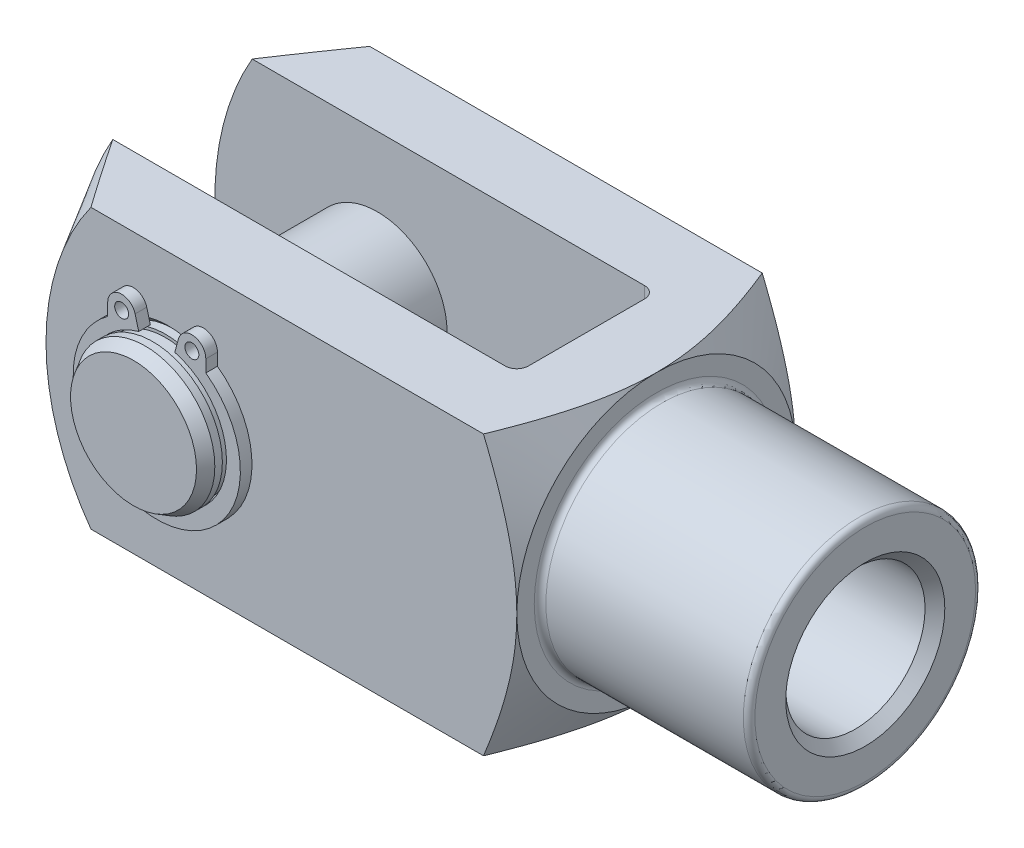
ISO-10303-21;
HEADER;
FILE_DESCRIPTION(('STEP AP214'),'2;1');
FILE_NAME('part.step','',(''),(''),'','','');
FILE_SCHEMA(('AUTOMOTIVE_DESIGN { 1 0 10303 214 1 1 1 1 }'));
ENDSEC;
DATA;
#1=APPLICATION_CONTEXT('core data for automotive mechanical design processes');
#2=APPLICATION_PROTOCOL_DEFINITION('international standard','automotive_design',2000,#1);
#3=PRODUCT_CONTEXT('',#1,'mechanical');
#4=PRODUCT('Part','Part','',(#3));
#5=PRODUCT_RELATED_PRODUCT_CATEGORY('part','',(#4));
#6=PRODUCT_DEFINITION_FORMATION('','',#4);
#7=PRODUCT_DEFINITION_CONTEXT('part definition',#1,'design');
#8=PRODUCT_DEFINITION('design','',#6,#7);
#9=PRODUCT_DEFINITION_SHAPE('','',#8);
#10=(LENGTH_UNIT() NAMED_UNIT(*) SI_UNIT(.MILLI.,.METRE.));
#11=(NAMED_UNIT(*) PLANE_ANGLE_UNIT() SI_UNIT($,.RADIAN.));
#12=(NAMED_UNIT(*) SI_UNIT($,.STERADIAN.) SOLID_ANGLE_UNIT());
#13=UNCERTAINTY_MEASURE_WITH_UNIT(LENGTH_MEASURE(1.E-05),#10,'distance_accuracy_value','');
#14=(GEOMETRIC_REPRESENTATION_CONTEXT(3) GLOBAL_UNCERTAINTY_ASSIGNED_CONTEXT((#13)) GLOBAL_UNIT_ASSIGNED_CONTEXT((#10,
#11,#12)) REPRESENTATION_CONTEXT('',''));
#15=CARTESIAN_POINT('',(0.,0.,0.));
#16=DIRECTION('',(0.,0.,1.));
#17=DIRECTION('',(1.,0.,0.));
#18=AXIS2_PLACEMENT_3D('',#15,#16,#17);
#19=CARTESIAN_POINT('',(-48.,0.,15.));
#20=DIRECTION('',(0.,0.,-1.));
#21=DIRECTION('',(-1.,0.,0.));
#22=AXIS2_PLACEMENT_3D('',#19,#20,#21);
#23=CYLINDRICAL_SURFACE('',#22,6.);
#24=CARTESIAN_POINT('',(-48.,0.,12.25));
#25=DIRECTION('',(0.,0.,1.));
#26=DIRECTION('',(1.,0.,0.));
#27=AXIS2_PLACEMENT_3D('',#24,#25,#26);
#28=CIRCLE('',#27,6.);
#29=CARTESIAN_POINT('',(-42.,0.,12.25));
#30=VERTEX_POINT('',#29);
#31=EDGE_CURVE('P0_E55',#30,#30,#28,.T.);
#32=ORIENTED_EDGE('',*,*,#31,.F.);
#33=EDGE_LOOP('',(#32));
#34=FACE_BOUND('',#33,.T.);
#35=CARTESIAN_POINT('',(-48.,0.,-12.25));
#36=DIRECTION('',(0.,0.,1.));
#37=DIRECTION('',(1.,0.,0.));
#38=AXIS2_PLACEMENT_3D('',#35,#36,#37);
#39=CIRCLE('',#38,6.);
#40=CARTESIAN_POINT('',(-42.,0.,-12.25));
#41=VERTEX_POINT('',#40);
#42=EDGE_CURVE('P0_E40',#41,#41,#39,.T.);
#43=ORIENTED_EDGE('',*,*,#42,.T.);
#44=EDGE_LOOP('',(#43));
#45=FACE_BOUND('',#44,.T.);
#46=ADVANCED_FACE('P0_F14',(#34,#45),#23,.T.);
#47=CARTESIAN_POINT('',(-48.,0.,-13.35));
#48=DIRECTION('',(0.,0.,1.));
#49=DIRECTION('',(1.,0.,0.));
#50=AXIS2_PLACEMENT_3D('',#47,#48,#49);
#51=CIRCLE('',#50,6.);
#52=CARTESIAN_POINT('',(-42.,0.,-13.35));
#53=VERTEX_POINT('',#52);
#54=EDGE_CURVE('P0_E43',#53,#53,#51,.T.);
#55=ORIENTED_EDGE('',*,*,#54,.F.);
#56=EDGE_LOOP('',(#55));
#57=FACE_BOUND('',#56,.T.);
#58=CARTESIAN_POINT('',(-48.,0.,-14.));
#59=DIRECTION('',(0.,0.,1.));
#60=DIRECTION('',(1.,0.,0.));
#61=AXIS2_PLACEMENT_3D('',#58,#59,#60);
#62=CIRCLE('',#61,6.);
#63=CARTESIAN_POINT('',(-42.,0.,-14.));
#64=VERTEX_POINT('',#63);
#65=EDGE_CURVE('P0_E25',#64,#64,#62,.T.);
#66=ORIENTED_EDGE('',*,*,#65,.T.);
#67=EDGE_LOOP('',(#66));
#68=FACE_BOUND('',#67,.T.);
#69=ADVANCED_FACE('P0_F63',(#57,#68),#23,.T.);
#70=CARTESIAN_POINT('',(-48.,0.,-15.));
#71=DIRECTION('',(0.,0.,1.));
#72=DIRECTION('',(1.,0.,0.));
#73=AXIS2_PLACEMENT_3D('',#70,#71,#72);
#74=PLANE('',#73);
#75=CARTESIAN_POINT('',(-48.,0.,-15.));
#76=DIRECTION('',(0.,0.,1.));
#77=DIRECTION('',(1.,0.,0.));
#78=AXIS2_PLACEMENT_3D('',#75,#76,#77);
#79=CIRCLE('',#78,5.42264973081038);
#80=CARTESIAN_POINT('',(-42.5773502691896,0.,-15.));
#81=VERTEX_POINT('',#80);
#82=EDGE_CURVE('P0_E21',#81,#81,#79,.F.);
#83=ORIENTED_EDGE('',*,*,#82,.T.);
#84=EDGE_LOOP('',(#83));
#85=FACE_BOUND('',#84,.T.);
#86=ADVANCED_FACE('P0_F89',(#85),#74,.F.);
#87=CARTESIAN_POINT('',(-48.,0.,-14.));
#88=DIRECTION('',(0.,0.,1.));
#89=DIRECTION('',(1.,0.,0.));
#90=AXIS2_PLACEMENT_3D('',#87,#88,#89);
#91=CONICAL_SURFACE('',#90,6.,0.523598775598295);
#92=ORIENTED_EDGE('',*,*,#82,.F.);
#93=EDGE_LOOP('',(#92));
#94=FACE_BOUND('',#93,.T.);
#95=ORIENTED_EDGE('',*,*,#65,.F.);
#96=EDGE_LOOP('',(#95));
#97=FACE_BOUND('',#96,.T.);
#98=ADVANCED_FACE('P0_F83',(#94,#97),#91,.T.);
#99=CARTESIAN_POINT('',(-48.,6.,-13.35));
#100=DIRECTION('',(0.,0.,-1.));
#101=DIRECTION('',(-1.,0.,0.));
#102=AXIS2_PLACEMENT_3D('',#99,#100,#101);
#103=PLANE('',#102);
#104=CARTESIAN_POINT('',(-48.,0.,-13.35));
#105=DIRECTION('',(0.,0.,1.));
#106=DIRECTION('',(1.,0.,0.));
#107=AXIS2_PLACEMENT_3D('',#104,#105,#106);
#108=CIRCLE('',#107,5.75);
#109=CARTESIAN_POINT('',(-42.25,0.,-13.35));
#110=VERTEX_POINT('',#109);
#111=EDGE_CURVE('P0_E34',#110,#110,#108,.T.);
#112=ORIENTED_EDGE('',*,*,#111,.F.);
#113=EDGE_LOOP('',(#112));
#114=FACE_BOUND('',#113,.T.);
#115=ORIENTED_EDGE('',*,*,#54,.T.);
#116=EDGE_LOOP('',(#115));
#117=FACE_BOUND('',#116,.T.);
#118=ADVANCED_FACE('P0_F77',(#114,#117),#103,.F.);
#119=CARTESIAN_POINT('',(-48.,0.,14.));
#120=DIRECTION('',(0.,0.,1.));
#121=DIRECTION('',(1.,0.,0.));
#122=AXIS2_PLACEMENT_3D('',#119,#120,#121);
#123=CYLINDRICAL_SURFACE('',#122,5.75);
#124=CARTESIAN_POINT('',(-48.,0.,-12.25));
#125=DIRECTION('',(0.,0.,1.));
#126=DIRECTION('',(1.,0.,0.));
#127=AXIS2_PLACEMENT_3D('',#124,#125,#126);
#128=CIRCLE('',#127,5.75);
#129=CARTESIAN_POINT('',(-42.25,0.,-12.25));
#130=VERTEX_POINT('',#129);
#131=EDGE_CURVE('P0_E37',#130,#130,#128,.T.);
#132=ORIENTED_EDGE('',*,*,#131,.F.);
#133=EDGE_LOOP('',(#132));
#134=FACE_BOUND('',#133,.T.);
#135=ORIENTED_EDGE('',*,*,#111,.T.);
#136=EDGE_LOOP('',(#135));
#137=FACE_BOUND('',#136,.T.);
#138=ADVANCED_FACE('P0_F71',(#134,#137),#123,.T.);
#139=CARTESIAN_POINT('',(-48.,6.,-12.25));
#140=DIRECTION('',(0.,0.,1.));
#141=DIRECTION('',(1.,0.,0.));
#142=AXIS2_PLACEMENT_3D('',#139,#140,#141);
#143=PLANE('',#142);
#144=ORIENTED_EDGE('',*,*,#42,.F.);
#145=EDGE_LOOP('',(#144));
#146=FACE_BOUND('',#145,.T.);
#147=ORIENTED_EDGE('',*,*,#131,.T.);
#148=EDGE_LOOP('',(#147));
#149=FACE_BOUND('',#148,.T.);
#150=ADVANCED_FACE('P0_F68',(#146,#149),#143,.F.);
#151=CARTESIAN_POINT('',(-48.,6.,12.25));
#152=DIRECTION('',(0.,0.,-1.));
#153=DIRECTION('',(-1.,0.,0.));
#154=AXIS2_PLACEMENT_3D('',#151,#152,#153);
#155=PLANE('',#154);
#156=CARTESIAN_POINT('',(-48.,0.,12.25));
#157=DIRECTION('',(0.,0.,1.));
#158=DIRECTION('',(1.,0.,0.));
#159=AXIS2_PLACEMENT_3D('',#156,#157,#158);
#160=CIRCLE('',#159,5.75);
#161=CARTESIAN_POINT('',(-42.25,0.,12.25));
#162=VERTEX_POINT('',#161);
#163=EDGE_CURVE('P0_E46',#162,#162,#160,.T.);
#164=ORIENTED_EDGE('',*,*,#163,.F.);
#165=EDGE_LOOP('',(#164));
#166=FACE_BOUND('',#165,.T.);
#167=ORIENTED_EDGE('',*,*,#31,.T.);
#168=EDGE_LOOP('',(#167));
#169=FACE_BOUND('',#168,.T.);
#170=ADVANCED_FACE('P0_F59',(#166,#169),#155,.F.);
#171=CARTESIAN_POINT('',(-48.,0.,14.));
#172=DIRECTION('',(0.,0.,1.));
#173=DIRECTION('',(1.,0.,0.));
#174=AXIS2_PLACEMENT_3D('',#171,#172,#173);
#175=CYLINDRICAL_SURFACE('',#174,5.75);
#176=CARTESIAN_POINT('',(-48.,0.,13.35));
#177=DIRECTION('',(0.,0.,1.));
#178=DIRECTION('',(1.,0.,0.));
#179=AXIS2_PLACEMENT_3D('',#176,#177,#178);
#180=CIRCLE('',#179,5.75);
#181=CARTESIAN_POINT('',(-42.25,0.,13.35));
#182=VERTEX_POINT('',#181);
#183=EDGE_CURVE('P0_E49',#182,#182,#180,.T.);
#184=ORIENTED_EDGE('',*,*,#183,.F.);
#185=EDGE_LOOP('',(#184));
#186=FACE_BOUND('',#185,.T.);
#187=ORIENTED_EDGE('',*,*,#163,.T.);
#188=EDGE_LOOP('',(#187));
#189=FACE_BOUND('',#188,.T.);
#190=ADVANCED_FACE('P0_F108',(#186,#189),#175,.T.);
#191=CARTESIAN_POINT('',(-48.,6.,13.35));
#192=DIRECTION('',(0.,0.,1.));
#193=DIRECTION('',(1.,0.,0.));
#194=AXIS2_PLACEMENT_3D('',#191,#192,#193);
#195=PLANE('',#194);
#196=CARTESIAN_POINT('',(-48.,0.,13.35));
#197=DIRECTION('',(0.,0.,1.));
#198=DIRECTION('',(1.,0.,0.));
#199=AXIS2_PLACEMENT_3D('',#196,#197,#198);
#200=CIRCLE('',#199,6.);
#201=CARTESIAN_POINT('',(-42.,0.,13.35));
#202=VERTEX_POINT('',#201);
#203=EDGE_CURVE('P0_E52',#202,#202,#200,.T.);
#204=ORIENTED_EDGE('',*,*,#203,.F.);
#205=EDGE_LOOP('',(#204));
#206=FACE_BOUND('',#205,.T.);
#207=ORIENTED_EDGE('',*,*,#183,.T.);
#208=EDGE_LOOP('',(#207));
#209=FACE_BOUND('',#208,.T.);
#210=ADVANCED_FACE('P0_F104',(#206,#209),#195,.F.);
#211=CARTESIAN_POINT('',(-48.,0.,15.));
#212=DIRECTION('',(0.,0.,1.));
#213=DIRECTION('',(1.,0.,0.));
#214=AXIS2_PLACEMENT_3D('',#211,#212,#213);
#215=PLANE('',#214);
#216=CARTESIAN_POINT('',(-48.,0.,15.));
#217=DIRECTION('',(0.,0.,1.));
#218=DIRECTION('',(1.,0.,0.));
#219=AXIS2_PLACEMENT_3D('',#216,#217,#218);
#220=CIRCLE('',#219,5.42264973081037);
#221=CARTESIAN_POINT('',(-42.5773502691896,0.,15.));
#222=VERTEX_POINT('',#221);
#223=EDGE_CURVE('P0_E10',#222,#222,#220,.T.);
#224=ORIENTED_EDGE('',*,*,#223,.T.);
#225=EDGE_LOOP('',(#224));
#226=FACE_BOUND('',#225,.T.);
#227=ADVANCED_FACE('P0_F102',(#226),#215,.T.);
#228=CARTESIAN_POINT('',(-48.,0.,15.));
#229=DIRECTION('',(0.,0.,-1.));
#230=DIRECTION('',(-1.,0.,0.));
#231=AXIS2_PLACEMENT_3D('',#228,#229,#230);
#232=CONICAL_SURFACE('',#231,5.42264973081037,0.523598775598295);
#233=CARTESIAN_POINT('',(-48.,0.,14.));
#234=DIRECTION('',(0.,0.,1.));
#235=DIRECTION('',(1.,0.,0.));
#236=AXIS2_PLACEMENT_3D('',#233,#234,#235);
#237=CIRCLE('',#236,6.);
#238=CARTESIAN_POINT('',(-42.,0.,14.));
#239=VERTEX_POINT('',#238);
#240=EDGE_CURVE('P0_E29',#239,#239,#237,.F.);
#241=ORIENTED_EDGE('',*,*,#240,.F.);
#242=EDGE_LOOP('',(#241));
#243=FACE_BOUND('',#242,.T.);
#244=ORIENTED_EDGE('',*,*,#223,.F.);
#245=EDGE_LOOP('',(#244));
#246=FACE_BOUND('',#245,.T.);
#247=ADVANCED_FACE('P0_F16',(#243,#246),#232,.T.);
#248=ORIENTED_EDGE('',*,*,#203,.T.);
#249=EDGE_LOOP('',(#248));
#250=FACE_BOUND('',#249,.T.);
#251=ORIENTED_EDGE('',*,*,#240,.T.);
#252=EDGE_LOOP('',(#251));
#253=FACE_BOUND('',#252,.T.);
#254=ADVANCED_FACE('P0_F65',(#250,#253),#23,.T.);
#255=CLOSED_SHELL('',(#46,#69,#86,#98,#118,#138,#150,#170,#190,#210,#227,#247,#254));
#256=MANIFOLD_SOLID_BREP('P0_B1',#255);
#257=CARTESIAN_POINT('',(-48.,0.,12.9999999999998));
#258=DIRECTION('',(0.,0.,1.));
#259=DIRECTION('',(1.,0.,0.));
#260=AXIS2_PLACEMENT_3D('',#257,#258,#259);
#261=PLANE('',#260);
#262=CARTESIAN_POINT('',(-51.0226081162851,6.64408309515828,12.9999999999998));
#263=DIRECTION('',(0.,0.,1.));
#264=DIRECTION('',(1.,0.,0.));
#265=AXIS2_PLACEMENT_3D('',#262,#263,#264);
#266=CIRCLE('',#265,0.6);
#267=CARTESIAN_POINT('',(-50.4226081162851,6.64408309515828,12.9999999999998));
#268=VERTEX_POINT('',#267);
#269=EDGE_CURVE('P1_E117',#268,#268,#266,.T.);
#270=ORIENTED_EDGE('',*,*,#269,.F.);
#271=EDGE_LOOP('',(#270));
#272=FACE_BOUND('',#271,.T.);
#273=CARTESIAN_POINT('',(-48.,0.,12.9999999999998));
#274=DIRECTION('',(0.,0.,-1.));
#275=DIRECTION('',(1.,0.,0.));
#276=AXIS2_PLACEMENT_3D('',#273,#274,#275);
#277=CIRCLE('',#276,6.);
#278=CARTESIAN_POINT('',(-46.4470857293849,5.79555495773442,12.9999999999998));
#279=VERTEX_POINT('',#278);
#280=CARTESIAN_POINT('',(-49.5529142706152,5.79555495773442,12.9999999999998));
#281=VERTEX_POINT('',#280);
#282=EDGE_CURVE('P1_E128',#279,#281,#277,.T.);
#283=ORIENTED_EDGE('',*,*,#282,.T.);
#284=DIRECTION('',(-0.258819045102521,0.965925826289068,0.));
#285=VECTOR('',#284,1.);
#286=CARTESIAN_POINT('',(-49.5529142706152,5.79555495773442,12.9999999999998));
#287=LINE('',#286,#285);
#288=CARTESIAN_POINT('',(-49.8634971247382,6.9546659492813,12.9999999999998));
#289=VERTEX_POINT('',#288);
#290=EDGE_CURVE('P1_E76',#281,#289,#287,.T.);
#291=ORIENTED_EDGE('',*,*,#290,.T.);
#292=CARTESIAN_POINT('',(-51.0226081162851,6.64408309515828,12.9999999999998));
#293=DIRECTION('',(0.,0.,1.));
#294=DIRECTION('',(1.,0.,0.));
#295=AXIS2_PLACEMENT_3D('',#292,#293,#294);
#296=CIRCLE('',#295,1.2);
#297=CARTESIAN_POINT('',(-52.2226081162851,6.64408309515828,12.9999999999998));
#298=VERTEX_POINT('',#297);
#299=EDGE_CURVE('P1_E143',#289,#298,#296,.T.);
#300=ORIENTED_EDGE('',*,*,#299,.T.);
#301=DIRECTION('',(0.,-1.,0.));
#302=VECTOR('',#301,1.);
#303=CARTESIAN_POINT('',(-52.2226081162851,6.64408309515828,12.9999999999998));
#304=LINE('',#303,#302);
#305=CARTESIAN_POINT('',(-52.2226081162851,5.59177337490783,12.9999999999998));
#306=VERTEX_POINT('',#305);
#307=EDGE_CURVE('P1_E156',#298,#306,#304,.T.);
#308=ORIENTED_EDGE('',*,*,#307,.T.);
#309=CARTESIAN_POINT('',(-48.,-0.239999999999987,12.9999999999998));
#310=DIRECTION('',(0.,0.,1.));
#311=DIRECTION('',(1.,0.,0.));
#312=AXIS2_PLACEMENT_3D('',#309,#310,#311);
#313=CIRCLE('',#312,7.2);
#314=CARTESIAN_POINT('',(-43.777391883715,5.59177337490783,12.9999999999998));
#315=VERTEX_POINT('',#314);
#316=EDGE_CURVE('P1_E95',#306,#315,#313,.T.);
#317=ORIENTED_EDGE('',*,*,#316,.T.);
#318=DIRECTION('',(0.,1.,0.));
#319=VECTOR('',#318,1.);
#320=CARTESIAN_POINT('',(-43.777391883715,6.64408309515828,12.9999999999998));
#321=LINE('',#320,#319);
#322=CARTESIAN_POINT('',(-43.777391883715,6.64408309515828,12.9999999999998));
#323=VERTEX_POINT('',#322);
#324=EDGE_CURVE('P1_E89',#315,#323,#321,.T.);
#325=ORIENTED_EDGE('',*,*,#324,.T.);
#326=CARTESIAN_POINT('',(-44.977391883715,6.64408309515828,12.9999999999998));
#327=DIRECTION('',(0.,0.,1.));
#328=DIRECTION('',(-1.,0.,0.));
#329=AXIS2_PLACEMENT_3D('',#326,#327,#328);
#330=CIRCLE('',#329,1.2);
#331=CARTESIAN_POINT('',(-46.1365028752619,6.9546659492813,12.9999999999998));
#332=VERTEX_POINT('',#331);
#333=EDGE_CURVE('P1_E93',#323,#332,#330,.T.);
#334=ORIENTED_EDGE('',*,*,#333,.T.);
#335=DIRECTION('',(-0.258819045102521,-0.965925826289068,0.));
#336=VECTOR('',#335,1.);
#337=CARTESIAN_POINT('',(-46.4470857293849,5.79555495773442,12.9999999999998));
#338=LINE('',#337,#336);
#339=EDGE_CURVE('P1_E33',#332,#279,#338,.T.);
#340=ORIENTED_EDGE('',*,*,#339,.T.);
#341=EDGE_LOOP('',(#283,#291,#300,#308,#317,#325,#334,#340));
#342=FACE_BOUND('',#341,.T.);
#343=CARTESIAN_POINT('',(-44.977391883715,6.64408309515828,12.9999999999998));
#344=DIRECTION('',(0.,0.,1.));
#345=DIRECTION('',(-1.,0.,0.));
#346=AXIS2_PLACEMENT_3D('',#343,#344,#345);
#347=CIRCLE('',#346,0.6);
#348=CARTESIAN_POINT('',(-45.577391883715,6.64408309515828,12.9999999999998));
#349=VERTEX_POINT('',#348);
#350=EDGE_CURVE('P1_E165',#349,#349,#347,.T.);
#351=ORIENTED_EDGE('',*,*,#350,.F.);
#352=EDGE_LOOP('',(#351));
#353=FACE_BOUND('',#352,.T.);
#354=ADVANCED_FACE('P1_F16',(#272,#342,#353),#261,.T.);
#355=CARTESIAN_POINT('',(-48.,0.,11.9999999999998));
#356=DIRECTION('',(0.,0.,1.));
#357=DIRECTION('',(1.,0.,0.));
#358=AXIS2_PLACEMENT_3D('',#355,#356,#357);
#359=PLANE('',#358);
#360=CARTESIAN_POINT('',(-51.0226081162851,6.64408309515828,11.9999999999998));
#361=DIRECTION('',(0.,0.,1.));
#362=DIRECTION('',(1.,0.,0.));
#363=AXIS2_PLACEMENT_3D('',#360,#361,#362);
#364=CIRCLE('',#363,0.6);
#365=CARTESIAN_POINT('',(-50.4226081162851,6.64408309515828,11.9999999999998));
#366=VERTEX_POINT('',#365);
#367=EDGE_CURVE('P1_E162',#366,#366,#364,.T.);
#368=ORIENTED_EDGE('',*,*,#367,.T.);
#369=EDGE_LOOP('',(#368));
#370=FACE_BOUND('',#369,.T.);
#371=CARTESIAN_POINT('',(-48.,0.,11.9999999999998));
#372=DIRECTION('',(0.,0.,-1.));
#373=DIRECTION('',(1.,0.,0.));
#374=AXIS2_PLACEMENT_3D('',#371,#372,#373);
#375=CIRCLE('',#374,6.);
#376=CARTESIAN_POINT('',(-46.4470857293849,5.79555495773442,11.9999999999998));
#377=VERTEX_POINT('',#376);
#378=CARTESIAN_POINT('',(-49.5529142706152,5.79555495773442,11.9999999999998));
#379=VERTEX_POINT('',#378);
#380=EDGE_CURVE('P1_E113',#377,#379,#375,.T.);
#381=ORIENTED_EDGE('',*,*,#380,.F.);
#382=DIRECTION('',(-0.258819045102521,-0.965925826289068,0.));
#383=VECTOR('',#382,1.);
#384=CARTESIAN_POINT('',(-46.4470857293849,5.79555495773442,11.9999999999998));
#385=LINE('',#384,#383);
#386=CARTESIAN_POINT('',(-46.1365028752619,6.9546659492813,11.9999999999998));
#387=VERTEX_POINT('',#386);
#388=EDGE_CURVE('P1_E68',#387,#377,#385,.T.);
#389=ORIENTED_EDGE('',*,*,#388,.F.);
#390=CARTESIAN_POINT('',(-44.977391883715,6.64408309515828,11.9999999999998));
#391=DIRECTION('',(0.,0.,1.));
#392=DIRECTION('',(-1.,0.,0.));
#393=AXIS2_PLACEMENT_3D('',#390,#391,#392);
#394=CIRCLE('',#393,1.2);
#395=CARTESIAN_POINT('',(-43.777391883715,6.64408309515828,11.9999999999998));
#396=VERTEX_POINT('',#395);
#397=EDGE_CURVE('P1_E62',#396,#387,#394,.T.);
#398=ORIENTED_EDGE('',*,*,#397,.F.);
#399=DIRECTION('',(0.,1.,0.));
#400=VECTOR('',#399,1.);
#401=CARTESIAN_POINT('',(-43.777391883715,6.64408309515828,11.9999999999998));
#402=LINE('',#401,#400);
#403=CARTESIAN_POINT('',(-43.777391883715,5.59177337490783,11.9999999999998));
#404=VERTEX_POINT('',#403);
#405=EDGE_CURVE('P1_E103',#404,#396,#402,.T.);
#406=ORIENTED_EDGE('',*,*,#405,.F.);
#407=CARTESIAN_POINT('',(-48.,-0.239999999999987,11.9999999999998));
#408=DIRECTION('',(0.,0.,1.));
#409=DIRECTION('',(1.,0.,0.));
#410=AXIS2_PLACEMENT_3D('',#407,#408,#409);
#411=CIRCLE('',#410,7.2);
#412=CARTESIAN_POINT('',(-52.2226081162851,5.59177337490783,11.9999999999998));
#413=VERTEX_POINT('',#412);
#414=EDGE_CURVE('P1_E123',#413,#404,#411,.T.);
#415=ORIENTED_EDGE('',*,*,#414,.F.);
#416=DIRECTION('',(0.,-1.,0.));
#417=VECTOR('',#416,1.);
#418=CARTESIAN_POINT('',(-52.2226081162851,6.64408309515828,11.9999999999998));
#419=LINE('',#418,#417);
#420=CARTESIAN_POINT('',(-52.2226081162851,6.64408309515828,11.9999999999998));
#421=VERTEX_POINT('',#420);
#422=EDGE_CURVE('P1_E121',#421,#413,#419,.T.);
#423=ORIENTED_EDGE('',*,*,#422,.F.);
#424=CARTESIAN_POINT('',(-51.0226081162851,6.64408309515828,11.9999999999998));
#425=DIRECTION('',(0.,0.,1.));
#426=DIRECTION('',(1.,0.,0.));
#427=AXIS2_PLACEMENT_3D('',#424,#425,#426);
#428=CIRCLE('',#427,1.2);
#429=CARTESIAN_POINT('',(-49.8634971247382,6.9546659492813,11.9999999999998));
#430=VERTEX_POINT('',#429);
#431=EDGE_CURVE('P1_E119',#430,#421,#428,.T.);
#432=ORIENTED_EDGE('',*,*,#431,.F.);
#433=DIRECTION('',(-0.258819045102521,0.965925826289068,0.));
#434=VECTOR('',#433,1.);
#435=CARTESIAN_POINT('',(-49.5529142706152,5.79555495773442,11.9999999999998));
#436=LINE('',#435,#434);
#437=EDGE_CURVE('P1_E116',#379,#430,#436,.T.);
#438=ORIENTED_EDGE('',*,*,#437,.F.);
#439=EDGE_LOOP('',(#381,#389,#398,#406,#415,#423,#432,#438));
#440=FACE_BOUND('',#439,.T.);
#441=CARTESIAN_POINT('',(-44.977391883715,6.64408309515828,11.9999999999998));
#442=DIRECTION('',(0.,0.,1.));
#443=DIRECTION('',(-1.,0.,0.));
#444=AXIS2_PLACEMENT_3D('',#441,#442,#443);
#445=CIRCLE('',#444,0.6);
#446=CARTESIAN_POINT('',(-45.577391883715,6.64408309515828,11.9999999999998));
#447=VERTEX_POINT('',#446);
#448=EDGE_CURVE('P1_E168',#447,#447,#445,.T.);
#449=ORIENTED_EDGE('',*,*,#448,.T.);
#450=EDGE_LOOP('',(#449));
#451=FACE_BOUND('',#450,.T.);
#452=ADVANCED_FACE('P1_F147',(#370,#440,#451),#359,.F.);
#453=CARTESIAN_POINT('',(-48.,0.,12.9999999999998));
#454=DIRECTION('',(0.,0.,-1.));
#455=DIRECTION('',(-1.,0.,0.));
#456=AXIS2_PLACEMENT_3D('',#453,#454,#455);
#457=CYLINDRICAL_SURFACE('',#456,6.);
#458=ORIENTED_EDGE('',*,*,#380,.T.);
#459=DIRECTION('',(0.,0.,-1.));
#460=VECTOR('',#459,1.);
#461=CARTESIAN_POINT('',(-49.5529142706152,5.79555495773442,12.9999999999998));
#462=LINE('',#461,#460);
#463=EDGE_CURVE('P1_E11',#281,#379,#462,.T.);
#464=ORIENTED_EDGE('',*,*,#463,.F.);
#465=ORIENTED_EDGE('',*,*,#282,.F.);
#466=DIRECTION('',(0.,0.,-1.));
#467=VECTOR('',#466,1.);
#468=CARTESIAN_POINT('',(-46.4470857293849,5.79555495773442,12.9999999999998));
#469=LINE('',#468,#467);
#470=EDGE_CURVE('P1_E109',#279,#377,#469,.T.);
#471=ORIENTED_EDGE('',*,*,#470,.T.);
#472=EDGE_LOOP('',(#458,#464,#465,#471));
#473=FACE_BOUND('',#472,.T.);
#474=ADVANCED_FACE('P1_F18',(#473),#457,.F.);
#475=CARTESIAN_POINT('',(-49.5529142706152,5.79555495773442,12.9999999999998));
#476=DIRECTION('',(-0.965925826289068,-0.258819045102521,0.));
#477=DIRECTION('',(0.258819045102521,-0.965925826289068,0.));
#478=AXIS2_PLACEMENT_3D('',#475,#476,#477);
#479=PLANE('',#478);
#480=ORIENTED_EDGE('',*,*,#437,.T.);
#481=DIRECTION('',(0.,0.,-1.));
#482=VECTOR('',#481,1.);
#483=CARTESIAN_POINT('',(-49.8634971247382,6.9546659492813,12.9999999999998));
#484=LINE('',#483,#482);
#485=EDGE_CURVE('P1_E25',#289,#430,#484,.T.);
#486=ORIENTED_EDGE('',*,*,#485,.F.);
#487=ORIENTED_EDGE('',*,*,#290,.F.);
#488=ORIENTED_EDGE('',*,*,#463,.T.);
#489=EDGE_LOOP('',(#480,#486,#487,#488));
#490=FACE_BOUND('',#489,.T.);
#491=ADVANCED_FACE('P1_F202',(#490),#479,.F.);
#492=CARTESIAN_POINT('',(-51.0226081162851,6.64408309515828,12.9999999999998));
#493=DIRECTION('',(0.,0.,-1.));
#494=DIRECTION('',(-1.,0.,0.));
#495=AXIS2_PLACEMENT_3D('',#492,#493,#494);
#496=CYLINDRICAL_SURFACE('',#495,1.2);
#497=ORIENTED_EDGE('',*,*,#431,.T.);
#498=DIRECTION('',(0.,0.,-1.));
#499=VECTOR('',#498,1.);
#500=CARTESIAN_POINT('',(-52.2226081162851,6.64408309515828,12.9999999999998));
#501=LINE('',#500,#499);
#502=EDGE_CURVE('P1_E135',#298,#421,#501,.T.);
#503=ORIENTED_EDGE('',*,*,#502,.F.);
#504=ORIENTED_EDGE('',*,*,#299,.F.);
#505=ORIENTED_EDGE('',*,*,#485,.T.);
#506=EDGE_LOOP('',(#497,#503,#504,#505));
#507=FACE_BOUND('',#506,.T.);
#508=ADVANCED_FACE('P1_F141',(#507),#496,.T.);
#509=CARTESIAN_POINT('',(-52.2226081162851,6.64408309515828,12.9999999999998));
#510=DIRECTION('',(1.,0.,0.));
#511=DIRECTION('',(0.,1.,0.));
#512=AXIS2_PLACEMENT_3D('',#509,#510,#511);
#513=PLANE('',#512);
#514=ORIENTED_EDGE('',*,*,#422,.T.);
#515=DIRECTION('',(0.,0.,-1.));
#516=VECTOR('',#515,1.);
#517=CARTESIAN_POINT('',(-52.2226081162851,5.59177337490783,12.9999999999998));
#518=LINE('',#517,#516);
#519=EDGE_CURVE('P1_E132',#306,#413,#518,.T.);
#520=ORIENTED_EDGE('',*,*,#519,.F.);
#521=ORIENTED_EDGE('',*,*,#307,.F.);
#522=ORIENTED_EDGE('',*,*,#502,.T.);
#523=EDGE_LOOP('',(#514,#520,#521,#522));
#524=FACE_BOUND('',#523,.T.);
#525=ADVANCED_FACE('P1_F152',(#524),#513,.F.);
#526=CARTESIAN_POINT('',(-48.,-0.239999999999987,12.9999999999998));
#527=DIRECTION('',(0.,0.,-1.));
#528=DIRECTION('',(-1.,0.,0.));
#529=AXIS2_PLACEMENT_3D('',#526,#527,#528);
#530=CYLINDRICAL_SURFACE('',#529,7.2);
#531=ORIENTED_EDGE('',*,*,#414,.T.);
#532=DIRECTION('',(0.,0.,-1.));
#533=VECTOR('',#532,1.);
#534=CARTESIAN_POINT('',(-43.777391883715,5.59177337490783,12.9999999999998));
#535=LINE('',#534,#533);
#536=EDGE_CURVE('P1_E104',#315,#404,#535,.T.);
#537=ORIENTED_EDGE('',*,*,#536,.F.);
#538=ORIENTED_EDGE('',*,*,#316,.F.);
#539=ORIENTED_EDGE('',*,*,#519,.T.);
#540=EDGE_LOOP('',(#531,#537,#538,#539));
#541=FACE_BOUND('',#540,.T.);
#542=ADVANCED_FACE('P1_F155',(#541),#530,.T.);
#543=CARTESIAN_POINT('',(-43.777391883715,6.64408309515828,12.9999999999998));
#544=DIRECTION('',(-1.,0.,0.));
#545=DIRECTION('',(0.,-1.,0.));
#546=AXIS2_PLACEMENT_3D('',#543,#544,#545);
#547=PLANE('',#546);
#548=ORIENTED_EDGE('',*,*,#405,.T.);
#549=DIRECTION('',(0.,0.,-1.));
#550=VECTOR('',#549,1.);
#551=CARTESIAN_POINT('',(-43.777391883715,6.64408309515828,12.9999999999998));
#552=LINE('',#551,#550);
#553=EDGE_CURVE('P1_E100',#323,#396,#552,.T.);
#554=ORIENTED_EDGE('',*,*,#553,.F.);
#555=ORIENTED_EDGE('',*,*,#324,.F.);
#556=ORIENTED_EDGE('',*,*,#536,.T.);
#557=EDGE_LOOP('',(#548,#554,#555,#556));
#558=FACE_BOUND('',#557,.T.);
#559=ADVANCED_FACE('P1_F101',(#558),#547,.F.);
#560=CARTESIAN_POINT('',(-44.977391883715,6.64408309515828,12.9999999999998));
#561=DIRECTION('',(0.,0.,-1.));
#562=DIRECTION('',(-1.,0.,0.));
#563=AXIS2_PLACEMENT_3D('',#560,#561,#562);
#564=CYLINDRICAL_SURFACE('',#563,1.2);
#565=ORIENTED_EDGE('',*,*,#397,.T.);
#566=DIRECTION('',(0.,0.,-1.));
#567=VECTOR('',#566,1.);
#568=CARTESIAN_POINT('',(-46.1365028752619,6.9546659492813,12.9999999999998));
#569=LINE('',#568,#567);
#570=EDGE_CURVE('P1_E105',#332,#387,#569,.T.);
#571=ORIENTED_EDGE('',*,*,#570,.F.);
#572=ORIENTED_EDGE('',*,*,#333,.F.);
#573=ORIENTED_EDGE('',*,*,#553,.T.);
#574=EDGE_LOOP('',(#565,#571,#572,#573));
#575=FACE_BOUND('',#574,.T.);
#576=ADVANCED_FACE('P1_F107',(#575),#564,.T.);
#577=CARTESIAN_POINT('',(-46.4470857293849,5.79555495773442,12.9999999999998));
#578=DIRECTION('',(0.965925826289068,-0.258819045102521,0.));
#579=DIRECTION('',(0.258819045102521,0.965925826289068,0.));
#580=AXIS2_PLACEMENT_3D('',#577,#578,#579);
#581=PLANE('',#580);
#582=ORIENTED_EDGE('',*,*,#388,.T.);
#583=ORIENTED_EDGE('',*,*,#470,.F.);
#584=ORIENTED_EDGE('',*,*,#339,.F.);
#585=ORIENTED_EDGE('',*,*,#570,.T.);
#586=EDGE_LOOP('',(#582,#583,#584,#585));
#587=FACE_BOUND('',#586,.T.);
#588=ADVANCED_FACE('P1_F190',(#587),#581,.F.);
#589=CARTESIAN_POINT('',(-51.0226081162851,6.64408309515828,12.9999999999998));
#590=DIRECTION('',(0.,0.,-1.));
#591=DIRECTION('',(-1.,0.,0.));
#592=AXIS2_PLACEMENT_3D('',#589,#590,#591);
#593=CYLINDRICAL_SURFACE('',#592,0.6);
#594=ORIENTED_EDGE('',*,*,#269,.T.);
#595=EDGE_LOOP('',(#594));
#596=FACE_BOUND('',#595,.T.);
#597=ORIENTED_EDGE('',*,*,#367,.F.);
#598=EDGE_LOOP('',(#597));
#599=FACE_BOUND('',#598,.T.);
#600=ADVANCED_FACE('P1_F187',(#596,#599),#593,.F.);
#601=CARTESIAN_POINT('',(-44.977391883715,6.64408309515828,12.9999999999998));
#602=DIRECTION('',(0.,0.,-1.));
#603=DIRECTION('',(-1.,0.,0.));
#604=AXIS2_PLACEMENT_3D('',#601,#602,#603);
#605=CYLINDRICAL_SURFACE('',#604,0.6);
#606=ORIENTED_EDGE('',*,*,#350,.T.);
#607=EDGE_LOOP('',(#606));
#608=FACE_BOUND('',#607,.T.);
#609=ORIENTED_EDGE('',*,*,#448,.F.);
#610=EDGE_LOOP('',(#609));
#611=FACE_BOUND('',#610,.T.);
#612=ADVANCED_FACE('P1_F174',(#608,#611),#605,.F.);
#613=CLOSED_SHELL('',(#354,#452,#474,#491,#508,#525,#542,#559,#576,#588,#600,#612));
#614=MANIFOLD_SOLID_BREP('P1_B1',#613);
#615=CARTESIAN_POINT('',(-48.,0.,-12.9999999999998));
#616=DIRECTION('',(0.,0.,-1.));
#617=DIRECTION('',(-1.,0.,0.));
#618=AXIS2_PLACEMENT_3D('',#615,#616,#617);
#619=PLANE('',#618);
#620=CARTESIAN_POINT('',(-44.977391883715,6.64408309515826,-12.9999999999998));
#621=DIRECTION('',(0.,0.,-1.));
#622=DIRECTION('',(-1.,0.,0.));
#623=AXIS2_PLACEMENT_3D('',#620,#621,#622);
#624=CIRCLE('',#623,0.6);
#625=CARTESIAN_POINT('',(-45.577391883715,6.64408309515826,-12.9999999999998));
#626=VERTEX_POINT('',#625);
#627=EDGE_CURVE('P2_E117',#626,#626,#624,.T.);
#628=ORIENTED_EDGE('',*,*,#627,.F.);
#629=EDGE_LOOP('',(#628));
#630=FACE_BOUND('',#629,.T.);
#631=CARTESIAN_POINT('',(-48.,0.,-12.9999999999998));
#632=DIRECTION('',(0.,0.,1.));
#633=DIRECTION('',(-1.,0.,0.));
#634=AXIS2_PLACEMENT_3D('',#631,#632,#633);
#635=CIRCLE('',#634,6.);
#636=CARTESIAN_POINT('',(-49.5529142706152,5.7955549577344,-12.9999999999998));
#637=VERTEX_POINT('',#636);
#638=CARTESIAN_POINT('',(-46.4470857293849,5.7955549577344,-12.9999999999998));
#639=VERTEX_POINT('',#638);
#640=EDGE_CURVE('P2_E128',#637,#639,#635,.T.);
#641=ORIENTED_EDGE('',*,*,#640,.T.);
#642=DIRECTION('',(0.258819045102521,0.965925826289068,0.));
#643=VECTOR('',#642,1.);
#644=CARTESIAN_POINT('',(-46.4470857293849,5.7955549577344,-12.9999999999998));
#645=LINE('',#644,#643);
#646=CARTESIAN_POINT('',(-46.1365028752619,6.95466594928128,-12.9999999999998));
#647=VERTEX_POINT('',#646);
#648=EDGE_CURVE('P2_E76',#639,#647,#645,.T.);
#649=ORIENTED_EDGE('',*,*,#648,.T.);
#650=CARTESIAN_POINT('',(-44.977391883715,6.64408309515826,-12.9999999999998));
#651=DIRECTION('',(0.,0.,-1.));
#652=DIRECTION('',(-1.,0.,0.));
#653=AXIS2_PLACEMENT_3D('',#650,#651,#652);
#654=CIRCLE('',#653,1.2);
#655=CARTESIAN_POINT('',(-43.777391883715,6.64408309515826,-12.9999999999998));
#656=VERTEX_POINT('',#655);
#657=EDGE_CURVE('P2_E143',#647,#656,#654,.T.);
#658=ORIENTED_EDGE('',*,*,#657,.T.);
#659=DIRECTION('',(0.,-1.,0.));
#660=VECTOR('',#659,1.);
#661=CARTESIAN_POINT('',(-43.777391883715,6.64408309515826,-12.9999999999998));
#662=LINE('',#661,#660);
#663=CARTESIAN_POINT('',(-43.777391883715,5.59177337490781,-12.9999999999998));
#664=VERTEX_POINT('',#663);
#665=EDGE_CURVE('P2_E156',#656,#664,#662,.T.);
#666=ORIENTED_EDGE('',*,*,#665,.T.);
#667=CARTESIAN_POINT('',(-48.,-0.240000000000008,-12.9999999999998));
#668=DIRECTION('',(0.,0.,-1.));
#669=DIRECTION('',(-1.,0.,0.));
#670=AXIS2_PLACEMENT_3D('',#667,#668,#669);
#671=CIRCLE('',#670,7.2);
#672=CARTESIAN_POINT('',(-52.2226081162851,5.59177337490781,-12.9999999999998));
#673=VERTEX_POINT('',#672);
#674=EDGE_CURVE('P2_E95',#664,#673,#671,.T.);
#675=ORIENTED_EDGE('',*,*,#674,.T.);
#676=DIRECTION('',(0.,1.,0.));
#677=VECTOR('',#676,1.);
#678=CARTESIAN_POINT('',(-52.2226081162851,6.64408309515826,-12.9999999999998));
#679=LINE('',#678,#677);
#680=CARTESIAN_POINT('',(-52.2226081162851,6.64408309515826,-12.9999999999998));
#681=VERTEX_POINT('',#680);
#682=EDGE_CURVE('P2_E89',#673,#681,#679,.T.);
#683=ORIENTED_EDGE('',*,*,#682,.T.);
#684=CARTESIAN_POINT('',(-51.0226081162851,6.64408309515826,-12.9999999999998));
#685=DIRECTION('',(0.,0.,-1.));
#686=DIRECTION('',(1.,0.,0.));
#687=AXIS2_PLACEMENT_3D('',#684,#685,#686);
#688=CIRCLE('',#687,1.2);
#689=CARTESIAN_POINT('',(-49.8634971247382,6.95466594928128,-12.9999999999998));
#690=VERTEX_POINT('',#689);
#691=EDGE_CURVE('P2_E93',#681,#690,#688,.T.);
#692=ORIENTED_EDGE('',*,*,#691,.T.);
#693=DIRECTION('',(0.258819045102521,-0.965925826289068,0.));
#694=VECTOR('',#693,1.);
#695=CARTESIAN_POINT('',(-49.5529142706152,5.7955549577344,-12.9999999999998));
#696=LINE('',#695,#694);
#697=EDGE_CURVE('P2_E33',#690,#637,#696,.T.);
#698=ORIENTED_EDGE('',*,*,#697,.T.);
#699=EDGE_LOOP('',(#641,#649,#658,#666,#675,#683,#692,#698));
#700=FACE_BOUND('',#699,.T.);
#701=CARTESIAN_POINT('',(-51.0226081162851,6.64408309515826,-12.9999999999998));
#702=DIRECTION('',(0.,0.,-1.));
#703=DIRECTION('',(1.,0.,0.));
#704=AXIS2_PLACEMENT_3D('',#701,#702,#703);
#705=CIRCLE('',#704,0.6);
#706=CARTESIAN_POINT('',(-50.4226081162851,6.64408309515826,-12.9999999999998));
#707=VERTEX_POINT('',#706);
#708=EDGE_CURVE('P2_E165',#707,#707,#705,.T.);
#709=ORIENTED_EDGE('',*,*,#708,.F.);
#710=EDGE_LOOP('',(#709));
#711=FACE_BOUND('',#710,.T.);
#712=ADVANCED_FACE('P2_F16',(#630,#700,#711),#619,.T.);
#713=CARTESIAN_POINT('',(-48.,0.,-11.9999999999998));
#714=DIRECTION('',(0.,0.,-1.));
#715=DIRECTION('',(-1.,0.,0.));
#716=AXIS2_PLACEMENT_3D('',#713,#714,#715);
#717=PLANE('',#716);
#718=CARTESIAN_POINT('',(-44.977391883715,6.64408309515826,-11.9999999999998));
#719=DIRECTION('',(0.,0.,-1.));
#720=DIRECTION('',(-1.,0.,0.));
#721=AXIS2_PLACEMENT_3D('',#718,#719,#720);
#722=CIRCLE('',#721,0.6);
#723=CARTESIAN_POINT('',(-45.577391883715,6.64408309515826,-11.9999999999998));
#724=VERTEX_POINT('',#723);
#725=EDGE_CURVE('P2_E162',#724,#724,#722,.T.);
#726=ORIENTED_EDGE('',*,*,#725,.T.);
#727=EDGE_LOOP('',(#726));
#728=FACE_BOUND('',#727,.T.);
#729=CARTESIAN_POINT('',(-48.,0.,-11.9999999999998));
#730=DIRECTION('',(0.,0.,1.));
#731=DIRECTION('',(-1.,0.,0.));
#732=AXIS2_PLACEMENT_3D('',#729,#730,#731);
#733=CIRCLE('',#732,6.);
#734=CARTESIAN_POINT('',(-49.5529142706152,5.7955549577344,-11.9999999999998));
#735=VERTEX_POINT('',#734);
#736=CARTESIAN_POINT('',(-46.4470857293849,5.7955549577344,-11.9999999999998));
#737=VERTEX_POINT('',#736);
#738=EDGE_CURVE('P2_E113',#735,#737,#733,.T.);
#739=ORIENTED_EDGE('',*,*,#738,.F.);
#740=DIRECTION('',(0.258819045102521,-0.965925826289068,0.));
#741=VECTOR('',#740,1.);
#742=CARTESIAN_POINT('',(-49.5529142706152,5.7955549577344,-11.9999999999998));
#743=LINE('',#742,#741);
#744=CARTESIAN_POINT('',(-49.8634971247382,6.95466594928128,-11.9999999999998));
#745=VERTEX_POINT('',#744);
#746=EDGE_CURVE('P2_E68',#745,#735,#743,.T.);
#747=ORIENTED_EDGE('',*,*,#746,.F.);
#748=CARTESIAN_POINT('',(-51.0226081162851,6.64408309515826,-11.9999999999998));
#749=DIRECTION('',(0.,0.,-1.));
#750=DIRECTION('',(1.,0.,0.));
#751=AXIS2_PLACEMENT_3D('',#748,#749,#750);
#752=CIRCLE('',#751,1.2);
#753=CARTESIAN_POINT('',(-52.2226081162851,6.64408309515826,-11.9999999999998));
#754=VERTEX_POINT('',#753);
#755=EDGE_CURVE('P2_E62',#754,#745,#752,.T.);
#756=ORIENTED_EDGE('',*,*,#755,.F.);
#757=DIRECTION('',(0.,1.,0.));
#758=VECTOR('',#757,1.);
#759=CARTESIAN_POINT('',(-52.2226081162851,6.64408309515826,-11.9999999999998));
#760=LINE('',#759,#758);
#761=CARTESIAN_POINT('',(-52.2226081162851,5.59177337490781,-11.9999999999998));
#762=VERTEX_POINT('',#761);
#763=EDGE_CURVE('P2_E103',#762,#754,#760,.T.);
#764=ORIENTED_EDGE('',*,*,#763,.F.);
#765=CARTESIAN_POINT('',(-48.,-0.240000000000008,-11.9999999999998));
#766=DIRECTION('',(0.,0.,-1.));
#767=DIRECTION('',(-1.,0.,0.));
#768=AXIS2_PLACEMENT_3D('',#765,#766,#767);
#769=CIRCLE('',#768,7.2);
#770=CARTESIAN_POINT('',(-43.777391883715,5.59177337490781,-11.9999999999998));
#771=VERTEX_POINT('',#770);
#772=EDGE_CURVE('P2_E123',#771,#762,#769,.T.);
#773=ORIENTED_EDGE('',*,*,#772,.F.);
#774=DIRECTION('',(0.,-1.,0.));
#775=VECTOR('',#774,1.);
#776=CARTESIAN_POINT('',(-43.777391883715,6.64408309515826,-11.9999999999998));
#777=LINE('',#776,#775);
#778=CARTESIAN_POINT('',(-43.777391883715,6.64408309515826,-11.9999999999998));
#779=VERTEX_POINT('',#778);
#780=EDGE_CURVE('P2_E121',#779,#771,#777,.T.);
#781=ORIENTED_EDGE('',*,*,#780,.F.);
#782=CARTESIAN_POINT('',(-44.977391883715,6.64408309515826,-11.9999999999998));
#783=DIRECTION('',(0.,0.,-1.));
#784=DIRECTION('',(-1.,0.,0.));
#785=AXIS2_PLACEMENT_3D('',#782,#783,#784);
#786=CIRCLE('',#785,1.2);
#787=CARTESIAN_POINT('',(-46.1365028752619,6.95466594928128,-11.9999999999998));
#788=VERTEX_POINT('',#787);
#789=EDGE_CURVE('P2_E119',#788,#779,#786,.T.);
#790=ORIENTED_EDGE('',*,*,#789,.F.);
#791=DIRECTION('',(0.258819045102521,0.965925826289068,0.));
#792=VECTOR('',#791,1.);
#793=CARTESIAN_POINT('',(-46.4470857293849,5.7955549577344,-11.9999999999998));
#794=LINE('',#793,#792);
#795=EDGE_CURVE('P2_E116',#737,#788,#794,.T.);
#796=ORIENTED_EDGE('',*,*,#795,.F.);
#797=EDGE_LOOP('',(#739,#747,#756,#764,#773,#781,#790,#796));
#798=FACE_BOUND('',#797,.T.);
#799=CARTESIAN_POINT('',(-51.0226081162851,6.64408309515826,-11.9999999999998));
#800=DIRECTION('',(0.,0.,-1.));
#801=DIRECTION('',(1.,0.,0.));
#802=AXIS2_PLACEMENT_3D('',#799,#800,#801);
#803=CIRCLE('',#802,0.6);
#804=CARTESIAN_POINT('',(-50.4226081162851,6.64408309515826,-11.9999999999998));
#805=VERTEX_POINT('',#804);
#806=EDGE_CURVE('P2_E168',#805,#805,#803,.T.);
#807=ORIENTED_EDGE('',*,*,#806,.T.);
#808=EDGE_LOOP('',(#807));
#809=FACE_BOUND('',#808,.T.);
#810=ADVANCED_FACE('P2_F147',(#728,#798,#809),#717,.F.);
#811=CARTESIAN_POINT('',(-48.,0.,-12.9999999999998));
#812=DIRECTION('',(0.,0.,1.));
#813=DIRECTION('',(1.,0.,0.));
#814=AXIS2_PLACEMENT_3D('',#811,#812,#813);
#815=CYLINDRICAL_SURFACE('',#814,6.);
#816=ORIENTED_EDGE('',*,*,#738,.T.);
#817=DIRECTION('',(0.,0.,1.));
#818=VECTOR('',#817,1.);
#819=CARTESIAN_POINT('',(-46.4470857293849,5.7955549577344,-12.9999999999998));
#820=LINE('',#819,#818);
#821=EDGE_CURVE('P2_E11',#639,#737,#820,.T.);
#822=ORIENTED_EDGE('',*,*,#821,.F.);
#823=ORIENTED_EDGE('',*,*,#640,.F.);
#824=DIRECTION('',(0.,0.,1.));
#825=VECTOR('',#824,1.);
#826=CARTESIAN_POINT('',(-49.5529142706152,5.7955549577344,-12.9999999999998));
#827=LINE('',#826,#825);
#828=EDGE_CURVE('P2_E109',#637,#735,#827,.T.);
#829=ORIENTED_EDGE('',*,*,#828,.T.);
#830=EDGE_LOOP('',(#816,#822,#823,#829));
#831=FACE_BOUND('',#830,.T.);
#832=ADVANCED_FACE('P2_F18',(#831),#815,.F.);
#833=CARTESIAN_POINT('',(-46.4470857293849,5.7955549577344,-12.9999999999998));
#834=DIRECTION('',(0.965925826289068,-0.258819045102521,0.));
#835=DIRECTION('',(-0.258819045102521,-0.965925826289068,0.));
#836=AXIS2_PLACEMENT_3D('',#833,#834,#835);
#837=PLANE('',#836);
#838=ORIENTED_EDGE('',*,*,#795,.T.);
#839=DIRECTION('',(0.,0.,1.));
#840=VECTOR('',#839,1.);
#841=CARTESIAN_POINT('',(-46.1365028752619,6.95466594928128,-12.9999999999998));
#842=LINE('',#841,#840);
#843=EDGE_CURVE('P2_E25',#647,#788,#842,.T.);
#844=ORIENTED_EDGE('',*,*,#843,.F.);
#845=ORIENTED_EDGE('',*,*,#648,.F.);
#846=ORIENTED_EDGE('',*,*,#821,.T.);
#847=EDGE_LOOP('',(#838,#844,#845,#846));
#848=FACE_BOUND('',#847,.T.);
#849=ADVANCED_FACE('P2_F202',(#848),#837,.F.);
#850=CARTESIAN_POINT('',(-44.977391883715,6.64408309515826,-12.9999999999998));
#851=DIRECTION('',(0.,0.,1.));
#852=DIRECTION('',(1.,0.,0.));
#853=AXIS2_PLACEMENT_3D('',#850,#851,#852);
#854=CYLINDRICAL_SURFACE('',#853,1.2);
#855=ORIENTED_EDGE('',*,*,#789,.T.);
#856=DIRECTION('',(0.,0.,1.));
#857=VECTOR('',#856,1.);
#858=CARTESIAN_POINT('',(-43.777391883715,6.64408309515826,-12.9999999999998));
#859=LINE('',#858,#857);
#860=EDGE_CURVE('P2_E135',#656,#779,#859,.T.);
#861=ORIENTED_EDGE('',*,*,#860,.F.);
#862=ORIENTED_EDGE('',*,*,#657,.F.);
#863=ORIENTED_EDGE('',*,*,#843,.T.);
#864=EDGE_LOOP('',(#855,#861,#862,#863));
#865=FACE_BOUND('',#864,.T.);
#866=ADVANCED_FACE('P2_F141',(#865),#854,.T.);
#867=CARTESIAN_POINT('',(-43.777391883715,6.64408309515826,-12.9999999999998));
#868=DIRECTION('',(-1.,0.,0.));
#869=DIRECTION('',(0.,1.,0.));
#870=AXIS2_PLACEMENT_3D('',#867,#868,#869);
#871=PLANE('',#870);
#872=ORIENTED_EDGE('',*,*,#780,.T.);
#873=DIRECTION('',(0.,0.,1.));
#874=VECTOR('',#873,1.);
#875=CARTESIAN_POINT('',(-43.777391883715,5.59177337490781,-12.9999999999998));
#876=LINE('',#875,#874);
#877=EDGE_CURVE('P2_E132',#664,#771,#876,.T.);
#878=ORIENTED_EDGE('',*,*,#877,.F.);
#879=ORIENTED_EDGE('',*,*,#665,.F.);
#880=ORIENTED_EDGE('',*,*,#860,.T.);
#881=EDGE_LOOP('',(#872,#878,#879,#880));
#882=FACE_BOUND('',#881,.T.);
#883=ADVANCED_FACE('P2_F152',(#882),#871,.F.);
#884=CARTESIAN_POINT('',(-48.,-0.240000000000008,-12.9999999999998));
#885=DIRECTION('',(0.,0.,1.));
#886=DIRECTION('',(1.,0.,0.));
#887=AXIS2_PLACEMENT_3D('',#884,#885,#886);
#888=CYLINDRICAL_SURFACE('',#887,7.2);
#889=ORIENTED_EDGE('',*,*,#772,.T.);
#890=DIRECTION('',(0.,0.,1.));
#891=VECTOR('',#890,1.);
#892=CARTESIAN_POINT('',(-52.2226081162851,5.59177337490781,-12.9999999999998));
#893=LINE('',#892,#891);
#894=EDGE_CURVE('P2_E104',#673,#762,#893,.T.);
#895=ORIENTED_EDGE('',*,*,#894,.F.);
#896=ORIENTED_EDGE('',*,*,#674,.F.);
#897=ORIENTED_EDGE('',*,*,#877,.T.);
#898=EDGE_LOOP('',(#889,#895,#896,#897));
#899=FACE_BOUND('',#898,.T.);
#900=ADVANCED_FACE('P2_F155',(#899),#888,.T.);
#901=CARTESIAN_POINT('',(-52.2226081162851,6.64408309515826,-12.9999999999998));
#902=DIRECTION('',(1.,0.,0.));
#903=DIRECTION('',(0.,-1.,0.));
#904=AXIS2_PLACEMENT_3D('',#901,#902,#903);
#905=PLANE('',#904);
#906=ORIENTED_EDGE('',*,*,#763,.T.);
#907=DIRECTION('',(0.,0.,1.));
#908=VECTOR('',#907,1.);
#909=CARTESIAN_POINT('',(-52.2226081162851,6.64408309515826,-12.9999999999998));
#910=LINE('',#909,#908);
#911=EDGE_CURVE('P2_E100',#681,#754,#910,.T.);
#912=ORIENTED_EDGE('',*,*,#911,.F.);
#913=ORIENTED_EDGE('',*,*,#682,.F.);
#914=ORIENTED_EDGE('',*,*,#894,.T.);
#915=EDGE_LOOP('',(#906,#912,#913,#914));
#916=FACE_BOUND('',#915,.T.);
#917=ADVANCED_FACE('P2_F101',(#916),#905,.F.);
#918=CARTESIAN_POINT('',(-51.0226081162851,6.64408309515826,-12.9999999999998));
#919=DIRECTION('',(0.,0.,1.));
#920=DIRECTION('',(1.,0.,0.));
#921=AXIS2_PLACEMENT_3D('',#918,#919,#920);
#922=CYLINDRICAL_SURFACE('',#921,1.2);
#923=ORIENTED_EDGE('',*,*,#755,.T.);
#924=DIRECTION('',(0.,0.,1.));
#925=VECTOR('',#924,1.);
#926=CARTESIAN_POINT('',(-49.8634971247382,6.95466594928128,-12.9999999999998));
#927=LINE('',#926,#925);
#928=EDGE_CURVE('P2_E105',#690,#745,#927,.T.);
#929=ORIENTED_EDGE('',*,*,#928,.F.);
#930=ORIENTED_EDGE('',*,*,#691,.F.);
#931=ORIENTED_EDGE('',*,*,#911,.T.);
#932=EDGE_LOOP('',(#923,#929,#930,#931));
#933=FACE_BOUND('',#932,.T.);
#934=ADVANCED_FACE('P2_F107',(#933),#922,.T.);
#935=CARTESIAN_POINT('',(-49.5529142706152,5.7955549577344,-12.9999999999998));
#936=DIRECTION('',(-0.965925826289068,-0.258819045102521,0.));
#937=DIRECTION('',(-0.258819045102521,0.965925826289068,0.));
#938=AXIS2_PLACEMENT_3D('',#935,#936,#937);
#939=PLANE('',#938);
#940=ORIENTED_EDGE('',*,*,#746,.T.);
#941=ORIENTED_EDGE('',*,*,#828,.F.);
#942=ORIENTED_EDGE('',*,*,#697,.F.);
#943=ORIENTED_EDGE('',*,*,#928,.T.);
#944=EDGE_LOOP('',(#940,#941,#942,#943));
#945=FACE_BOUND('',#944,.T.);
#946=ADVANCED_FACE('P2_F190',(#945),#939,.F.);
#947=CARTESIAN_POINT('',(-44.977391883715,6.64408309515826,-12.9999999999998));
#948=DIRECTION('',(0.,0.,1.));
#949=DIRECTION('',(1.,0.,0.));
#950=AXIS2_PLACEMENT_3D('',#947,#948,#949);
#951=CYLINDRICAL_SURFACE('',#950,0.6);
#952=ORIENTED_EDGE('',*,*,#627,.T.);
#953=EDGE_LOOP('',(#952));
#954=FACE_BOUND('',#953,.T.);
#955=ORIENTED_EDGE('',*,*,#725,.F.);
#956=EDGE_LOOP('',(#955));
#957=FACE_BOUND('',#956,.T.);
#958=ADVANCED_FACE('P2_F187',(#954,#957),#951,.F.);
#959=CARTESIAN_POINT('',(-51.0226081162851,6.64408309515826,-12.9999999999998));
#960=DIRECTION('',(0.,0.,1.));
#961=DIRECTION('',(1.,0.,0.));
#962=AXIS2_PLACEMENT_3D('',#959,#960,#961);
#963=CYLINDRICAL_SURFACE('',#962,0.6);
#964=ORIENTED_EDGE('',*,*,#708,.T.);
#965=EDGE_LOOP('',(#964));
#966=FACE_BOUND('',#965,.T.);
#967=ORIENTED_EDGE('',*,*,#806,.F.);
#968=EDGE_LOOP('',(#967));
#969=FACE_BOUND('',#968,.T.);
#970=ADVANCED_FACE('P2_F174',(#966,#969),#963,.F.);
#971=CLOSED_SHELL('',(#712,#810,#832,#849,#866,#883,#900,#917,#934,#946,#958,#970));
#972=MANIFOLD_SOLID_BREP('P2_B1',#971);
#973=CARTESIAN_POINT('',(-25.,-12.,-4.99999999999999));
#974=DIRECTION('',(0.,-1.,0.));
#975=DIRECTION('',(0.,0.,-1.));
#976=AXIS2_PLACEMENT_3D('',#973,#974,#975);
#977=CYLINDRICAL_SURFACE('',#976,1.);
#978=DIRECTION('',(0.,1.,0.));
#979=VECTOR('',#978,1.);
#980=CARTESIAN_POINT('',(-24.,-12.,-4.99999999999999));
#981=LINE('',#980,#979);
#982=CARTESIAN_POINT('',(-24.,-3.31662479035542,-4.99999999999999));
#983=VERTEX_POINT('',#982);
#984=CARTESIAN_POINT('',(-24.,-12.,-4.99999999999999));
#985=VERTEX_POINT('',#984);
#986=EDGE_CURVE('P3_E304',#983,#985,#981,.F.);
#987=ORIENTED_EDGE('',*,*,#986,.F.);
#988=CARTESIAN_POINT('',(-24.,-3.31662479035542,-4.99999999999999));
#989=CARTESIAN_POINT('',(-24.000039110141,-3.2458892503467,-5.04693073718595));
#990=CARTESIAN_POINT('',(-24.0032998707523,-3.17421071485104,-5.0923055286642));
#991=CARTESIAN_POINT('',(-24.0152871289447,-3.02944292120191,-5.17972843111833));
#992=CARTESIAN_POINT('',(-24.0240049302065,-2.95635608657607,-5.22178171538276));
#993=CARTESIAN_POINT('',(-24.0458771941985,-2.80940810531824,-5.30228419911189));
#994=CARTESIAN_POINT('',(-24.0590080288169,-2.73555307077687,-5.34075122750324));
#995=CARTESIAN_POINT('',(-24.0890023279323,-2.58689159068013,-5.41432119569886));
#996=CARTESIAN_POINT('',(-24.1058679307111,-2.51208462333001,-5.44942219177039));
#997=CARTESIAN_POINT('',(-24.1575747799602,-2.30106419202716,-5.54321172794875));
#998=CARTESIAN_POINT('',(-24.1959404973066,-2.16400188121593,-5.59808248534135));
#999=CARTESIAN_POINT('',(-24.2800168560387,-1.88823561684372,-5.69702137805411));
#1000=CARTESIAN_POINT('',(-24.3257315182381,-1.74953080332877,-5.74108356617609));
#1001=CARTESIAN_POINT('',(-24.422565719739,-1.47057265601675,-5.81880111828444));
#1002=CARTESIAN_POINT('',(-24.4737025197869,-1.33031573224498,-5.85242182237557));
#1003=CARTESIAN_POINT('',(-24.579554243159,-1.04914006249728,-5.90930382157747));
#1004=CARTESIAN_POINT('',(-24.634267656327,-0.908221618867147,-5.9325694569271));
#1005=CARTESIAN_POINT('',(-24.7396434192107,-0.64175617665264,-5.96691885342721));
#1006=CARTESIAN_POINT('',(-24.7900743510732,-0.516252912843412,-5.97907412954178));
#1007=CARTESIAN_POINT('',(-24.891718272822,-0.265271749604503,-5.99544962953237));
#1008=CARTESIAN_POINT('',(-24.9429298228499,-0.139794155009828,-5.99968301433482));
#1009=CARTESIAN_POINT('',(-24.9960964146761,-0.00956179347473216,-5.99999428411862));
#1010=CARTESIAN_POINT('',(-24.9980482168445,-0.00478087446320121,-5.99999999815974));
#1011=CARTESIAN_POINT('',(-25.,0.,-6.));
#1012=B_SPLINE_CURVE_WITH_KNOTS('',3,(#988,#989,#990,#991,#992,#993,#994,#995,#996,#997,#998,
#999,#1000,#1001,#1002,#1003,#1004,#1005,#1006,#1007,#1008,#1009,#1010,#1011),.UNSPECIFIED.,.F.,
.F.,(4,2,2,2,2,2,2,2,2,2,2,4),(0.,0.254478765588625,0.508553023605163,0.76128804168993,
1.01416813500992,1.47107229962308,1.92822730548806,2.38688397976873,2.8453482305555,
3.25253093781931,3.65903657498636,3.67452851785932),.UNSPECIFIED.);
#1013=CARTESIAN_POINT('',(-25.,0.,-6.));
#1014=VERTEX_POINT('',#1013);
#1015=EDGE_CURVE('P3_E327',#983,#1014,#1012,.T.);
#1016=ORIENTED_EDGE('',*,*,#1015,.T.);
#1017=DIRECTION('',(0.,1.,0.));
#1018=VECTOR('',#1017,1.);
#1019=CARTESIAN_POINT('',(-25.,12.,-5.99999999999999));
#1020=LINE('',#1019,#1018);
#1021=CARTESIAN_POINT('',(-25.,-12.,-5.99999999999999));
#1022=VERTEX_POINT('',#1021);
#1023=EDGE_CURVE('P3_E153',#1022,#1014,#1020,.T.);
#1024=ORIENTED_EDGE('',*,*,#1023,.F.);
#1025=CARTESIAN_POINT('',(-25.,-12.,-4.99999999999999));
#1026=DIRECTION('',(0.,-1.,0.));
#1027=DIRECTION('',(0.,0.,-1.));
#1028=AXIS2_PLACEMENT_3D('',#1025,#1026,#1027);
#1029=CIRCLE('',#1028,1.);
#1030=EDGE_CURVE('P3_E164',#985,#1022,#1029,.F.);
#1031=ORIENTED_EDGE('',*,*,#1030,.F.);
#1032=EDGE_LOOP('',(#987,#1016,#1024,#1031));
#1033=FACE_BOUND('',#1032,.T.);
#1034=ADVANCED_FACE('P3_F15',(#1033),#977,.F.);
#1035=CARTESIAN_POINT('',(-24.,-12.,-5.99999999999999));
#1036=DIRECTION('',(1.,0.,0.));
#1037=DIRECTION('',(0.,0.,-1.));
#1038=AXIS2_PLACEMENT_3D('',#1035,#1036,#1037);
#1039=PLANE('',#1038);
#1040=CARTESIAN_POINT('',(-24.,12.,-4.99999999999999));
#1041=VERTEX_POINT('',#1040);
#1042=CARTESIAN_POINT('',(-24.,3.31662479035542,-4.99999999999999));
#1043=VERTEX_POINT('',#1042);
#1044=EDGE_CURVE('P3_E315',#1041,#1043,#981,.F.);
#1045=ORIENTED_EDGE('',*,*,#1044,.T.);
#1046=CARTESIAN_POINT('',(-24.,0.,0.));
#1047=DIRECTION('',(1.,0.,0.));
#1048=DIRECTION('',(0.,0.,-1.));
#1049=AXIS2_PLACEMENT_3D('',#1046,#1047,#1048);
#1050=CIRCLE('',#1049,6.);
#1051=CARTESIAN_POINT('',(-24.,3.31662479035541,4.99999999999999));
#1052=VERTEX_POINT('',#1051);
#1053=EDGE_CURVE('P3_E380',#1043,#1052,#1050,.T.);
#1054=ORIENTED_EDGE('',*,*,#1053,.T.);
#1055=DIRECTION('',(0.,1.,0.));
#1056=VECTOR('',#1055,1.);
#1057=CARTESIAN_POINT('',(-24.,12.,4.99999999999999));
#1058=LINE('',#1057,#1056);
#1059=CARTESIAN_POINT('',(-24.,12.,4.99999999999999));
#1060=VERTEX_POINT('',#1059);
#1061=EDGE_CURVE('P3_E136',#1052,#1060,#1058,.T.);
#1062=ORIENTED_EDGE('',*,*,#1061,.T.);
#1063=DIRECTION('',(0.,0.,-1.));
#1064=VECTOR('',#1063,1.);
#1065=CARTESIAN_POINT('',(-24.,12.,-5.99999999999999));
#1066=LINE('',#1065,#1064);
#1067=EDGE_CURVE('P3_E290',#1060,#1041,#1066,.T.);
#1068=ORIENTED_EDGE('',*,*,#1067,.T.);
#1069=EDGE_LOOP('',(#1045,#1054,#1062,#1068));
#1070=FACE_BOUND('',#1069,.T.);
#1071=ADVANCED_FACE('P3_F375',(#1070),#1039,.F.);
#1072=CARTESIAN_POINT('',(-25.,-12.,4.99999999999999));
#1073=DIRECTION('',(0.,-1.,0.));
#1074=DIRECTION('',(0.,0.,-1.));
#1075=AXIS2_PLACEMENT_3D('',#1072,#1073,#1074);
#1076=CYLINDRICAL_SURFACE('',#1075,1.);
#1077=ORIENTED_EDGE('',*,*,#1061,.F.);
#1078=CARTESIAN_POINT('',(-24.,3.31662479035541,4.99999999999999));
#1079=CARTESIAN_POINT('',(-24.000039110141,3.24588925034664,5.04693073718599));
#1080=CARTESIAN_POINT('',(-24.0032998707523,3.17421071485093,5.09230552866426));
#1081=CARTESIAN_POINT('',(-24.0152871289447,3.0294429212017,5.17972843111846));
#1082=CARTESIAN_POINT('',(-24.0240049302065,2.9563560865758,5.22178171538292));
#1083=CARTESIAN_POINT('',(-24.0458771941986,2.80940810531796,5.30228419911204));
#1084=CARTESIAN_POINT('',(-24.0590080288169,2.73555307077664,5.34075122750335));
#1085=CARTESIAN_POINT('',(-24.0890023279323,2.58689159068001,5.41432119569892));
#1086=CARTESIAN_POINT('',(-24.1058679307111,2.51208462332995,5.44942219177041));
#1087=CARTESIAN_POINT('',(-24.1575747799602,2.30106419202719,5.54321172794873));
#1088=CARTESIAN_POINT('',(-24.1959404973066,2.16400188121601,5.59808248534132));
#1089=CARTESIAN_POINT('',(-24.2800168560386,1.88823561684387,5.69702137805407));
#1090=CARTESIAN_POINT('',(-24.325731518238,1.74953080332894,5.74108356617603));
#1091=CARTESIAN_POINT('',(-24.422565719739,1.47057265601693,5.8188011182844));
#1092=CARTESIAN_POINT('',(-24.473702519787,1.33031573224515,5.85242182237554));
#1093=CARTESIAN_POINT('',(-24.5795542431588,1.04914006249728,5.90930382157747));
#1094=CARTESIAN_POINT('',(-24.6342676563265,0.908221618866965,5.93256945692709));
#1095=CARTESIAN_POINT('',(-24.7396434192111,0.641756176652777,5.96691885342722));
#1096=CARTESIAN_POINT('',(-24.7900743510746,0.516252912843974,5.97907412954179));
#1097=CARTESIAN_POINT('',(-24.8917182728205,0.265271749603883,5.99544962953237));
#1098=CARTESIAN_POINT('',(-24.9429298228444,0.139794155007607,5.99968301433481));
#1099=CARTESIAN_POINT('',(-24.9960964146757,0.00956179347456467,5.99999428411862));
#1100=CARTESIAN_POINT('',(-24.9980482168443,0.00478087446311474,5.99999999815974));
#1101=CARTESIAN_POINT('',(-25.,0.,6.));
#1102=B_SPLINE_CURVE_WITH_KNOTS('',3,(#1078,#1079,#1080,#1081,#1082,#1083,#1084,#1085,#1086,
#1087,#1088,#1089,#1090,#1091,#1092,#1093,#1094,#1095,#1096,#1097,#1098,#1099,#1100,#1101),
.UNSPECIFIED.,.F.,.F.,(4,2,2,2,2,2,2,2,2,2,2,4),(0.,0.254478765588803,0.50855302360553,
0.761288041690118,1.01416813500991,1.47107229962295,1.92822730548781,2.38688397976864,
2.84534823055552,3.25253093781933,3.65903657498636,3.67452851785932),.UNSPECIFIED.);
#1103=CARTESIAN_POINT('',(-25.,0.,6.));
#1104=VERTEX_POINT('',#1103);
#1105=EDGE_CURVE('P3_E122',#1052,#1104,#1102,.T.);
#1106=ORIENTED_EDGE('',*,*,#1105,.T.);
#1107=DIRECTION('',(0.,1.,0.));
#1108=VECTOR('',#1107,1.);
#1109=CARTESIAN_POINT('',(-25.,-12.,6.));
#1110=LINE('',#1109,#1108);
#1111=CARTESIAN_POINT('',(-25.,12.,6.));
#1112=VERTEX_POINT('',#1111);
#1113=EDGE_CURVE('P3_E135',#1112,#1104,#1110,.F.);
#1114=ORIENTED_EDGE('',*,*,#1113,.F.);
#1115=CARTESIAN_POINT('',(-25.,12.,4.99999999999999));
#1116=DIRECTION('',(0.,1.,0.));
#1117=DIRECTION('',(0.,0.,1.));
#1118=AXIS2_PLACEMENT_3D('',#1115,#1116,#1117);
#1119=CIRCLE('',#1118,1.);
#1120=EDGE_CURVE('P3_E159',#1060,#1112,#1119,.F.);
#1121=ORIENTED_EDGE('',*,*,#1120,.F.);
#1122=EDGE_LOOP('',(#1077,#1106,#1114,#1121));
#1123=FACE_BOUND('',#1122,.T.);
#1124=ADVANCED_FACE('P3_F132',(#1123),#1076,.F.);
#1125=CARTESIAN_POINT('',(-62.,-12.,-5.99999999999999));
#1126=DIRECTION('',(0.,0.,-1.));
#1127=DIRECTION('',(-1.,0.,0.));
#1128=AXIS2_PLACEMENT_3D('',#1125,#1126,#1127);
#1129=PLANE('',#1128);
#1130=CARTESIAN_POINT('',(-48.,0.,-5.99999999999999));
#1131=DIRECTION('',(0.,0.,-1.));
#1132=DIRECTION('',(-1.,0.,0.));
#1133=AXIS2_PLACEMENT_3D('',#1130,#1131,#1132);
#1134=CIRCLE('',#1133,6.);
#1135=CARTESIAN_POINT('',(-54.,0.,-5.99999999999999));
#1136=VERTEX_POINT('',#1135);
#1137=EDGE_CURVE('P3_E311',#1136,#1136,#1134,.F.);
#1138=ORIENTED_EDGE('',*,*,#1137,.F.);
#1139=EDGE_LOOP('',(#1138));
#1140=FACE_BOUND('',#1139,.T.);
#1141=CARTESIAN_POINT('',(-38.,0.,-5.99999999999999));
#1142=DIRECTION('',(0.,0.,1.));
#1143=DIRECTION('',(1.,0.,0.));
#1144=AXIS2_PLACEMENT_3D('',#1141,#1142,#1143);
#1145=CIRCLE('',#1144,24.);
#1146=CARTESIAN_POINT('',(-58.7846096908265,12.,-5.99999999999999));
#1147=VERTEX_POINT('',#1146);
#1148=CARTESIAN_POINT('',(-58.7846096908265,-12.,-5.99999999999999));
#1149=VERTEX_POINT('',#1148);
#1150=EDGE_CURVE('P3_E231',#1147,#1149,#1145,.T.);
#1151=ORIENTED_EDGE('',*,*,#1150,.T.);
#1152=DIRECTION('',(-1.,0.,0.));
#1153=VECTOR('',#1152,1.);
#1154=CARTESIAN_POINT('',(-62.,-12.,-5.99999999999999));
#1155=LINE('',#1154,#1153);
#1156=EDGE_CURVE('P3_E286',#1022,#1149,#1155,.T.);
#1157=ORIENTED_EDGE('',*,*,#1156,.F.);
#1158=ORIENTED_EDGE('',*,*,#1023,.T.);
#1159=CARTESIAN_POINT('',(-25.,12.,-5.99999999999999));
#1160=VERTEX_POINT('',#1159);
#1161=EDGE_CURVE('P3_E152',#1014,#1160,#1020,.T.);
#1162=ORIENTED_EDGE('',*,*,#1161,.T.);
#1163=DIRECTION('',(-1.,0.,0.));
#1164=VECTOR('',#1163,1.);
#1165=CARTESIAN_POINT('',(-62.,12.,-5.99999999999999));
#1166=LINE('',#1165,#1164);
#1167=EDGE_CURVE('P3_E296',#1160,#1147,#1166,.T.);
#1168=ORIENTED_EDGE('',*,*,#1167,.T.);
#1169=EDGE_LOOP('',(#1151,#1157,#1158,#1162,#1168));
#1170=FACE_BOUND('',#1169,.T.);
#1171=ADVANCED_FACE('P3_F330',(#1140,#1170),#1129,.F.);
#1172=CARTESIAN_POINT('',(-62.,-12.,6.00000000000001));
#1173=DIRECTION('',(0.,0.,1.));
#1174=DIRECTION('',(1.,0.,0.));
#1175=AXIS2_PLACEMENT_3D('',#1172,#1173,#1174);
#1176=PLANE('',#1175);
#1177=CARTESIAN_POINT('',(-48.,0.,6.));
#1178=DIRECTION('',(0.,0.,1.));
#1179=DIRECTION('',(1.,0.,0.));
#1180=AXIS2_PLACEMENT_3D('',#1177,#1178,#1179);
#1181=CIRCLE('',#1180,6.);
#1182=CARTESIAN_POINT('',(-42.,0.,6.));
#1183=VERTEX_POINT('',#1182);
#1184=EDGE_CURVE('P3_E295',#1183,#1183,#1181,.F.);
#1185=ORIENTED_EDGE('',*,*,#1184,.F.);
#1186=EDGE_LOOP('',(#1185));
#1187=FACE_BOUND('',#1186,.T.);
#1188=DIRECTION('',(1.,0.,0.));
#1189=VECTOR('',#1188,1.);
#1190=CARTESIAN_POINT('',(-62.,-12.,6.00000000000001));
#1191=LINE('',#1190,#1189);
#1192=CARTESIAN_POINT('',(-58.7846096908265,-12.,6.00000000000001));
#1193=VERTEX_POINT('',#1192);
#1194=CARTESIAN_POINT('',(-25.,-12.,6.));
#1195=VERTEX_POINT('',#1194);
#1196=EDGE_CURVE('P3_E289',#1193,#1195,#1191,.T.);
#1197=ORIENTED_EDGE('',*,*,#1196,.F.);
#1198=CARTESIAN_POINT('',(-38.,0.,6.00000000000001));
#1199=DIRECTION('',(0.,0.,1.));
#1200=DIRECTION('',(1.,0.,0.));
#1201=AXIS2_PLACEMENT_3D('',#1198,#1199,#1200);
#1202=CIRCLE('',#1201,24.);
#1203=CARTESIAN_POINT('',(-58.7846096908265,12.,6.00000000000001));
#1204=VERTEX_POINT('',#1203);
#1205=EDGE_CURVE('P3_E370',#1204,#1193,#1202,.T.);
#1206=ORIENTED_EDGE('',*,*,#1205,.F.);
#1207=DIRECTION('',(1.,0.,0.));
#1208=VECTOR('',#1207,1.);
#1209=CARTESIAN_POINT('',(-62.,12.,6.00000000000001));
#1210=LINE('',#1209,#1208);
#1211=EDGE_CURVE('P3_E150',#1204,#1112,#1210,.T.);
#1212=ORIENTED_EDGE('',*,*,#1211,.T.);
#1213=ORIENTED_EDGE('',*,*,#1113,.T.);
#1214=EDGE_CURVE('P3_E139',#1104,#1195,#1110,.F.);
#1215=ORIENTED_EDGE('',*,*,#1214,.T.);
#1216=EDGE_LOOP('',(#1197,#1206,#1212,#1213,#1215));
#1217=FACE_BOUND('',#1216,.T.);
#1218=ADVANCED_FACE('P3_F147',(#1187,#1217),#1176,.F.);
#1219=CARTESIAN_POINT('',(-62.,-12.,12.));
#1220=DIRECTION('',(0.,0.,1.));
#1221=DIRECTION('',(1.,0.,0.));
#1222=AXIS2_PLACEMENT_3D('',#1219,#1220,#1221);
#1223=PLANE('',#1222);
#1224=CARTESIAN_POINT('',(-48.,0.,12.));
#1225=DIRECTION('',(0.,0.,1.));
#1226=DIRECTION('',(1.,0.,0.));
#1227=AXIS2_PLACEMENT_3D('',#1224,#1225,#1226);
#1228=CIRCLE('',#1227,6.50000000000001);
#1229=CARTESIAN_POINT('',(-41.5,0.,12.));
#1230=VERTEX_POINT('',#1229);
#1231=EDGE_CURVE('P3_E187',#1230,#1230,#1228,.F.);
#1232=ORIENTED_EDGE('',*,*,#1231,.T.);
#1233=EDGE_LOOP('',(#1232));
#1234=FACE_BOUND('',#1233,.T.);
#1235=DIRECTION('',(1.,0.,0.));
#1236=VECTOR('',#1235,1.);
#1237=CARTESIAN_POINT('',(-62.,12.,12.));
#1238=LINE('',#1237,#1236);
#1239=CARTESIAN_POINT('',(-54.6650269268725,12.,12.));
#1240=VERTEX_POINT('',#1239);
#1241=CARTESIAN_POINT('',(-20.8697557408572,12.,12.));
#1242=VERTEX_POINT('',#1241);
#1243=EDGE_CURVE('P3_E309',#1240,#1242,#1238,.T.);
#1244=ORIENTED_EDGE('',*,*,#1243,.F.);
#1245=CARTESIAN_POINT('',(-38.,0.,12.));
#1246=DIRECTION('',(0.,0.,1.));
#1247=DIRECTION('',(1.,0.,0.));
#1248=AXIS2_PLACEMENT_3D('',#1245,#1246,#1247);
#1249=CIRCLE('',#1248,20.5358983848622);
#1250=CARTESIAN_POINT('',(-54.6650269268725,-12.,12.));
#1251=VERTEX_POINT('',#1250);
#1252=EDGE_CURVE('P3_E38',#1240,#1251,#1249,.T.);
#1253=ORIENTED_EDGE('',*,*,#1252,.T.);
#1254=DIRECTION('',(1.,0.,0.));
#1255=VECTOR('',#1254,1.);
#1256=CARTESIAN_POINT('',(-62.,-12.,12.));
#1257=LINE('',#1256,#1255);
#1258=CARTESIAN_POINT('',(-20.8697557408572,-12.,12.));
#1259=VERTEX_POINT('',#1258);
#1260=EDGE_CURVE('P3_E307',#1251,#1259,#1257,.T.);
#1261=ORIENTED_EDGE('',*,*,#1260,.T.);
#1262=CARTESIAN_POINT('',(-26.8270481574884,-24.508852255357,12.));
#1263=CARTESIAN_POINT('',(-26.5204158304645,-23.9174203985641,12.));
#1264=CARTESIAN_POINT('',(-26.2154046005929,-23.3251403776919,12.));
#1265=CARTESIAN_POINT('',(-25.6094839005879,-22.1384473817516,12.));
#1266=CARTESIAN_POINT('',(-25.3085746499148,-21.5440342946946,12.));
#1267=CARTESIAN_POINT('',(-24.7112306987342,-20.3516642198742,12.));
#1268=CARTESIAN_POINT('',(-24.4148047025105,-19.753702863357,12.));
#1269=CARTESIAN_POINT('',(-23.8281918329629,-18.5547362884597,12.));
#1270=CARTESIAN_POINT('',(-23.5380048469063,-17.9537311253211,12.));
#1271=CARTESIAN_POINT('',(-22.9478447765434,-16.7109015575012,12.));
#1272=CARTESIAN_POINT('',(-22.6483679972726,-16.0688406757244,12.));
#1273=CARTESIAN_POINT('',(-22.0608191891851,-14.7794664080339,12.));
#1274=CARTESIAN_POINT('',(-21.7727477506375,-14.132152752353,12.));
#1275=CARTESIAN_POINT('',(-21.211729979,-12.8312921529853,12.));
#1276=CARTESIAN_POINT('',(-20.9387769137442,-12.177748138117,12.));
#1277=CARTESIAN_POINT('',(-20.5444276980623,-11.1914316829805,12.));
#1278=CARTESIAN_POINT('',(-20.4154954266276,-10.8616706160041,12.));
#1279=CARTESIAN_POINT('',(-20.1634870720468,-10.1999223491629,12.));
#1280=CARTESIAN_POINT('',(-20.0404108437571,-9.867935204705,12.));
#1281=CARTESIAN_POINT('',(-19.7750973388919,-9.12924658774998,12.));
#1282=CARTESIAN_POINT('',(-19.6344928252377,-8.72195527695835,12.));
#1283=CARTESIAN_POINT('',(-19.3653837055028,-7.90341175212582,12.));
#1284=CARTESIAN_POINT('',(-19.2368780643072,-7.4921598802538,12.));
#1285=CARTESIAN_POINT('',(-18.99435151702,-6.66538582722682,12.));
#1286=CARTESIAN_POINT('',(-18.8803303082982,-6.24986373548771,12.));
#1287=CARTESIAN_POINT('',(-18.6694959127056,-5.41444148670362,12.));
#1288=CARTESIAN_POINT('',(-18.5726825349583,-4.99454137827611,12.));
#1289=CARTESIAN_POINT('',(-18.4012191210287,-4.16046851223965,12.));
#1290=CARTESIAN_POINT('',(-18.3261021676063,-3.74639268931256,12.));
#1291=CARTESIAN_POINT('',(-18.1977094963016,-2.91483992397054,12.));
#1292=CARTESIAN_POINT('',(-18.1444330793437,-2.49736309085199,12.));
#1293=CARTESIAN_POINT('',(-18.061948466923,-1.66028284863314,12.));
#1294=CARTESIAN_POINT('',(-18.032724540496,-1.24068101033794,12.));
#1295=CARTESIAN_POINT('',(-17.9996341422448,-0.400474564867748,12.));
#1296=CARTESIAN_POINT('',(-17.9957667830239,0.0201300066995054,12.));
#1297=CARTESIAN_POINT('',(-18.0129154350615,0.830148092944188,12.));
#1298=CARTESIAN_POINT('',(-18.0321388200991,1.2196011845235,12.));
#1299=CARTESIAN_POINT('',(-18.091746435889,1.99686728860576,12.));
#1300=CARTESIAN_POINT('',(-18.1321306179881,2.38468030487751,12.));
#1301=CARTESIAN_POINT('',(-18.232579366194,3.15792367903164,12.));
#1302=CARTESIAN_POINT('',(-18.2926540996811,3.54335270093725,12.));
#1303=CARTESIAN_POINT('',(-18.4305032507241,4.31101186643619,12.));
#1304=CARTESIAN_POINT('',(-18.5082781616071,4.69324192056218,12.));
#1305=CARTESIAN_POINT('',(-18.6818401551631,5.46519444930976,12.));
#1306=CARTESIAN_POINT('',(-18.7780834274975,5.85481356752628,12.));
#1307=CARTESIAN_POINT('',(-18.9846981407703,6.63026168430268,12.));
#1308=CARTESIAN_POINT('',(-19.0950697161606,7.01609064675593,12.));
#1309=CARTESIAN_POINT('',(-19.327805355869,7.78407900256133,12.));
#1310=CARTESIAN_POINT('',(-19.450168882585,8.16623855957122,12.));
#1311=CARTESIAN_POINT('',(-19.6413066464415,8.73690278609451,12.));
#1312=CARTESIAN_POINT('',(-19.706283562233,8.92669203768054,12.));
#1313=CARTESIAN_POINT('',(-19.8385670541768,9.30545658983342,12.));
#1314=CARTESIAN_POINT('',(-19.9058736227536,9.49443189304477,12.));
#1315=CARTESIAN_POINT('',(-20.1221378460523,10.09093133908,12.));
#1316=CARTESIAN_POINT('',(-20.2750221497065,10.4970351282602,12.));
#1317=CARTESIAN_POINT('',(-20.5890916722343,11.3060297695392,12.));
#1318=CARTESIAN_POINT('',(-20.750277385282,11.7089204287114,12.));
#1319=CARTESIAN_POINT('',(-21.0796092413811,12.5119467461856,12.));
#1320=CARTESIAN_POINT('',(-21.2477569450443,12.9120817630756,12.));
#1321=CARTESIAN_POINT('',(-21.5898549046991,13.7098486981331,12.));
#1322=CARTESIAN_POINT('',(-21.7638050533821,14.1074806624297,12.));
#1323=CARTESIAN_POINT('',(-22.1167497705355,14.900905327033,12.));
#1324=CARTESIAN_POINT('',(-22.2957485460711,15.296696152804,12.));
#1325=CARTESIAN_POINT('',(-22.6579079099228,16.0863711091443,12.));
#1326=CARTESIAN_POINT('',(-22.841068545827,16.4802552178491,12.));
#1327=CARTESIAN_POINT('',(-23.3958010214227,17.6593177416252,12.));
#1328=CARTESIAN_POINT('',(-23.7726679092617,18.4420054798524,12.));
#1329=CARTESIAN_POINT('',(-24.5379796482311,20.004634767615,12.));
#1330=CARTESIAN_POINT('',(-24.9264562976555,20.7845606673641,12.));
#1331=CARTESIAN_POINT('',(-25.7113669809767,22.3404133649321,12.));
#1332=CARTESIAN_POINT('',(-26.107801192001,23.1163400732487,12.));
#1333=CARTESIAN_POINT('',(-26.9066094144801,24.6646398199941,12.));
#1334=CARTESIAN_POINT('',(-27.3089803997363,25.4370144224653,12.));
#1335=CARTESIAN_POINT('',(-28.1185505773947,26.9792185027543,12.));
#1336=CARTESIAN_POINT('',(-28.5257497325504,27.7490480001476,12.));
#1337=CARTESIAN_POINT('',(-29.6315922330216,29.8271201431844,12.));
#1338=CARTESIAN_POINT('',(-30.3338843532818,31.1334202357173,12.));
#1339=CARTESIAN_POINT('',(-31.7463886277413,33.7419610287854,12.));
#1340=CARTESIAN_POINT('',(-32.4566018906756,35.0442011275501,12.));
#1341=CARTESIAN_POINT('',(-33.8786764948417,37.6380871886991,12.));
#1342=CARTESIAN_POINT('',(-34.5905050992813,38.9297511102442,12.));
#1343=CARTESIAN_POINT('',(-35.6613936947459,40.865371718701,12.));
#1344=CARTESIAN_POINT('',(-36.0188525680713,41.5102153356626,12.));
#1345=CARTESIAN_POINT('',(-36.7347123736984,42.7993785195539,12.));
#1346=CARTESIAN_POINT('',(-37.0931133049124,43.4436980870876,12.));
#1347=CARTESIAN_POINT('',(-37.4519232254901,44.0877898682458,12.));
#1348=B_SPLINE_CURVE_WITH_KNOTS('',3,(#1262,#1263,#1264,#1265,#1266,#1267,#1268,#1269,#1270,
#1271,#1272,#1273,#1274,#1275,#1276,#1277,#1278,#1279,#1280,#1281,#1282,#1283,#1284,#1285,#1286,
#1287,#1288,#1289,#1290,#1291,#1292,#1293,#1294,#1295,#1296,#1297,#1298,#1299,#1300,#1301,#1302,
#1303,#1304,#1305,#1306,#1307,#1308,#1309,#1310,#1311,#1312,#1313,#1314,#1315,#1316,#1317,#1318,
#1319,#1320,#1321,#1322,#1323,#1324,#1325,#1326,#1327,#1328,#1329,#1330,#1331,#1332,#1333,#1334,
#1335,#1336,#1337,#1338,#1339,#1340,#1341,#1342,#1343,#1344,#1345,#1346,#1347),.UNSPECIFIED.,
.F.,.F.,(4,2,2,2,2,2,2,2,2,2,2,2,2,2,2,2,2,2,2,2,2,2,2,2,2,2,2,2,2,2,2,2,2,2,2,2,2,2,2,2,2,2,4),
(0.,1.99859095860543,3.99728842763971,5.99946635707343,8.00160807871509,10.1269271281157,
12.2523560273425,14.3768307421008,15.4389968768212,16.501136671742,17.793611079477,
19.0859748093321,20.3783115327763,21.6706339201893,22.9326201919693,24.194566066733,
25.4556859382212,26.7167616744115,27.8859474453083,29.0551305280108,30.2249182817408,
31.3947386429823,32.5984184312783,33.8021096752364,35.0057469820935,35.6075466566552,
36.209344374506,37.51100701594,38.8127472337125,40.1147808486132,41.4167903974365,
42.719918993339,44.0230624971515,46.6290236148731,49.2429304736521,51.8568955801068,
54.469571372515,57.082227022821,61.5315331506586,65.9814700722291,70.4059202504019,
72.6177970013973,74.829671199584),.UNSPECIFIED.);
#1349=CARTESIAN_POINT('',(-18.,0.,12.));
#1350=VERTEX_POINT('',#1349);
#1351=EDGE_CURVE('P3_E259',#1350,#1259,#1348,.F.);
#1352=ORIENTED_EDGE('',*,*,#1351,.F.);
#1353=EDGE_CURVE('P3_E257',#1242,#1350,#1348,.F.);
#1354=ORIENTED_EDGE('',*,*,#1353,.F.);
#1355=EDGE_LOOP('',(#1244,#1253,#1261,#1352,#1354));
#1356=FACE_BOUND('',#1355,.T.);
#1357=ADVANCED_FACE('P3_F242',(#1234,#1356),#1223,.T.);
#1358=CARTESIAN_POINT('',(-62.,-12.,12.));
#1359=DIRECTION('',(0.,-1.,0.));
#1360=DIRECTION('',(0.,0.,-1.));
#1361=AXIS2_PLACEMENT_3D('',#1358,#1359,#1360);
#1362=PLANE('',#1361);
#1363=ORIENTED_EDGE('',*,*,#1156,.T.);
#1364=CARTESIAN_POINT('',(-68.2786029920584,-12.,8.84338025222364));
#1365=CARTESIAN_POINT('',(-67.6947368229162,-12.,7.90330325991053));
#1366=CARTESIAN_POINT('',(-67.1092717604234,-12.,6.96421474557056));
#1367=CARTESIAN_POINT('',(-65.9343954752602,-12.,5.08848378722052));
#1368=CARTESIAN_POINT('',(-65.3449841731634,-12.,4.15184139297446));
#1369=CARTESIAN_POINT('',(-64.1607841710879,-12.,2.28039346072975));
#1370=CARTESIAN_POINT('',(-63.565989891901,-12.,1.34559145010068));
#1371=CARTESIAN_POINT('',(-62.3707199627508,-12.,-0.52036535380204));
#1372=CARTESIAN_POINT('',(-61.7702443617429,-12.,-1.45152017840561));
#1373=CARTESIAN_POINT('',(-60.53715948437,-12.,-3.34796497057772));
#1374=CARTESIAN_POINT('',(-59.9042532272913,-12.,-4.31306203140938));
#1375=CARTESIAN_POINT('',(-58.6288928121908,-12.,-6.23692872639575));
#1376=CARTESIAN_POINT('',(-57.9864387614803,-12.,-7.1956984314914));
#1377=CARTESIAN_POINT('',(-57.0137395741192,-12.,-8.62721356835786));
#1378=CARTESIAN_POINT('',(-56.6881242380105,-12.,-9.103105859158));
#1379=CARTESIAN_POINT('',(-56.0333476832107,-12.,-10.0524433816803));
#1380=CARTESIAN_POINT('',(-55.7041864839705,-12.,-10.5258886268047));
#1381=CARTESIAN_POINT('',(-55.0417887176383,-12.,-11.4698924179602));
#1382=CARTESIAN_POINT('',(-54.708552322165,-12.,-11.9404510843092));
#1383=CARTESIAN_POINT('',(-54.037326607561,-12.,-12.8781628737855));
#1384=CARTESIAN_POINT('',(-53.6993373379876,-12.,-13.3453160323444));
#1385=CARTESIAN_POINT('',(-53.020956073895,-12.,-14.2712057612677));
#1386=CARTESIAN_POINT('',(-52.6806158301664,-12.,-14.7299801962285));
#1387=CARTESIAN_POINT('',(-51.9934550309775,-12.,-15.6426726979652));
#1388=CARTESIAN_POINT('',(-51.6466343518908,-12.,-16.0965906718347));
#1389=CARTESIAN_POINT('',(-50.9447774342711,-12.,-16.9990439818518));
#1390=CARTESIAN_POINT('',(-50.589730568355,-12.,-17.447571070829));
#1391=CARTESIAN_POINT('',(-49.8702804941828,-12.,-18.3370436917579));
#1392=CARTESIAN_POINT('',(-49.5058777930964,-12.,-18.7779896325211));
#1393=CARTESIAN_POINT('',(-48.7694365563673,-12.,-19.6456462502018));
#1394=CARTESIAN_POINT('',(-48.3975164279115,-12.,-20.0724571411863));
#1395=CARTESIAN_POINT('',(-47.6396530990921,-12.,-20.9137472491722));
#1396=CARTESIAN_POINT('',(-47.2537063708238,-12.,-21.3282233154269));
#1397=CARTESIAN_POINT('',(-46.6621255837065,-12.,-21.9367708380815));
#1398=CARTESIAN_POINT('',(-46.4630426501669,-12.,-22.1372171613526));
#1399=CARTESIAN_POINT('',(-46.0599745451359,-12.,-22.5331099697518));
#1400=CARTESIAN_POINT('',(-45.8559896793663,-12.,-22.7285567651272));
#1401=CARTESIAN_POINT('',(-45.4425971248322,-12.,-23.1134290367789));
#1402=CARTESIAN_POINT('',(-45.2331922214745,-12.,-23.3028574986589));
#1403=CARTESIAN_POINT('',(-44.8081788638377,-12.,-23.6745980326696));
#1404=CARTESIAN_POINT('',(-44.592571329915,-12.,-23.8569111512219));
#1405=CARTESIAN_POINT('',(-44.2600203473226,-12.,-24.1270885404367));
#1406=CARTESIAN_POINT('',(-44.1456331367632,-12.,-24.2181054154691));
#1407=CARTESIAN_POINT('',(-43.9148670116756,-12.,-24.3975755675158));
#1408=CARTESIAN_POINT('',(-43.7984881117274,-12.,-24.4860288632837));
#1409=CARTESIAN_POINT('',(-43.4461413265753,-12.,-24.7471697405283));
#1410=CARTESIAN_POINT('',(-43.2069947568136,-12.,-24.9156125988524));
#1411=CARTESIAN_POINT('',(-42.7195001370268,-12.,-25.2383188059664));
#1412=CARTESIAN_POINT('',(-42.4711595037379,-12.,-25.3925932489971));
#1413=CARTESIAN_POINT('',(-41.9645146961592,-12.,-25.6835963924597));
#1414=CARTESIAN_POINT('',(-41.706213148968,-12.,-25.8203296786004));
#1415=CARTESIAN_POINT('',(-41.0356348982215,-12.,-26.1405466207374));
#1416=CARTESIAN_POINT('',(-40.6158504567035,-12.,-26.3091476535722));
#1417=CARTESIAN_POINT('',(-39.9703142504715,-12.,-26.5095003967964));
#1418=CARTESIAN_POINT('',(-39.752581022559,-12.,-26.5675140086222));
#1419=CARTESIAN_POINT('',(-39.3127569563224,-12.,-26.6640173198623));
#1420=CARTESIAN_POINT('',(-39.09066631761,-12.,-26.7025079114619));
#1421=CARTESIAN_POINT('',(-38.6415790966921,-12.,-26.7585747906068));
#1422=CARTESIAN_POINT('',(-38.4145556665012,-12.,-26.7759381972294));
#1423=CARTESIAN_POINT('',(-37.9599023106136,-12.,-26.7882217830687));
#1424=CARTESIAN_POINT('',(-37.7322724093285,-12.,-26.7831428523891));
#1425=CARTESIAN_POINT('',(-37.2785688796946,-12.,-26.7507852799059));
#1426=CARTESIAN_POINT('',(-37.0524955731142,-12.,-26.7235021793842));
#1427=CARTESIAN_POINT('',(-36.6038899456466,-12.,-26.6479928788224));
#1428=CARTESIAN_POINT('',(-36.3813581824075,-12.,-26.5997634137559));
#1429=CARTESIAN_POINT('',(-35.9005519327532,-12.,-26.4736338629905));
#1430=CARTESIAN_POINT('',(-35.6432890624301,-12.,-26.3918933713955));
#1431=CARTESIAN_POINT('',(-35.1371308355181,-12.,-26.2055998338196));
#1432=CARTESIAN_POINT('',(-34.8882402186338,-12.,-26.1010341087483));
#1433=CARTESIAN_POINT('',(-34.3986617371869,-12.,-25.8726383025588));
#1434=CARTESIAN_POINT('',(-34.1579999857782,-12.,-25.7487527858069));
#1435=CARTESIAN_POINT('',(-33.6854799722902,-12.,-25.485398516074));
#1436=CARTESIAN_POINT('',(-33.4536207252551,-12.,-25.3459315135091));
#1437=CARTESIAN_POINT('',(-32.9233788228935,-12.,-25.0064399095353));
#1438=CARTESIAN_POINT('',(-32.6281184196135,-12.,-24.8015559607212));
#1439=CARTESIAN_POINT('',(-32.0502738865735,-12.,-24.3745460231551));
#1440=CARTESIAN_POINT('',(-31.7676958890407,-12.,-24.1524118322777));
#1441=CARTESIAN_POINT('',(-31.213079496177,-12.,-23.6943719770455));
#1442=CARTESIAN_POINT('',(-30.9410624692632,-12.,-23.4584405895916));
#1443=CARTESIAN_POINT('',(-30.4066261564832,-12.,-22.9760898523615));
#1444=CARTESIAN_POINT('',(-30.1442052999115,-12.,-22.7296722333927));
#1445=CARTESIAN_POINT('',(-29.6258300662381,-12.,-22.2267453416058));
#1446=CARTESIAN_POINT('',(-29.3699307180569,-12.,-21.9701795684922));
#1447=CARTESIAN_POINT('',(-28.8652654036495,-12.,-21.4501311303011));
#1448=CARTESIAN_POINT('',(-28.6164996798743,-12.,-21.1866482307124));
#1449=CARTESIAN_POINT('',(-28.1253910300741,-12.,-20.6542828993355));
#1450=CARTESIAN_POINT('',(-27.8830417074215,-12.,-20.3854063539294));
#1451=CARTESIAN_POINT('',(-27.4036952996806,-12.,-19.8429441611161));
#1452=CARTESIAN_POINT('',(-27.1666981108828,-12.,-19.5693586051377));
#1453=CARTESIAN_POINT('',(-26.6001496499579,-12.,-18.9040671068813));
#1454=CARTESIAN_POINT('',(-26.2729278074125,-12.,-18.5103784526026));
#1455=CARTESIAN_POINT('',(-25.6261860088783,-12.,-17.7166170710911));
#1456=CARTESIAN_POINT('',(-25.306667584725,-12.,-17.3165430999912));
#1457=CARTESIAN_POINT('',(-24.6790054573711,-12.,-16.5174455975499));
#1458=CARTESIAN_POINT('',(-24.3707624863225,-12.,-16.118499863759));
#1459=CARTESIAN_POINT('',(-23.7597996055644,-12.,-15.316589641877));
#1460=CARTESIAN_POINT('',(-23.457078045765,-12.,-14.9136264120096));
#1461=CARTESIAN_POINT('',(-23.1566197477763,-12.,-14.5090044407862));
#1462=B_SPLINE_CURVE_WITH_KNOTS('',3,(#1364,#1365,#1366,#1367,#1368,#1369,#1370,#1371,#1372,
#1373,#1374,#1375,#1376,#1377,#1378,#1379,#1380,#1381,#1382,#1383,#1384,#1385,#1386,#1387,#1388,
#1389,#1390,#1391,#1392,#1393,#1394,#1395,#1396,#1397,#1398,#1399,#1400,#1401,#1402,#1403,#1404,
#1405,#1406,#1407,#1408,#1409,#1410,#1411,#1412,#1413,#1414,#1415,#1416,#1417,#1418,#1419,#1420,
#1421,#1422,#1423,#1424,#1425,#1426,#1427,#1428,#1429,#1430,#1431,#1432,#1433,#1434,#1435,#1436,
#1437,#1438,#1439,#1440,#1441,#1442,#1443,#1444,#1445,#1446,#1447,#1448,#1449,#1450,#1451,#1452,
#1453,#1454,#1455,#1456,#1457,#1458,#1459,#1460,#1461),.UNSPECIFIED.,.F.,.F.,(4,2,2,2,2,2,2,2,2,
2,2,2,2,2,2,2,2,2,2,2,2,2,2,2,2,2,2,2,2,2,2,2,2,2,2,2,2,2,2,2,2,2,2,2,2,2,2,2,4),(0.,
3.31991386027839,6.63989474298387,9.96383874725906,13.287754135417,16.7500600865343,
20.2123271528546,21.9421957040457,23.672054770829,25.401841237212,27.1316096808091,
28.845256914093,30.5589368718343,32.2749700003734,33.9909103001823,35.6890521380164,
37.3876240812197,38.2350900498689,39.0825033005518,39.9294893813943,40.776350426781,
41.2148575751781,41.6533615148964,42.5304910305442,43.4069277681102,44.2831349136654,
45.6347123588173,46.309970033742,46.9851968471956,47.6671724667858,48.3491210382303,
49.0312065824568,49.713398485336,50.5219110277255,51.3308738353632,52.1422020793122,
52.9534392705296,54.0307393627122,55.1085548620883,56.1884481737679,57.2681639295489,
58.3551054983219,59.4420839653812,60.5279345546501,61.6137640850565,63.1494038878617,
64.6853465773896,66.1977597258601,67.7097132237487),.UNSPECIFIED.);
#1463=CARTESIAN_POINT('',(-54.6650269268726,-12.,-12.));
#1464=VERTEX_POINT('',#1463);
#1465=EDGE_CURVE('P3_E230',#1149,#1464,#1462,.T.);
#1466=ORIENTED_EDGE('',*,*,#1465,.T.);
#1467=DIRECTION('',(1.,0.,0.));
#1468=VECTOR('',#1467,1.);
#1469=CARTESIAN_POINT('',(-62.,-12.,-12.));
#1470=LINE('',#1469,#1468);
#1471=CARTESIAN_POINT('',(-20.8697557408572,-12.,-12.));
#1472=VERTEX_POINT('',#1471);
#1473=EDGE_CURVE('P3_E305',#1464,#1472,#1470,.T.);
#1474=ORIENTED_EDGE('',*,*,#1473,.T.);
#1475=CARTESIAN_POINT('',(-26.8270481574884,-12.,-24.508852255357));
#1476=CARTESIAN_POINT('',(-26.5204158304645,-12.,-23.9174203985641));
#1477=CARTESIAN_POINT('',(-26.2154046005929,-12.,-23.3251403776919));
#1478=CARTESIAN_POINT('',(-25.6094839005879,-12.,-22.1384473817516));
#1479=CARTESIAN_POINT('',(-25.3085746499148,-12.,-21.5440342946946));
#1480=CARTESIAN_POINT('',(-24.7112306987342,-12.,-20.3516642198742));
#1481=CARTESIAN_POINT('',(-24.4148047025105,-12.,-19.753702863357));
#1482=CARTESIAN_POINT('',(-23.8281918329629,-12.,-18.5547362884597));
#1483=CARTESIAN_POINT('',(-23.5380048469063,-12.,-17.9537311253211));
#1484=CARTESIAN_POINT('',(-22.9478447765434,-12.,-16.7109015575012));
#1485=CARTESIAN_POINT('',(-22.6483679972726,-12.,-16.0688406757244));
#1486=CARTESIAN_POINT('',(-22.0608191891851,-12.,-14.7794664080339));
#1487=CARTESIAN_POINT('',(-21.7727477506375,-12.,-14.132152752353));
#1488=CARTESIAN_POINT('',(-21.211729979,-12.,-12.8312921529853));
#1489=CARTESIAN_POINT('',(-20.9387769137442,-12.,-12.177748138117));
#1490=CARTESIAN_POINT('',(-20.5444276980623,-12.,-11.1914316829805));
#1491=CARTESIAN_POINT('',(-20.4154954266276,-12.,-10.8616706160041));
#1492=CARTESIAN_POINT('',(-20.1634870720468,-12.,-10.1999223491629));
#1493=CARTESIAN_POINT('',(-20.0404108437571,-12.,-9.867935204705));
#1494=CARTESIAN_POINT('',(-19.7750973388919,-12.,-9.12924658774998));
#1495=CARTESIAN_POINT('',(-19.6344928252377,-12.,-8.72195527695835));
#1496=CARTESIAN_POINT('',(-19.3653837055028,-12.,-7.90341175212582));
#1497=CARTESIAN_POINT('',(-19.2368780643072,-12.,-7.4921598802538));
#1498=CARTESIAN_POINT('',(-18.99435151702,-12.,-6.66538582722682));
#1499=CARTESIAN_POINT('',(-18.8803303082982,-12.,-6.24986373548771));
#1500=CARTESIAN_POINT('',(-18.6694959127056,-12.,-5.41444148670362));
#1501=CARTESIAN_POINT('',(-18.5726825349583,-12.,-4.99454137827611));
#1502=CARTESIAN_POINT('',(-18.4012191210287,-12.,-4.16046851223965));
#1503=CARTESIAN_POINT('',(-18.3261021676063,-12.,-3.74639268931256));
#1504=CARTESIAN_POINT('',(-18.1977094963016,-12.,-2.91483992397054));
#1505=CARTESIAN_POINT('',(-18.1444330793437,-12.,-2.49736309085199));
#1506=CARTESIAN_POINT('',(-18.061948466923,-12.,-1.66028284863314));
#1507=CARTESIAN_POINT('',(-18.032724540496,-12.,-1.24068101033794));
#1508=CARTESIAN_POINT('',(-17.9996341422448,-12.,-0.400474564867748));
#1509=CARTESIAN_POINT('',(-17.9957667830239,-12.,0.0201300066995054));
#1510=CARTESIAN_POINT('',(-18.0129154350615,-12.,0.830148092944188));
#1511=CARTESIAN_POINT('',(-18.0321388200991,-12.,1.2196011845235));
#1512=CARTESIAN_POINT('',(-18.091746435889,-12.,1.99686728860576));
#1513=CARTESIAN_POINT('',(-18.1321306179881,-12.,2.38468030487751));
#1514=CARTESIAN_POINT('',(-18.232579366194,-12.,3.15792367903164));
#1515=CARTESIAN_POINT('',(-18.2926540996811,-12.,3.54335270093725));
#1516=CARTESIAN_POINT('',(-18.4305032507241,-12.,4.31101186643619));
#1517=CARTESIAN_POINT('',(-18.5082781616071,-12.,4.69324192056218));
#1518=CARTESIAN_POINT('',(-18.6818401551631,-12.,5.46519444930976));
#1519=CARTESIAN_POINT('',(-18.7780834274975,-12.,5.85481356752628));
#1520=CARTESIAN_POINT('',(-18.9846981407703,-12.,6.63026168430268));
#1521=CARTESIAN_POINT('',(-19.0950697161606,-12.,7.01609064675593));
#1522=CARTESIAN_POINT('',(-19.327805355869,-12.,7.78407900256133));
#1523=CARTESIAN_POINT('',(-19.450168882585,-12.,8.16623855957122));
#1524=CARTESIAN_POINT('',(-19.6413066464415,-12.,8.73690278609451));
#1525=CARTESIAN_POINT('',(-19.706283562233,-12.,8.92669203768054));
#1526=CARTESIAN_POINT('',(-19.8385670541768,-12.,9.30545658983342));
#1527=CARTESIAN_POINT('',(-19.9058736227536,-12.,9.49443189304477));
#1528=CARTESIAN_POINT('',(-20.1221378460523,-12.,10.09093133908));
#1529=CARTESIAN_POINT('',(-20.2750221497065,-12.,10.4970351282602));
#1530=CARTESIAN_POINT('',(-20.5890916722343,-12.,11.3060297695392));
#1531=CARTESIAN_POINT('',(-20.750277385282,-12.,11.7089204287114));
#1532=CARTESIAN_POINT('',(-21.0796092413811,-12.,12.5119467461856));
#1533=CARTESIAN_POINT('',(-21.2477569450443,-12.,12.9120817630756));
#1534=CARTESIAN_POINT('',(-21.5898549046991,-12.,13.7098486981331));
#1535=CARTESIAN_POINT('',(-21.7638050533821,-12.,14.1074806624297));
#1536=CARTESIAN_POINT('',(-22.1167497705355,-12.,14.900905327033));
#1537=CARTESIAN_POINT('',(-22.2957485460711,-12.,15.296696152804));
#1538=CARTESIAN_POINT('',(-22.6579079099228,-12.,16.0863711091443));
#1539=CARTESIAN_POINT('',(-22.841068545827,-12.,16.4802552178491));
#1540=CARTESIAN_POINT('',(-23.3958010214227,-12.,17.6593177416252));
#1541=CARTESIAN_POINT('',(-23.7726679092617,-12.,18.4420054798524));
#1542=CARTESIAN_POINT('',(-24.5379796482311,-12.,20.004634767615));
#1543=CARTESIAN_POINT('',(-24.9264562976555,-12.,20.7845606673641));
#1544=CARTESIAN_POINT('',(-25.7113669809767,-12.,22.3404133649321));
#1545=CARTESIAN_POINT('',(-26.107801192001,-12.,23.1163400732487));
#1546=CARTESIAN_POINT('',(-26.9066094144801,-12.,24.6646398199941));
#1547=CARTESIAN_POINT('',(-27.3089803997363,-12.,25.4370144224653));
#1548=CARTESIAN_POINT('',(-28.1185505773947,-12.,26.9792185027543));
#1549=CARTESIAN_POINT('',(-28.5257497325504,-12.,27.7490480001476));
#1550=CARTESIAN_POINT('',(-29.6315922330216,-12.,29.8271201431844));
#1551=CARTESIAN_POINT('',(-30.3338843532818,-12.,31.1334202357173));
#1552=CARTESIAN_POINT('',(-31.7463886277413,-12.,33.7419610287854));
#1553=CARTESIAN_POINT('',(-32.4566018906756,-12.,35.0442011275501));
#1554=CARTESIAN_POINT('',(-33.8786764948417,-12.,37.6380871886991));
#1555=CARTESIAN_POINT('',(-34.5905050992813,-12.,38.9297511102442));
#1556=CARTESIAN_POINT('',(-35.6613936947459,-12.,40.865371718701));
#1557=CARTESIAN_POINT('',(-36.0188525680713,-12.,41.5102153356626));
#1558=CARTESIAN_POINT('',(-36.7347123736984,-12.,42.7993785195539));
#1559=CARTESIAN_POINT('',(-37.0931133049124,-12.,43.4436980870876));
#1560=CARTESIAN_POINT('',(-37.4519232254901,-12.,44.0877898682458));
#1561=B_SPLINE_CURVE_WITH_KNOTS('',3,(#1475,#1476,#1477,#1478,#1479,#1480,#1481,#1482,#1483,
#1484,#1485,#1486,#1487,#1488,#1489,#1490,#1491,#1492,#1493,#1494,#1495,#1496,#1497,#1498,#1499,
#1500,#1501,#1502,#1503,#1504,#1505,#1506,#1507,#1508,#1509,#1510,#1511,#1512,#1513,#1514,#1515,
#1516,#1517,#1518,#1519,#1520,#1521,#1522,#1523,#1524,#1525,#1526,#1527,#1528,#1529,#1530,#1531,
#1532,#1533,#1534,#1535,#1536,#1537,#1538,#1539,#1540,#1541,#1542,#1543,#1544,#1545,#1546,#1547,
#1548,#1549,#1550,#1551,#1552,#1553,#1554,#1555,#1556,#1557,#1558,#1559,#1560),.UNSPECIFIED.,
.F.,.F.,(4,2,2,2,2,2,2,2,2,2,2,2,2,2,2,2,2,2,2,2,2,2,2,2,2,2,2,2,2,2,2,2,2,2,2,2,2,2,2,2,2,2,4),
(0.,1.99859095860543,3.99728842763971,5.99946635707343,8.00160807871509,10.1269271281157,
12.2523560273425,14.3768307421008,15.4389968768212,16.501136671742,17.793611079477,
19.0859748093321,20.3783115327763,21.6706339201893,22.9326201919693,24.194566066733,
25.4556859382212,26.7167616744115,27.8859474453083,29.0551305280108,30.2249182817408,
31.3947386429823,32.5984184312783,33.8021096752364,35.0057469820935,35.6075466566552,
36.209344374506,37.51100701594,38.8127472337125,40.1147808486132,41.4167903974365,
42.719918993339,44.0230624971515,46.6290236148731,49.2429304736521,51.8568955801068,
54.469571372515,57.082227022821,61.5315331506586,65.9814700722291,70.4059202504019,
72.6177970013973,74.829671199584),.UNSPECIFIED.);
#1562=CARTESIAN_POINT('',(-18.,-12.,0.));
#1563=VERTEX_POINT('',#1562);
#1564=EDGE_CURVE('P3_E258',#1563,#1472,#1561,.F.);
#1565=ORIENTED_EDGE('',*,*,#1564,.F.);
#1566=EDGE_CURVE('P3_E250',#1259,#1563,#1561,.F.);
#1567=ORIENTED_EDGE('',*,*,#1566,.F.);
#1568=ORIENTED_EDGE('',*,*,#1260,.F.);
#1569=CARTESIAN_POINT('',(-23.1566197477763,-12.,14.5090044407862));
#1570=CARTESIAN_POINT('',(-23.4006935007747,-12.,14.837725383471));
#1571=CARTESIAN_POINT('',(-23.646275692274,-12.,15.165334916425));
#1572=CARTESIAN_POINT('',(-24.1409326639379,-12.,15.8179416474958));
#1573=CARTESIAN_POINT('',(-24.3900076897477,-12.,16.142938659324));
#1574=CARTESIAN_POINT('',(-24.8925369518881,-12.,16.7904580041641));
#1575=CARTESIAN_POINT('',(-25.1459981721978,-12.,17.1129749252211));
#1576=CARTESIAN_POINT('',(-25.6574352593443,-12.,17.7544019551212));
#1577=CARTESIAN_POINT('',(-25.9154110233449,-12.,18.0733121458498));
#1578=CARTESIAN_POINT('',(-26.439130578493,-12.,18.7099803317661));
#1579=CARTESIAN_POINT('',(-26.70492584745,-12.,19.0276960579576));
#1580=CARTESIAN_POINT('',(-27.2426663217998,-12.,19.6578767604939));
#1581=CARTESIAN_POINT('',(-27.5146113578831,-12.,19.9703418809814));
#1582=CARTESIAN_POINT('',(-28.0655161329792,-12.,20.5886723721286));
#1583=CARTESIAN_POINT('',(-28.3444711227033,-12.,20.8945419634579));
#1584=CARTESIAN_POINT('',(-28.9108142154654,-12.,21.498347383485));
#1585=CARTESIAN_POINT('',(-29.1982014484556,-12.,21.7962840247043));
#1586=CARTESIAN_POINT('',(-29.7368573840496,-12.,22.3359554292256));
#1587=CARTESIAN_POINT('',(-29.9866698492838,-12.,22.5791402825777));
#1588=CARTESIAN_POINT('',(-30.4945610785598,-12.,23.0568078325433));
#1589=CARTESIAN_POINT('',(-30.7526406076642,-12.,23.2912897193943));
#1590=CARTESIAN_POINT('',(-31.2785039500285,-12.,23.7494696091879));
#1591=CARTESIAN_POINT('',(-31.5462931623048,-12.,23.9731614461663));
#1592=CARTESIAN_POINT('',(-32.0929157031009,-12.,24.4066687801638));
#1593=CARTESIAN_POINT('',(-32.371747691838,-12.,24.6164859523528));
#1594=CARTESIAN_POINT('',(-32.9019016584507,-12.,24.9899890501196));
#1595=CARTESIAN_POINT('',(-33.1515693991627,-12.,25.1560107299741));
#1596=CARTESIAN_POINT('',(-33.6612415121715,-12.,25.4716054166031));
#1597=CARTESIAN_POINT('',(-33.9212474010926,-12.,25.6211759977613));
#1598=CARTESIAN_POINT('',(-34.4513266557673,-12.,25.8992289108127));
#1599=CARTESIAN_POINT('',(-34.7213645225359,-12.,26.0277782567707));
#1600=CARTESIAN_POINT('',(-35.2721724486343,-12.,26.2593735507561));
#1601=CARTESIAN_POINT('',(-35.5529357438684,-12.,26.36243527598));
#1602=CARTESIAN_POINT('',(-36.0339246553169,-12.,26.5101311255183));
#1603=CARTESIAN_POINT('',(-36.2316480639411,-12.,26.5629427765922));
#1604=CARTESIAN_POINT('',(-36.63071076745,-12.,26.6525383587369));
#1605=CARTESIAN_POINT('',(-36.832049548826,-12.,26.6893245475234));
#1606=CARTESIAN_POINT('',(-37.23702442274,-12.,26.7455720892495));
#1607=CARTESIAN_POINT('',(-37.4406589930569,-12.,26.7650443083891));
#1608=CARTESIAN_POINT('',(-37.8488647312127,-12.,26.785964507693));
#1609=CARTESIAN_POINT('',(-38.0534359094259,-12.,26.7874122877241));
#1610=CARTESIAN_POINT('',(-38.461994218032,-12.,26.7722217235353));
#1611=CARTESIAN_POINT('',(-38.6659810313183,-12.,26.7555749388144));
#1612=CARTESIAN_POINT('',(-39.0717491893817,-12.,26.7048226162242));
#1613=CARTESIAN_POINT('',(-39.2735305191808,-12.,26.6707169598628));
#1614=CARTESIAN_POINT('',(-39.6737302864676,-12.,26.586233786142));
#1615=CARTESIAN_POINT('',(-39.872147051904,-12.,26.5358484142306));
#1616=CARTESIAN_POINT('',(-40.2646355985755,-12.,26.4203795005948));
#1617=CARTESIAN_POINT('',(-40.4587067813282,-12.,26.3552939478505));
#1618=CARTESIAN_POINT('',(-40.9503508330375,-12.,26.1716421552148));
#1619=CARTESIAN_POINT('',(-41.244411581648,-12.,26.0436428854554));
#1620=CARTESIAN_POINT('',(-41.8200460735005,-12.,25.7621328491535));
#1621=CARTESIAN_POINT('',(-42.1016111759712,-12.,25.6086047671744));
#1622=CARTESIAN_POINT('',(-42.6538882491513,-12.,25.280807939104));
#1623=CARTESIAN_POINT('',(-42.9245503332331,-12.,25.106455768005));
#1624=CARTESIAN_POINT('',(-43.322192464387,-12.,24.8330606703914));
#1625=CARTESIAN_POINT('',(-43.4533297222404,-12.,24.7399654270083));
#1626=CARTESIAN_POINT('',(-43.7130123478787,-12.,24.550228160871));
#1627=CARTESIAN_POINT('',(-43.8415577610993,-12.,24.4535862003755));
#1628=CARTESIAN_POINT('',(-44.2265403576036,-12.,24.1566253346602));
#1629=CARTESIAN_POINT('',(-44.4792216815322,-12.,23.9514271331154));
#1630=CARTESIAN_POINT('',(-44.9758993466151,-12.,23.5307334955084));
#1631=CARTESIAN_POINT('',(-45.2198935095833,-12.,23.3152355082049));
#1632=CARTESIAN_POINT('',(-45.7004970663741,-12.,22.8757399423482));
#1633=CARTESIAN_POINT('',(-45.9370993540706,-12.,22.6517346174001));
#1634=CARTESIAN_POINT('',(-46.4036408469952,-12.,22.1969500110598));
#1635=CARTESIAN_POINT('',(-46.6335805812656,-12.,21.9661712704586));
#1636=CARTESIAN_POINT('',(-47.0884661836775,-12.,21.4981654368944));
#1637=CARTESIAN_POINT('',(-47.3133914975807,-12.,21.2609184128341));
#1638=CARTESIAN_POINT('',(-47.7581310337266,-12.,20.7816738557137));
#1639=CARTESIAN_POINT('',(-47.9779450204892,-12.,20.5396761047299));
#1640=CARTESIAN_POINT('',(-48.6304428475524,-12.,19.8079461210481));
#1641=CARTESIAN_POINT('',(-49.0564201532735,-12.,19.312229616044));
#1642=CARTESIAN_POINT('',(-49.8995350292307,-12.,18.3029302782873));
#1643=CARTESIAN_POINT('',(-50.3164972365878,-12.,17.7892020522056));
#1644=CARTESIAN_POINT('',(-51.139010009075,-12.,16.7526316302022));
#1645=CARTESIAN_POINT('',(-51.5445594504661,-12.,16.2297885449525));
#1646=CARTESIAN_POINT('',(-52.3455156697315,-12.,15.1782111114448));
#1647=CARTESIAN_POINT('',(-52.740942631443,-12.,14.6494920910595));
#1648=CARTESIAN_POINT('',(-53.5242277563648,-12.,13.5864682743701));
#1649=CARTESIAN_POINT('',(-53.9120857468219,-12.,13.0521633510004));
#1650=CARTESIAN_POINT('',(-54.6131185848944,-12.,12.0744067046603));
#1651=CARTESIAN_POINT('',(-54.9273148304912,-12.,11.6316858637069));
#1652=CARTESIAN_POINT('',(-55.5520062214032,-12.,10.7436390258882));
#1653=CARTESIAN_POINT('',(-55.8625013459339,-12.,10.2983130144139));
#1654=CARTESIAN_POINT('',(-56.7891786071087,-12.,8.95897562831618));
#1655=CARTESIAN_POINT('',(-57.4005374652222,-12.,8.06162616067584));
#1656=CARTESIAN_POINT('',(-58.6138369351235,-12.,6.25942290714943));
#1657=CARTESIAN_POINT('',(-59.2157685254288,-12.,5.35456306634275));
#1658=CARTESIAN_POINT('',(-60.4117122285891,-12.,3.53962237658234));
#1659=CARTESIAN_POINT('',(-61.0057242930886,-12.,2.62954149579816));
#1660=CARTESIAN_POINT('',(-62.1630557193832,-12.,0.842758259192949));
#1661=CARTESIAN_POINT('',(-62.7266326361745,-12.,-0.0337774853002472));
#1662=CARTESIAN_POINT('',(-63.8489312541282,-12.,-1.78995672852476));
#1663=CARTESIAN_POINT('',(-64.4076529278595,-12.,-2.66960024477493));
#1664=CARTESIAN_POINT('',(-65.520370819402,-12.,-4.43038447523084));
#1665=CARTESIAN_POINT('',(-66.0743719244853,-12.,-5.31152210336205));
#1666=CARTESIAN_POINT('',(-67.1789232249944,-12.,-7.07594027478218));
#1667=CARTESIAN_POINT('',(-67.729473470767,-12.,-7.9592207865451));
#1668=CARTESIAN_POINT('',(-68.2786029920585,-12.,-8.84338025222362));
#1669=B_SPLINE_CURVE_WITH_KNOTS('',3,(#1569,#1570,#1571,#1572,#1573,#1574,#1575,#1576,#1577,
#1578,#1579,#1580,#1581,#1582,#1583,#1584,#1585,#1586,#1587,#1588,#1589,#1590,#1591,#1592,#1593,
#1594,#1595,#1596,#1597,#1598,#1599,#1600,#1601,#1602,#1603,#1604,#1605,#1606,#1607,#1608,#1609,
#1610,#1611,#1612,#1613,#1614,#1615,#1616,#1617,#1618,#1619,#1620,#1621,#1622,#1623,#1624,#1625,
#1626,#1627,#1628,#1629,#1630,#1631,#1632,#1633,#1634,#1635,#1636,#1637,#1638,#1639,#1640,#1641,
#1642,#1643,#1644,#1645,#1646,#1647,#1648,#1649,#1650,#1651,#1652,#1653,#1654,#1655,#1656,#1657,
#1658,#1659,#1660,#1661,#1662,#1663,#1664,#1665,#1666,#1667,#1668),.UNSPECIFIED.,.F.,.F.,(4,2,2,
2,2,2,2,2,2,2,2,2,2,2,2,2,2,2,2,2,2,2,2,2,2,2,2,2,2,2,2,2,2,2,2,2,2,2,2,2,2,2,2,2,2,2,2,2,2,4),
(0.,1.22828326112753,2.45665334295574,3.68720224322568,4.9177231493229,6.16036111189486,
7.4029649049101,8.64474838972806,9.88640419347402,10.9321367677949,11.9779663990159,
13.0243867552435,14.0706805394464,14.9696581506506,15.8687681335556,16.7649534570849,
17.6605826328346,18.2739693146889,18.8872695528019,19.5001846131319,20.1131064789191,
20.7263143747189,21.3395264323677,21.9530347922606,22.5666271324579,23.5271014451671,
24.4882298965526,25.4533468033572,25.9357663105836,26.4181773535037,27.3943184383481,
28.3707025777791,29.3479981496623,30.3252159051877,31.3058921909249,32.2866135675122,
34.2470276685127,36.2317763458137,38.2167197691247,40.1973359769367,42.1779973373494,
43.8066233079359,45.4352584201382,48.6926069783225,51.95290258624,55.2132180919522,
58.3394441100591,61.4656877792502,64.5881602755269,67.7105871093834),.UNSPECIFIED.);
#1670=EDGE_CURVE('P3_E222',#1251,#1193,#1669,.T.);
#1671=ORIENTED_EDGE('',*,*,#1670,.T.);
#1672=ORIENTED_EDGE('',*,*,#1196,.T.);
#1673=CARTESIAN_POINT('',(-25.,-12.,4.99999999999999));
#1674=DIRECTION('',(0.,-1.,0.));
#1675=DIRECTION('',(0.,0.,-1.));
#1676=AXIS2_PLACEMENT_3D('',#1673,#1674,#1675);
#1677=CIRCLE('',#1676,1.);
#1678=CARTESIAN_POINT('',(-24.,-12.,4.99999999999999));
#1679=VERTEX_POINT('',#1678);
#1680=EDGE_CURVE('P3_E141',#1195,#1679,#1677,.F.);
#1681=ORIENTED_EDGE('',*,*,#1680,.T.);
#1682=DIRECTION('',(0.,0.,-1.));
#1683=VECTOR('',#1682,1.);
#1684=CARTESIAN_POINT('',(-24.,-12.,-5.99999999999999));
#1685=LINE('',#1684,#1683);
#1686=EDGE_CURVE('P3_E292',#1679,#985,#1685,.T.);
#1687=ORIENTED_EDGE('',*,*,#1686,.T.);
#1688=ORIENTED_EDGE('',*,*,#1030,.T.);
#1689=EDGE_LOOP('',(#1363,#1466,#1474,#1565,#1567,#1568,#1671,#1672,#1681,#1687,#1688));
#1690=FACE_BOUND('',#1689,.T.);
#1691=ADVANCED_FACE('P3_F237',(#1690),#1362,.T.);
#1692=CARTESIAN_POINT('',(-62.,-12.,-12.));
#1693=DIRECTION('',(0.,0.,-1.));
#1694=DIRECTION('',(-1.,0.,0.));
#1695=AXIS2_PLACEMENT_3D('',#1692,#1693,#1694);
#1696=PLANE('',#1695);
#1697=CARTESIAN_POINT('',(-48.,0.,-12.));
#1698=DIRECTION('',(0.,0.,-1.));
#1699=DIRECTION('',(-1.,0.,0.));
#1700=AXIS2_PLACEMENT_3D('',#1697,#1698,#1699);
#1701=CIRCLE('',#1700,6.50000000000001);
#1702=CARTESIAN_POINT('',(-54.5,0.,-12.));
#1703=VERTEX_POINT('',#1702);
#1704=EDGE_CURVE('P3_E178',#1703,#1703,#1701,.F.);
#1705=ORIENTED_EDGE('',*,*,#1704,.T.);
#1706=EDGE_LOOP('',(#1705));
#1707=FACE_BOUND('',#1706,.T.);
#1708=ORIENTED_EDGE('',*,*,#1473,.F.);
#1709=CARTESIAN_POINT('',(-38.,0.,-12.));
#1710=DIRECTION('',(0.,0.,1.));
#1711=DIRECTION('',(1.,0.,0.));
#1712=AXIS2_PLACEMENT_3D('',#1709,#1710,#1711);
#1713=CIRCLE('',#1712,20.5358983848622);
#1714=CARTESIAN_POINT('',(-54.6650269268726,12.,-12.));
#1715=VERTEX_POINT('',#1714);
#1716=EDGE_CURVE('P3_E342',#1715,#1464,#1713,.T.);
#1717=ORIENTED_EDGE('',*,*,#1716,.F.);
#1718=DIRECTION('',(1.,0.,0.));
#1719=VECTOR('',#1718,1.);
#1720=CARTESIAN_POINT('',(-62.,12.,-12.));
#1721=LINE('',#1720,#1719);
#1722=CARTESIAN_POINT('',(-20.8697557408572,12.,-12.));
#1723=VERTEX_POINT('',#1722);
#1724=EDGE_CURVE('P3_E302',#1715,#1723,#1721,.T.);
#1725=ORIENTED_EDGE('',*,*,#1724,.T.);
#1726=CARTESIAN_POINT('',(-26.8270481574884,-24.508852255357,-12.));
#1727=CARTESIAN_POINT('',(-26.5204158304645,-23.9174203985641,-12.));
#1728=CARTESIAN_POINT('',(-26.2154046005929,-23.3251403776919,-12.));
#1729=CARTESIAN_POINT('',(-25.6094839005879,-22.1384473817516,-12.));
#1730=CARTESIAN_POINT('',(-25.3085746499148,-21.5440342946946,-12.));
#1731=CARTESIAN_POINT('',(-24.7112306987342,-20.3516642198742,-12.));
#1732=CARTESIAN_POINT('',(-24.4148047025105,-19.753702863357,-12.));
#1733=CARTESIAN_POINT('',(-23.8281918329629,-18.5547362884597,-12.));
#1734=CARTESIAN_POINT('',(-23.5380048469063,-17.9537311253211,-12.));
#1735=CARTESIAN_POINT('',(-22.9478447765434,-16.7109015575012,-12.));
#1736=CARTESIAN_POINT('',(-22.6483679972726,-16.0688406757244,-12.));
#1737=CARTESIAN_POINT('',(-22.0608191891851,-14.7794664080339,-12.));
#1738=CARTESIAN_POINT('',(-21.7727477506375,-14.132152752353,-12.));
#1739=CARTESIAN_POINT('',(-21.211729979,-12.8312921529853,-12.));
#1740=CARTESIAN_POINT('',(-20.9387769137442,-12.177748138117,-12.));
#1741=CARTESIAN_POINT('',(-20.5444276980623,-11.1914316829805,-12.));
#1742=CARTESIAN_POINT('',(-20.4154954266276,-10.8616706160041,-12.));
#1743=CARTESIAN_POINT('',(-20.1634870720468,-10.1999223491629,-12.));
#1744=CARTESIAN_POINT('',(-20.0404108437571,-9.867935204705,-12.));
#1745=CARTESIAN_POINT('',(-19.7750973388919,-9.12924658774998,-12.));
#1746=CARTESIAN_POINT('',(-19.6344928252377,-8.72195527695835,-12.));
#1747=CARTESIAN_POINT('',(-19.3653837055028,-7.90341175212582,-12.));
#1748=CARTESIAN_POINT('',(-19.2368780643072,-7.4921598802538,-12.));
#1749=CARTESIAN_POINT('',(-18.99435151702,-6.66538582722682,-12.));
#1750=CARTESIAN_POINT('',(-18.8803303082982,-6.24986373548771,-12.));
#1751=CARTESIAN_POINT('',(-18.6694959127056,-5.41444148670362,-12.));
#1752=CARTESIAN_POINT('',(-18.5726825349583,-4.99454137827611,-12.));
#1753=CARTESIAN_POINT('',(-18.4012191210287,-4.16046851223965,-12.));
#1754=CARTESIAN_POINT('',(-18.3261021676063,-3.74639268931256,-12.));
#1755=CARTESIAN_POINT('',(-18.1977094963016,-2.91483992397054,-12.));
#1756=CARTESIAN_POINT('',(-18.1444330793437,-2.49736309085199,-12.));
#1757=CARTESIAN_POINT('',(-18.061948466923,-1.66028284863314,-12.));
#1758=CARTESIAN_POINT('',(-18.032724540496,-1.24068101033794,-12.));
#1759=CARTESIAN_POINT('',(-17.9996341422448,-0.400474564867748,-12.));
#1760=CARTESIAN_POINT('',(-17.9957667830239,0.0201300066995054,-12.));
#1761=CARTESIAN_POINT('',(-18.0129154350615,0.830148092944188,-12.));
#1762=CARTESIAN_POINT('',(-18.0321388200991,1.2196011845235,-12.));
#1763=CARTESIAN_POINT('',(-18.091746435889,1.99686728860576,-12.));
#1764=CARTESIAN_POINT('',(-18.1321306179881,2.38468030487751,-12.));
#1765=CARTESIAN_POINT('',(-18.232579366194,3.15792367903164,-12.));
#1766=CARTESIAN_POINT('',(-18.2926540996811,3.54335270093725,-12.));
#1767=CARTESIAN_POINT('',(-18.4305032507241,4.31101186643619,-12.));
#1768=CARTESIAN_POINT('',(-18.5082781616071,4.69324192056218,-12.));
#1769=CARTESIAN_POINT('',(-18.6818401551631,5.46519444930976,-12.));
#1770=CARTESIAN_POINT('',(-18.7780834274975,5.85481356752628,-12.));
#1771=CARTESIAN_POINT('',(-18.9846981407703,6.63026168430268,-12.));
#1772=CARTESIAN_POINT('',(-19.0950697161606,7.01609064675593,-12.));
#1773=CARTESIAN_POINT('',(-19.327805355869,7.78407900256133,-12.));
#1774=CARTESIAN_POINT('',(-19.450168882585,8.16623855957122,-12.));
#1775=CARTESIAN_POINT('',(-19.6413066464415,8.73690278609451,-12.));
#1776=CARTESIAN_POINT('',(-19.706283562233,8.92669203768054,-12.));
#1777=CARTESIAN_POINT('',(-19.8385670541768,9.30545658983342,-12.));
#1778=CARTESIAN_POINT('',(-19.9058736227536,9.49443189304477,-12.));
#1779=CARTESIAN_POINT('',(-20.1221378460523,10.09093133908,-12.));
#1780=CARTESIAN_POINT('',(-20.2750221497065,10.4970351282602,-12.));
#1781=CARTESIAN_POINT('',(-20.5890916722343,11.3060297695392,-12.));
#1782=CARTESIAN_POINT('',(-20.750277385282,11.7089204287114,-12.));
#1783=CARTESIAN_POINT('',(-21.0796092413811,12.5119467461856,-12.));
#1784=CARTESIAN_POINT('',(-21.2477569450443,12.9120817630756,-12.));
#1785=CARTESIAN_POINT('',(-21.5898549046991,13.7098486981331,-12.));
#1786=CARTESIAN_POINT('',(-21.7638050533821,14.1074806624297,-12.));
#1787=CARTESIAN_POINT('',(-22.1167497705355,14.900905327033,-12.));
#1788=CARTESIAN_POINT('',(-22.2957485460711,15.296696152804,-12.));
#1789=CARTESIAN_POINT('',(-22.6579079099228,16.0863711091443,-12.));
#1790=CARTESIAN_POINT('',(-22.841068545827,16.4802552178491,-12.));
#1791=CARTESIAN_POINT('',(-23.3958010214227,17.6593177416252,-12.));
#1792=CARTESIAN_POINT('',(-23.7726679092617,18.4420054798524,-12.));
#1793=CARTESIAN_POINT('',(-24.5379796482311,20.004634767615,-12.));
#1794=CARTESIAN_POINT('',(-24.9264562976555,20.7845606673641,-12.));
#1795=CARTESIAN_POINT('',(-25.7113669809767,22.3404133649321,-12.));
#1796=CARTESIAN_POINT('',(-26.107801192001,23.1163400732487,-12.));
#1797=CARTESIAN_POINT('',(-26.9066094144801,24.6646398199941,-12.));
#1798=CARTESIAN_POINT('',(-27.3089803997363,25.4370144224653,-12.));
#1799=CARTESIAN_POINT('',(-28.1185505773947,26.9792185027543,-12.));
#1800=CARTESIAN_POINT('',(-28.5257497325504,27.7490480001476,-12.));
#1801=CARTESIAN_POINT('',(-29.6315922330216,29.8271201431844,-12.));
#1802=CARTESIAN_POINT('',(-30.3338843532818,31.1334202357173,-12.));
#1803=CARTESIAN_POINT('',(-31.7463886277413,33.7419610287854,-12.));
#1804=CARTESIAN_POINT('',(-32.4566018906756,35.0442011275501,-12.));
#1805=CARTESIAN_POINT('',(-33.8786764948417,37.6380871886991,-12.));
#1806=CARTESIAN_POINT('',(-34.5905050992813,38.9297511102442,-12.));
#1807=CARTESIAN_POINT('',(-35.6613936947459,40.865371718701,-12.));
#1808=CARTESIAN_POINT('',(-36.0188525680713,41.5102153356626,-12.));
#1809=CARTESIAN_POINT('',(-36.7347123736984,42.7993785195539,-12.));
#1810=CARTESIAN_POINT('',(-37.0931133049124,43.4436980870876,-12.));
#1811=CARTESIAN_POINT('',(-37.4519232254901,44.0877898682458,-12.));
#1812=B_SPLINE_CURVE_WITH_KNOTS('',3,(#1726,#1727,#1728,#1729,#1730,#1731,#1732,#1733,#1734,
#1735,#1736,#1737,#1738,#1739,#1740,#1741,#1742,#1743,#1744,#1745,#1746,#1747,#1748,#1749,#1750,
#1751,#1752,#1753,#1754,#1755,#1756,#1757,#1758,#1759,#1760,#1761,#1762,#1763,#1764,#1765,#1766,
#1767,#1768,#1769,#1770,#1771,#1772,#1773,#1774,#1775,#1776,#1777,#1778,#1779,#1780,#1781,#1782,
#1783,#1784,#1785,#1786,#1787,#1788,#1789,#1790,#1791,#1792,#1793,#1794,#1795,#1796,#1797,#1798,
#1799,#1800,#1801,#1802,#1803,#1804,#1805,#1806,#1807,#1808,#1809,#1810,#1811),.UNSPECIFIED.,
.F.,.F.,(4,2,2,2,2,2,2,2,2,2,2,2,2,2,2,2,2,2,2,2,2,2,2,2,2,2,2,2,2,2,2,2,2,2,2,2,2,2,2,2,2,2,4),
(0.,1.99859095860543,3.99728842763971,5.99946635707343,8.00160807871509,10.1269271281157,
12.2523560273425,14.3768307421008,15.4389968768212,16.501136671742,17.793611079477,
19.0859748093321,20.3783115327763,21.6706339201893,22.9326201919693,24.194566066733,
25.4556859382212,26.7167616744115,27.8859474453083,29.0551305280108,30.2249182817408,
31.3947386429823,32.5984184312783,33.8021096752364,35.0057469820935,35.6075466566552,
36.209344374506,37.51100701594,38.8127472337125,40.1147808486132,41.4167903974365,
42.719918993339,44.0230624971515,46.6290236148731,49.2429304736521,51.8568955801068,
54.469571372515,57.082227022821,61.5315331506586,65.9814700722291,70.4059202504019,
72.6177970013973,74.829671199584),.UNSPECIFIED.);
#1813=CARTESIAN_POINT('',(-18.,0.,-12.));
#1814=VERTEX_POINT('',#1813);
#1815=EDGE_CURVE('P3_E279',#1814,#1723,#1812,.T.);
#1816=ORIENTED_EDGE('',*,*,#1815,.F.);
#1817=EDGE_CURVE('P3_E285',#1472,#1814,#1812,.T.);
#1818=ORIENTED_EDGE('',*,*,#1817,.F.);
#1819=EDGE_LOOP('',(#1708,#1717,#1725,#1816,#1818));
#1820=FACE_BOUND('',#1819,.T.);
#1821=ADVANCED_FACE('P3_F241',(#1707,#1820),#1696,.T.);
#1822=CARTESIAN_POINT('',(-62.,12.,12.));
#1823=DIRECTION('',(0.,1.,0.));
#1824=DIRECTION('',(0.,0.,1.));
#1825=AXIS2_PLACEMENT_3D('',#1822,#1823,#1824);
#1826=PLANE('',#1825);
#1827=ORIENTED_EDGE('',*,*,#1724,.F.);
#1828=CARTESIAN_POINT('',(-23.1566197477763,12.,-14.5090044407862));
#1829=CARTESIAN_POINT('',(-23.4006935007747,12.,-14.837725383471));
#1830=CARTESIAN_POINT('',(-23.646275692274,12.,-15.165334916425));
#1831=CARTESIAN_POINT('',(-24.1409326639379,12.,-15.8179416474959));
#1832=CARTESIAN_POINT('',(-24.3900076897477,12.,-16.1429386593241));
#1833=CARTESIAN_POINT('',(-24.8925369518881,12.,-16.7904580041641));
#1834=CARTESIAN_POINT('',(-25.1459981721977,12.,-17.1129749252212));
#1835=CARTESIAN_POINT('',(-25.6574352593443,12.,-17.7544019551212));
#1836=CARTESIAN_POINT('',(-25.9154110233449,12.,-18.0733121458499));
#1837=CARTESIAN_POINT('',(-26.4391305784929,12.,-18.7099803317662));
#1838=CARTESIAN_POINT('',(-26.70492584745,12.,-19.0276960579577));
#1839=CARTESIAN_POINT('',(-27.2426663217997,12.,-19.6578767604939));
#1840=CARTESIAN_POINT('',(-27.514611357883,12.,-19.9703418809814));
#1841=CARTESIAN_POINT('',(-28.0655161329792,12.,-20.5886723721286));
#1842=CARTESIAN_POINT('',(-28.3444711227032,12.,-20.8945419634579));
#1843=CARTESIAN_POINT('',(-28.9108142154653,12.,-21.4983473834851));
#1844=CARTESIAN_POINT('',(-29.1982014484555,12.,-21.7962840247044));
#1845=CARTESIAN_POINT('',(-29.7368573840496,12.,-22.3359554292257));
#1846=CARTESIAN_POINT('',(-29.9866698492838,12.,-22.5791402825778));
#1847=CARTESIAN_POINT('',(-30.4945610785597,12.,-23.0568078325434));
#1848=CARTESIAN_POINT('',(-30.7526406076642,12.,-23.2912897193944));
#1849=CARTESIAN_POINT('',(-31.2785039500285,12.,-23.749469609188));
#1850=CARTESIAN_POINT('',(-31.5462931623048,12.,-23.9731614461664));
#1851=CARTESIAN_POINT('',(-32.0929157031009,12.,-24.4066687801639));
#1852=CARTESIAN_POINT('',(-32.371747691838,12.,-24.6164859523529));
#1853=CARTESIAN_POINT('',(-32.9019016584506,12.,-24.9899890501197));
#1854=CARTESIAN_POINT('',(-33.1515693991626,12.,-25.1560107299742));
#1855=CARTESIAN_POINT('',(-33.6612415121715,12.,-25.4716054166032));
#1856=CARTESIAN_POINT('',(-33.9212474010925,12.,-25.6211759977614));
#1857=CARTESIAN_POINT('',(-34.4513266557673,12.,-25.8992289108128));
#1858=CARTESIAN_POINT('',(-34.7213645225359,12.,-26.0277782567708));
#1859=CARTESIAN_POINT('',(-35.2721724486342,12.,-26.2593735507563));
#1860=CARTESIAN_POINT('',(-35.5529357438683,12.,-26.3624352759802));
#1861=CARTESIAN_POINT('',(-36.0339246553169,12.,-26.5101311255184));
#1862=CARTESIAN_POINT('',(-36.231648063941,12.,-26.5629427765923));
#1863=CARTESIAN_POINT('',(-36.6307107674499,12.,-26.652538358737));
#1864=CARTESIAN_POINT('',(-36.8320495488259,12.,-26.6893245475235));
#1865=CARTESIAN_POINT('',(-37.2370244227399,12.,-26.7455720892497));
#1866=CARTESIAN_POINT('',(-37.4406589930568,12.,-26.7650443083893));
#1867=CARTESIAN_POINT('',(-37.8488647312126,12.,-26.7859645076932));
#1868=CARTESIAN_POINT('',(-38.0534359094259,12.,-26.7874122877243));
#1869=CARTESIAN_POINT('',(-38.4619942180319,12.,-26.7722217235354));
#1870=CARTESIAN_POINT('',(-38.6659810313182,12.,-26.7555749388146));
#1871=CARTESIAN_POINT('',(-39.0717491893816,12.,-26.7048226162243));
#1872=CARTESIAN_POINT('',(-39.2735305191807,12.,-26.670716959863));
#1873=CARTESIAN_POINT('',(-39.6737302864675,12.,-26.5862337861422));
#1874=CARTESIAN_POINT('',(-39.8721470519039,12.,-26.5358484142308));
#1875=CARTESIAN_POINT('',(-40.2646355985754,12.,-26.420379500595));
#1876=CARTESIAN_POINT('',(-40.4587067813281,12.,-26.3552939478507));
#1877=CARTESIAN_POINT('',(-40.9503508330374,12.,-26.171642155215));
#1878=CARTESIAN_POINT('',(-41.2444115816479,12.,-26.0436428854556));
#1879=CARTESIAN_POINT('',(-41.8200460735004,12.,-25.7621328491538));
#1880=CARTESIAN_POINT('',(-42.1016111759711,12.,-25.6086047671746));
#1881=CARTESIAN_POINT('',(-42.6538882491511,12.,-25.2808079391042));
#1882=CARTESIAN_POINT('',(-42.924550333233,12.,-25.1064557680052));
#1883=CARTESIAN_POINT('',(-43.3221924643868,12.,-24.8330606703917));
#1884=CARTESIAN_POINT('',(-43.4533297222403,12.,-24.7399654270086));
#1885=CARTESIAN_POINT('',(-43.7130123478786,12.,-24.5502281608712));
#1886=CARTESIAN_POINT('',(-43.8415577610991,12.,-24.4535862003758));
#1887=CARTESIAN_POINT('',(-44.2265403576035,12.,-24.1566253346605));
#1888=CARTESIAN_POINT('',(-44.479221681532,12.,-23.9514271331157));
#1889=CARTESIAN_POINT('',(-44.9758993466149,12.,-23.5307334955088));
#1890=CARTESIAN_POINT('',(-45.219893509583,12.,-23.3152355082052));
#1891=CARTESIAN_POINT('',(-45.7004970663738,12.,-22.8757399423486));
#1892=CARTESIAN_POINT('',(-45.9370993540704,12.,-22.6517346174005));
#1893=CARTESIAN_POINT('',(-46.4036408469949,12.,-22.1969500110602));
#1894=CARTESIAN_POINT('',(-46.6335805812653,12.,-21.966171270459));
#1895=CARTESIAN_POINT('',(-47.0884661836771,12.,-21.4981654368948));
#1896=CARTESIAN_POINT('',(-47.3133914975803,12.,-21.2609184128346));
#1897=CARTESIAN_POINT('',(-47.7581310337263,12.,-20.7816738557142));
#1898=CARTESIAN_POINT('',(-47.9779450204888,12.,-20.5396761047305));
#1899=CARTESIAN_POINT('',(-48.630442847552,12.,-19.8079461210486));
#1900=CARTESIAN_POINT('',(-49.056420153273,12.,-19.3122296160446));
#1901=CARTESIAN_POINT('',(-49.8995350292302,12.,-18.302930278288));
#1902=CARTESIAN_POINT('',(-50.3164972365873,12.,-17.7892020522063));
#1903=CARTESIAN_POINT('',(-51.1390100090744,12.,-16.752631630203));
#1904=CARTESIAN_POINT('',(-51.5445594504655,12.,-16.2297885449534));
#1905=CARTESIAN_POINT('',(-52.3455156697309,12.,-15.1782111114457));
#1906=CARTESIAN_POINT('',(-52.7409426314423,12.,-14.6494920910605));
#1907=CARTESIAN_POINT('',(-53.5242277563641,12.,-13.5864682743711));
#1908=CARTESIAN_POINT('',(-53.9120857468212,12.,-13.0521633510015));
#1909=CARTESIAN_POINT('',(-54.6131185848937,12.,-12.0744067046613));
#1910=CARTESIAN_POINT('',(-54.9273148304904,12.,-11.6316858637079));
#1911=CARTESIAN_POINT('',(-55.5520062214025,12.,-10.7436390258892));
#1912=CARTESIAN_POINT('',(-55.8625013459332,12.,-10.2983130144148));
#1913=CARTESIAN_POINT('',(-56.7891786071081,12.,-8.95897562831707));
#1914=CARTESIAN_POINT('',(-57.4005374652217,12.,-8.06162616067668));
#1915=CARTESIAN_POINT('',(-58.613836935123,12.,-6.25942290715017));
#1916=CARTESIAN_POINT('',(-59.2157685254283,12.,-5.35456306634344));
#1917=CARTESIAN_POINT('',(-60.4117122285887,12.,-3.53962237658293));
#1918=CARTESIAN_POINT('',(-61.0057242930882,12.,-2.62954149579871));
#1919=CARTESIAN_POINT('',(-62.1630557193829,12.,-0.842758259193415));
#1920=CARTESIAN_POINT('',(-62.7266326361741,12.,0.0337774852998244));
#1921=CARTESIAN_POINT('',(-63.8489312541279,12.,1.78995672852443));
#1922=CARTESIAN_POINT('',(-64.4076529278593,12.,2.66960024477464));
#1923=CARTESIAN_POINT('',(-65.5203708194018,12.,4.43038447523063));
#1924=CARTESIAN_POINT('',(-66.0743719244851,12.,5.31152210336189));
#1925=CARTESIAN_POINT('',(-67.1789232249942,12.,7.0759402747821));
#1926=CARTESIAN_POINT('',(-67.7294734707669,12.,7.95922078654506));
#1927=CARTESIAN_POINT('',(-68.2786029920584,12.,8.84338025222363));
#1928=B_SPLINE_CURVE_WITH_KNOTS('',3,(#1828,#1829,#1830,#1831,#1832,#1833,#1834,#1835,#1836,
#1837,#1838,#1839,#1840,#1841,#1842,#1843,#1844,#1845,#1846,#1847,#1848,#1849,#1850,#1851,#1852,
#1853,#1854,#1855,#1856,#1857,#1858,#1859,#1860,#1861,#1862,#1863,#1864,#1865,#1866,#1867,#1868,
#1869,#1870,#1871,#1872,#1873,#1874,#1875,#1876,#1877,#1878,#1879,#1880,#1881,#1882,#1883,#1884,
#1885,#1886,#1887,#1888,#1889,#1890,#1891,#1892,#1893,#1894,#1895,#1896,#1897,#1898,#1899,#1900,
#1901,#1902,#1903,#1904,#1905,#1906,#1907,#1908,#1909,#1910,#1911,#1912,#1913,#1914,#1915,#1916,
#1917,#1918,#1919,#1920,#1921,#1922,#1923,#1924,#1925,#1926,#1927),.UNSPECIFIED.,.F.,.F.,(4,2,2,
2,2,2,2,2,2,2,2,2,2,2,2,2,2,2,2,2,2,2,2,2,2,2,2,2,2,2,2,2,2,2,2,2,2,2,2,2,2,2,2,2,2,2,2,2,2,4),
(0.,1.22828326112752,2.45665334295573,3.68720224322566,4.91772314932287,6.16036111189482,
7.40296490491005,8.64474838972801,9.88640419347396,10.9321367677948,11.9779663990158,
13.0243867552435,14.0706805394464,14.9696581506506,15.8687681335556,16.7649534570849,
17.6605826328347,18.2739693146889,18.8872695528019,19.5001846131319,20.1131064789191,
20.7263143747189,21.3395264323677,21.9530347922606,22.5666271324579,23.5271014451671,
24.4882298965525,25.4533468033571,25.9357663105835,26.4181773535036,27.3943184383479,
28.3707025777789,29.347998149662,30.3252159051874,31.3058921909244,32.2866135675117,
34.2470276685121,36.231776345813,38.2167197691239,40.1973359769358,42.1779973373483,
43.8066233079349,45.4352584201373,48.6926069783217,51.9529025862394,55.2132180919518,
58.3394441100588,61.4656877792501,64.5881602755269,67.7105871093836),.UNSPECIFIED.);
#1929=EDGE_CURVE('P3_E202',#1715,#1147,#1928,.T.);
#1930=ORIENTED_EDGE('',*,*,#1929,.T.);
#1931=ORIENTED_EDGE('',*,*,#1167,.F.);
#1932=CARTESIAN_POINT('',(-25.,12.,-4.99999999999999));
#1933=DIRECTION('',(0.,1.,0.));
#1934=DIRECTION('',(0.,0.,1.));
#1935=AXIS2_PLACEMENT_3D('',#1932,#1933,#1934);
#1936=CIRCLE('',#1935,1.);
#1937=EDGE_CURVE('P3_E162',#1160,#1041,#1936,.F.);
#1938=ORIENTED_EDGE('',*,*,#1937,.T.);
#1939=ORIENTED_EDGE('',*,*,#1067,.F.);
#1940=ORIENTED_EDGE('',*,*,#1120,.T.);
#1941=ORIENTED_EDGE('',*,*,#1211,.F.);
#1942=CARTESIAN_POINT('',(-68.2786029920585,12.,-8.84338025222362));
#1943=CARTESIAN_POINT('',(-67.6947368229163,12.,-7.90330325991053));
#1944=CARTESIAN_POINT('',(-67.1092717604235,12.,-6.96421474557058));
#1945=CARTESIAN_POINT('',(-65.9343954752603,12.,-5.08848378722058));
#1946=CARTESIAN_POINT('',(-65.3449841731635,12.,-4.15184139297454));
#1947=CARTESIAN_POINT('',(-64.1607841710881,12.,-2.28039346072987));
#1948=CARTESIAN_POINT('',(-63.5659898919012,12.,-1.34559145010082));
#1949=CARTESIAN_POINT('',(-62.3707199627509,12.,0.520365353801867));
#1950=CARTESIAN_POINT('',(-61.770244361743,12.,1.45152017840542));
#1951=CARTESIAN_POINT('',(-60.5371594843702,12.,3.34796497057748));
#1952=CARTESIAN_POINT('',(-59.9042532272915,12.,4.3130620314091));
#1953=CARTESIAN_POINT('',(-58.628892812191,12.,6.2369287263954));
#1954=CARTESIAN_POINT('',(-57.9864387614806,12.,7.19569843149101));
#1955=CARTESIAN_POINT('',(-57.0137395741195,12.,8.62721356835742));
#1956=CARTESIAN_POINT('',(-56.6881242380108,12.,9.10310585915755));
#1957=CARTESIAN_POINT('',(-56.033347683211,12.,10.0524433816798));
#1958=CARTESIAN_POINT('',(-55.7041864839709,12.,10.5258886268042));
#1959=CARTESIAN_POINT('',(-55.0417887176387,12.,11.4698924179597));
#1960=CARTESIAN_POINT('',(-54.7085523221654,12.,11.9404510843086));
#1961=CARTESIAN_POINT('',(-54.0373266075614,12.,12.8781628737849));
#1962=CARTESIAN_POINT('',(-53.699337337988,12.,13.3453160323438));
#1963=CARTESIAN_POINT('',(-53.0209560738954,12.,14.2712057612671));
#1964=CARTESIAN_POINT('',(-52.6806158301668,12.,14.7299801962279));
#1965=CARTESIAN_POINT('',(-51.9934550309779,12.,15.6426726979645));
#1966=CARTESIAN_POINT('',(-51.6466343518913,12.,16.096590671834));
#1967=CARTESIAN_POINT('',(-50.9447774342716,12.,16.9990439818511));
#1968=CARTESIAN_POINT('',(-50.5897305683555,12.,17.4475710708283));
#1969=CARTESIAN_POINT('',(-49.8702804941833,12.,18.3370436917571));
#1970=CARTESIAN_POINT('',(-49.5058777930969,12.,18.7779896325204));
#1971=CARTESIAN_POINT('',(-48.7694365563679,12.,19.645646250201));
#1972=CARTESIAN_POINT('',(-48.3975164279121,12.,20.0724571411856));
#1973=CARTESIAN_POINT('',(-47.6396530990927,12.,20.9137472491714));
#1974=CARTESIAN_POINT('',(-47.2537063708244,12.,21.3282233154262));
#1975=CARTESIAN_POINT('',(-46.6621255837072,12.,21.9367708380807));
#1976=CARTESIAN_POINT('',(-46.4630426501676,12.,22.1372171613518));
#1977=CARTESIAN_POINT('',(-46.0599745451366,12.,22.533109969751));
#1978=CARTESIAN_POINT('',(-45.855989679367,12.,22.7285567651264));
#1979=CARTESIAN_POINT('',(-45.4425971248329,12.,23.1134290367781));
#1980=CARTESIAN_POINT('',(-45.2331922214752,12.,23.3028574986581));
#1981=CARTESIAN_POINT('',(-44.8081788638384,12.,23.6745980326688));
#1982=CARTESIAN_POINT('',(-44.5925713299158,12.,23.8569111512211));
#1983=CARTESIAN_POINT('',(-44.2600203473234,12.,24.127088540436));
#1984=CARTESIAN_POINT('',(-44.1456331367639,12.,24.2181054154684));
#1985=CARTESIAN_POINT('',(-43.9148670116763,12.,24.3975755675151));
#1986=CARTESIAN_POINT('',(-43.7984881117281,12.,24.4860288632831));
#1987=CARTESIAN_POINT('',(-43.446141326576,12.,24.7471697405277));
#1988=CARTESIAN_POINT('',(-43.2069947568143,12.,24.9156125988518));
#1989=CARTESIAN_POINT('',(-42.7195001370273,12.,25.2383188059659));
#1990=CARTESIAN_POINT('',(-42.4711595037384,12.,25.3925932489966));
#1991=CARTESIAN_POINT('',(-41.9645146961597,12.,25.6835963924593));
#1992=CARTESIAN_POINT('',(-41.7062131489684,12.,25.8203296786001));
#1993=CARTESIAN_POINT('',(-41.0356348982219,12.,26.1405466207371));
#1994=CARTESIAN_POINT('',(-40.6158504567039,12.,26.3091476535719));
#1995=CARTESIAN_POINT('',(-39.9703142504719,12.,26.5095003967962));
#1996=CARTESIAN_POINT('',(-39.7525810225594,12.,26.5675140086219));
#1997=CARTESIAN_POINT('',(-39.3127569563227,12.,26.6640173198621));
#1998=CARTESIAN_POINT('',(-39.0906663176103,12.,26.7025079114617));
#1999=CARTESIAN_POINT('',(-38.6415790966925,12.,26.7585747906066));
#2000=CARTESIAN_POINT('',(-38.4145556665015,12.,26.7759381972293));
#2001=CARTESIAN_POINT('',(-37.9599023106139,12.,26.7882217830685));
#2002=CARTESIAN_POINT('',(-37.7322724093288,12.,26.7831428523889));
#2003=CARTESIAN_POINT('',(-37.2785688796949,12.,26.7507852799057));
#2004=CARTESIAN_POINT('',(-37.0524955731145,12.,26.723502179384));
#2005=CARTESIAN_POINT('',(-36.6038899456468,12.,26.6479928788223));
#2006=CARTESIAN_POINT('',(-36.3813581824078,12.,26.5997634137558));
#2007=CARTESIAN_POINT('',(-35.9005519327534,12.,26.4736338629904));
#2008=CARTESIAN_POINT('',(-35.6432890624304,12.,26.3918933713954));
#2009=CARTESIAN_POINT('',(-35.1371308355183,12.,26.2055998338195));
#2010=CARTESIAN_POINT('',(-34.888240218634,12.,26.1010341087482));
#2011=CARTESIAN_POINT('',(-34.3986617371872,12.,25.8726383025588));
#2012=CARTESIAN_POINT('',(-34.1579999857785,12.,25.748752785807));
#2013=CARTESIAN_POINT('',(-33.6854799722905,12.,25.485398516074));
#2014=CARTESIAN_POINT('',(-33.4536207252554,12.,25.3459315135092));
#2015=CARTESIAN_POINT('',(-32.9233788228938,12.,25.0064399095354));
#2016=CARTESIAN_POINT('',(-32.6281184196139,12.,24.8015559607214));
#2017=CARTESIAN_POINT('',(-32.050273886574,12.,24.3745460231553));
#2018=CARTESIAN_POINT('',(-31.7676958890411,12.,24.1524118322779));
#2019=CARTESIAN_POINT('',(-31.2130794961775,12.,23.6943719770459));
#2020=CARTESIAN_POINT('',(-30.9410624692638,12.,23.4584405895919));
#2021=CARTESIAN_POINT('',(-30.4066261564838,12.,22.9760898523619));
#2022=CARTESIAN_POINT('',(-30.1442052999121,12.,22.7296722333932));
#2023=CARTESIAN_POINT('',(-29.6258300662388,12.,22.2267453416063));
#2024=CARTESIAN_POINT('',(-29.3699307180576,12.,21.9701795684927));
#2025=CARTESIAN_POINT('',(-28.8652654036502,12.,21.4501311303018));
#2026=CARTESIAN_POINT('',(-28.616499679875,12.,21.1866482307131));
#2027=CARTESIAN_POINT('',(-28.1253910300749,12.,20.6542828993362));
#2028=CARTESIAN_POINT('',(-27.8830417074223,12.,20.3854063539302));
#2029=CARTESIAN_POINT('',(-27.4036952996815,12.,19.842944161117));
#2030=CARTESIAN_POINT('',(-27.1666981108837,12.,19.5693586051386));
#2031=CARTESIAN_POINT('',(-26.6001496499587,12.,18.9040671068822));
#2032=CARTESIAN_POINT('',(-26.2729278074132,12.,18.5103784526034));
#2033=CARTESIAN_POINT('',(-25.6261860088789,12.,17.7166170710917));
#2034=CARTESIAN_POINT('',(-25.3066675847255,12.,17.3165430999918));
#2035=CARTESIAN_POINT('',(-24.6790054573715,12.,16.5174455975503));
#2036=CARTESIAN_POINT('',(-24.3707624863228,12.,16.1184998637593));
#2037=CARTESIAN_POINT('',(-23.7597996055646,12.,15.3165896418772));
#2038=CARTESIAN_POINT('',(-23.4570780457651,12.,14.9136264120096));
#2039=CARTESIAN_POINT('',(-23.1566197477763,12.,14.5090044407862));
#2040=B_SPLINE_CURVE_WITH_KNOTS('',3,(#1942,#1943,#1944,#1945,#1946,#1947,#1948,#1949,#1950,
#1951,#1952,#1953,#1954,#1955,#1956,#1957,#1958,#1959,#1960,#1961,#1962,#1963,#1964,#1965,#1966,
#1967,#1968,#1969,#1970,#1971,#1972,#1973,#1974,#1975,#1976,#1977,#1978,#1979,#1980,#1981,#1982,
#1983,#1984,#1985,#1986,#1987,#1988,#1989,#1990,#1991,#1992,#1993,#1994,#1995,#1996,#1997,#1998,
#1999,#2000,#2001,#2002,#2003,#2004,#2005,#2006,#2007,#2008,#2009,#2010,#2011,#2012,#2013,#2014,
#2015,#2016,#2017,#2018,#2019,#2020,#2021,#2022,#2023,#2024,#2025,#2026,#2027,#2028,#2029,#2030,
#2031,#2032,#2033,#2034,#2035,#2036,#2037,#2038,#2039),.UNSPECIFIED.,.F.,.F.,(4,2,2,2,2,2,2,2,2,
2,2,2,2,2,2,2,2,2,2,2,2,2,2,2,2,2,2,2,2,2,2,2,2,2,2,2,2,2,2,2,2,2,2,2,2,2,2,2,4),(0.,
3.31991386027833,6.63989474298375,9.96383874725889,13.2877541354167,16.7500600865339,
20.2123271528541,21.9421957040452,23.6720547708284,25.4018412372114,27.1316096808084,
28.8452569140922,30.5589368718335,32.2749700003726,33.9909103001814,35.6890521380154,
37.3876240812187,38.2350900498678,39.0825033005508,39.9294893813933,40.7763504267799,
41.214857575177,41.6533615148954,42.5304910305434,43.4069277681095,44.2831349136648,
45.6347123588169,46.3099700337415,46.9851968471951,47.6671724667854,48.3491210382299,
49.0312065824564,49.7133984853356,50.5219110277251,51.3308738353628,52.1422020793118,
52.9534392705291,54.0307393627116,55.1085548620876,56.188448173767,57.2681639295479,
58.3551054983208,59.44208396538,60.5279345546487,61.613764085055,63.1494038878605,
64.6853465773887,66.1977597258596,67.7097132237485),.UNSPECIFIED.);
#2041=EDGE_CURVE('P3_E195',#1204,#1240,#2040,.T.);
#2042=ORIENTED_EDGE('',*,*,#2041,.T.);
#2043=ORIENTED_EDGE('',*,*,#1243,.T.);
#2044=CARTESIAN_POINT('',(-26.8270481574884,12.,-24.508852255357));
#2045=CARTESIAN_POINT('',(-26.5204158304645,12.,-23.9174203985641));
#2046=CARTESIAN_POINT('',(-26.2154046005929,12.,-23.3251403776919));
#2047=CARTESIAN_POINT('',(-25.6094839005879,12.,-22.1384473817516));
#2048=CARTESIAN_POINT('',(-25.3085746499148,12.,-21.5440342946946));
#2049=CARTESIAN_POINT('',(-24.7112306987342,12.,-20.3516642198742));
#2050=CARTESIAN_POINT('',(-24.4148047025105,12.,-19.753702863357));
#2051=CARTESIAN_POINT('',(-23.8281918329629,12.,-18.5547362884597));
#2052=CARTESIAN_POINT('',(-23.5380048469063,12.,-17.9537311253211));
#2053=CARTESIAN_POINT('',(-22.9478447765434,12.,-16.7109015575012));
#2054=CARTESIAN_POINT('',(-22.6483679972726,12.,-16.0688406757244));
#2055=CARTESIAN_POINT('',(-22.0608191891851,12.,-14.7794664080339));
#2056=CARTESIAN_POINT('',(-21.7727477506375,12.,-14.132152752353));
#2057=CARTESIAN_POINT('',(-21.211729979,12.,-12.8312921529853));
#2058=CARTESIAN_POINT('',(-20.9387769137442,12.,-12.177748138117));
#2059=CARTESIAN_POINT('',(-20.5444276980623,12.,-11.1914316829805));
#2060=CARTESIAN_POINT('',(-20.4154954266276,12.,-10.8616706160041));
#2061=CARTESIAN_POINT('',(-20.1634870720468,12.,-10.1999223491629));
#2062=CARTESIAN_POINT('',(-20.0404108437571,12.,-9.867935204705));
#2063=CARTESIAN_POINT('',(-19.7750973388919,12.,-9.12924658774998));
#2064=CARTESIAN_POINT('',(-19.6344928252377,12.,-8.72195527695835));
#2065=CARTESIAN_POINT('',(-19.3653837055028,12.,-7.90341175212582));
#2066=CARTESIAN_POINT('',(-19.2368780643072,12.,-7.4921598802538));
#2067=CARTESIAN_POINT('',(-18.99435151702,12.,-6.66538582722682));
#2068=CARTESIAN_POINT('',(-18.8803303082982,12.,-6.24986373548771));
#2069=CARTESIAN_POINT('',(-18.6694959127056,12.,-5.41444148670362));
#2070=CARTESIAN_POINT('',(-18.5726825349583,12.,-4.99454137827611));
#2071=CARTESIAN_POINT('',(-18.4012191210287,12.,-4.16046851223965));
#2072=CARTESIAN_POINT('',(-18.3261021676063,12.,-3.74639268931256));
#2073=CARTESIAN_POINT('',(-18.1977094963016,12.,-2.91483992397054));
#2074=CARTESIAN_POINT('',(-18.1444330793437,12.,-2.49736309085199));
#2075=CARTESIAN_POINT('',(-18.061948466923,12.,-1.66028284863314));
#2076=CARTESIAN_POINT('',(-18.032724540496,12.,-1.24068101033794));
#2077=CARTESIAN_POINT('',(-17.9996341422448,12.,-0.400474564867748));
#2078=CARTESIAN_POINT('',(-17.9957667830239,12.,0.0201300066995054));
#2079=CARTESIAN_POINT('',(-18.0129154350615,12.,0.830148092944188));
#2080=CARTESIAN_POINT('',(-18.0321388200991,12.,1.2196011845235));
#2081=CARTESIAN_POINT('',(-18.091746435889,12.,1.99686728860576));
#2082=CARTESIAN_POINT('',(-18.1321306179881,12.,2.38468030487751));
#2083=CARTESIAN_POINT('',(-18.232579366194,12.,3.15792367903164));
#2084=CARTESIAN_POINT('',(-18.2926540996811,12.,3.54335270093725));
#2085=CARTESIAN_POINT('',(-18.4305032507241,12.,4.31101186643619));
#2086=CARTESIAN_POINT('',(-18.5082781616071,12.,4.69324192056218));
#2087=CARTESIAN_POINT('',(-18.6818401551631,12.,5.46519444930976));
#2088=CARTESIAN_POINT('',(-18.7780834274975,12.,5.85481356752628));
#2089=CARTESIAN_POINT('',(-18.9846981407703,12.,6.63026168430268));
#2090=CARTESIAN_POINT('',(-19.0950697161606,12.,7.01609064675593));
#2091=CARTESIAN_POINT('',(-19.327805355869,12.,7.78407900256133));
#2092=CARTESIAN_POINT('',(-19.450168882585,12.,8.16623855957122));
#2093=CARTESIAN_POINT('',(-19.6413066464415,12.,8.73690278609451));
#2094=CARTESIAN_POINT('',(-19.706283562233,12.,8.92669203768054));
#2095=CARTESIAN_POINT('',(-19.8385670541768,12.,9.30545658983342));
#2096=CARTESIAN_POINT('',(-19.9058736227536,12.,9.49443189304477));
#2097=CARTESIAN_POINT('',(-20.1221378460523,12.,10.09093133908));
#2098=CARTESIAN_POINT('',(-20.2750221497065,12.,10.4970351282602));
#2099=CARTESIAN_POINT('',(-20.5890916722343,12.,11.3060297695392));
#2100=CARTESIAN_POINT('',(-20.750277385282,12.,11.7089204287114));
#2101=CARTESIAN_POINT('',(-21.0796092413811,12.,12.5119467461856));
#2102=CARTESIAN_POINT('',(-21.2477569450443,12.,12.9120817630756));
#2103=CARTESIAN_POINT('',(-21.5898549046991,12.,13.7098486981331));
#2104=CARTESIAN_POINT('',(-21.7638050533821,12.,14.1074806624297));
#2105=CARTESIAN_POINT('',(-22.1167497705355,12.,14.900905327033));
#2106=CARTESIAN_POINT('',(-22.2957485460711,12.,15.296696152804));
#2107=CARTESIAN_POINT('',(-22.6579079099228,12.,16.0863711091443));
#2108=CARTESIAN_POINT('',(-22.841068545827,12.,16.4802552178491));
#2109=CARTESIAN_POINT('',(-23.3958010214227,12.,17.6593177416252));
#2110=CARTESIAN_POINT('',(-23.7726679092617,12.,18.4420054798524));
#2111=CARTESIAN_POINT('',(-24.5379796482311,12.,20.004634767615));
#2112=CARTESIAN_POINT('',(-24.9264562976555,12.,20.7845606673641));
#2113=CARTESIAN_POINT('',(-25.7113669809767,12.,22.3404133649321));
#2114=CARTESIAN_POINT('',(-26.107801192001,12.,23.1163400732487));
#2115=CARTESIAN_POINT('',(-26.9066094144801,12.,24.6646398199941));
#2116=CARTESIAN_POINT('',(-27.3089803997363,12.,25.4370144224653));
#2117=CARTESIAN_POINT('',(-28.1185505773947,12.,26.9792185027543));
#2118=CARTESIAN_POINT('',(-28.5257497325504,12.,27.7490480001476));
#2119=CARTESIAN_POINT('',(-29.6315922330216,12.,29.8271201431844));
#2120=CARTESIAN_POINT('',(-30.3338843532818,12.,31.1334202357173));
#2121=CARTESIAN_POINT('',(-31.7463886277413,12.,33.7419610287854));
#2122=CARTESIAN_POINT('',(-32.4566018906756,12.,35.0442011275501));
#2123=CARTESIAN_POINT('',(-33.8786764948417,12.,37.6380871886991));
#2124=CARTESIAN_POINT('',(-34.5905050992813,12.,38.9297511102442));
#2125=CARTESIAN_POINT('',(-35.6613936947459,12.,40.865371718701));
#2126=CARTESIAN_POINT('',(-36.0188525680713,12.,41.5102153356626));
#2127=CARTESIAN_POINT('',(-36.7347123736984,12.,42.7993785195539));
#2128=CARTESIAN_POINT('',(-37.0931133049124,12.,43.4436980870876));
#2129=CARTESIAN_POINT('',(-37.4519232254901,12.,44.0877898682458));
#2130=B_SPLINE_CURVE_WITH_KNOTS('',3,(#2044,#2045,#2046,#2047,#2048,#2049,#2050,#2051,#2052,
#2053,#2054,#2055,#2056,#2057,#2058,#2059,#2060,#2061,#2062,#2063,#2064,#2065,#2066,#2067,#2068,
#2069,#2070,#2071,#2072,#2073,#2074,#2075,#2076,#2077,#2078,#2079,#2080,#2081,#2082,#2083,#2084,
#2085,#2086,#2087,#2088,#2089,#2090,#2091,#2092,#2093,#2094,#2095,#2096,#2097,#2098,#2099,#2100,
#2101,#2102,#2103,#2104,#2105,#2106,#2107,#2108,#2109,#2110,#2111,#2112,#2113,#2114,#2115,#2116,
#2117,#2118,#2119,#2120,#2121,#2122,#2123,#2124,#2125,#2126,#2127,#2128,#2129),.UNSPECIFIED.,
.F.,.F.,(4,2,2,2,2,2,2,2,2,2,2,2,2,2,2,2,2,2,2,2,2,2,2,2,2,2,2,2,2,2,2,2,2,2,2,2,2,2,2,2,2,2,4),
(0.,1.99859095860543,3.99728842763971,5.99946635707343,8.00160807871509,10.1269271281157,
12.2523560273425,14.3768307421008,15.4389968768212,16.501136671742,17.793611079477,
19.0859748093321,20.3783115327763,21.6706339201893,22.9326201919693,24.194566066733,
25.4556859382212,26.7167616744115,27.8859474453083,29.0551305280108,30.2249182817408,
31.3947386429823,32.5984184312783,33.8021096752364,35.0057469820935,35.6075466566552,
36.209344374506,37.51100701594,38.8127472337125,40.1147808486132,41.4167903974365,
42.719918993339,44.0230624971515,46.6290236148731,49.2429304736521,51.8568955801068,
54.469571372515,57.082227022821,61.5315331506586,65.9814700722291,70.4059202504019,
72.6177970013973,74.829671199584),.UNSPECIFIED.);
#2131=CARTESIAN_POINT('',(-18.,12.,0.));
#2132=VERTEX_POINT('',#2131);
#2133=EDGE_CURVE('P3_E256',#2132,#1242,#2130,.T.);
#2134=ORIENTED_EDGE('',*,*,#2133,.F.);
#2135=EDGE_CURVE('P3_E354',#1723,#2132,#2130,.T.);
#2136=ORIENTED_EDGE('',*,*,#2135,.F.);
#2137=EDGE_LOOP('',(#1827,#1930,#1931,#1938,#1939,#1940,#1941,#2042,#2043,#2134,#2136));
#2138=FACE_BOUND('',#2137,.T.);
#2139=ADVANCED_FACE('P3_F207',(#2138),#1826,.T.);
#2140=CARTESIAN_POINT('',(-18.,0.,0.));
#2141=DIRECTION('',(1.,0.,0.));
#2142=DIRECTION('',(0.,0.,-1.));
#2143=AXIS2_PLACEMENT_3D('',#2140,#2141,#2142);
#2144=PLANE('',#2143);
#2145=CARTESIAN_POINT('',(-18.,0.,0.));
#2146=DIRECTION('',(1.,0.,0.));
#2147=DIRECTION('',(0.,0.,-1.));
#2148=AXIS2_PLACEMENT_3D('',#2145,#2146,#2147);
#2149=CIRCLE('',#2148,12.);
#2150=EDGE_CURVE('P3_E194',#1814,#1563,#2149,.F.);
#2151=ORIENTED_EDGE('',*,*,#2150,.F.);
#2152=EDGE_CURVE('P3_E190',#2132,#1814,#2149,.F.);
#2153=ORIENTED_EDGE('',*,*,#2152,.F.);
#2154=CARTESIAN_POINT('',(-18.,0.,0.));
#2155=DIRECTION('',(-1.,0.,0.));
#2156=DIRECTION('',(0.,0.,1.));
#2157=AXIS2_PLACEMENT_3D('',#2154,#2155,#2156);
#2158=CIRCLE('',#2157,12.);
#2159=EDGE_CURVE('P3_E338',#1350,#2132,#2158,.T.);
#2160=ORIENTED_EDGE('',*,*,#2159,.F.);
#2161=EDGE_CURVE('P3_E193',#1563,#1350,#2149,.F.);
#2162=ORIENTED_EDGE('',*,*,#2161,.F.);
#2163=EDGE_LOOP('',(#2151,#2153,#2160,#2162));
#2164=FACE_BOUND('',#2163,.T.);
#2165=CARTESIAN_POINT('',(-18.,0.,0.));
#2166=DIRECTION('',(1.,0.,0.));
#2167=DIRECTION('',(0.,0.,-1.));
#2168=AXIS2_PLACEMENT_3D('',#2165,#2166,#2167);
#2169=CIRCLE('',#2168,10.5);
#2170=CARTESIAN_POINT('',(-18.,0.,-10.5));
#2171=VERTEX_POINT('',#2170);
#2172=EDGE_CURVE('P3_E175',#2171,#2171,#2169,.F.);
#2173=ORIENTED_EDGE('',*,*,#2172,.T.);
#2174=EDGE_LOOP('',(#2173));
#2175=FACE_BOUND('',#2174,.T.);
#2176=ADVANCED_FACE('P3_F357',(#2164,#2175),#2144,.T.);
#2177=CARTESIAN_POINT('',(-18.,0.,0.));
#2178=DIRECTION('',(1.,0.,0.));
#2179=DIRECTION('',(0.,0.,-1.));
#2180=AXIS2_PLACEMENT_3D('',#2177,#2178,#2179);
#2181=CYLINDRICAL_SURFACE('',#2180,10.);
#2182=CARTESIAN_POINT('',(-0.5,0.,0.));
#2183=DIRECTION('',(1.,0.,0.));
#2184=DIRECTION('',(0.,0.,-1.));
#2185=AXIS2_PLACEMENT_3D('',#2182,#2183,#2184);
#2186=CIRCLE('',#2185,10.);
#2187=CARTESIAN_POINT('',(-0.5,0.,-10.));
#2188=VERTEX_POINT('',#2187);
#2189=EDGE_CURVE('P3_E172',#2188,#2188,#2186,.F.);
#2190=ORIENTED_EDGE('',*,*,#2189,.T.);
#2191=EDGE_LOOP('',(#2190));
#2192=FACE_BOUND('',#2191,.T.);
#2193=CARTESIAN_POINT('',(-17.5,0.,0.));
#2194=DIRECTION('',(1.,0.,0.));
#2195=DIRECTION('',(0.,0.,-1.));
#2196=AXIS2_PLACEMENT_3D('',#2193,#2194,#2195);
#2197=CIRCLE('',#2196,10.);
#2198=CARTESIAN_POINT('',(-17.5,0.,-10.));
#2199=VERTEX_POINT('',#2198);
#2200=EDGE_CURVE('P3_E169',#2199,#2199,#2197,.T.);
#2201=ORIENTED_EDGE('',*,*,#2200,.T.);
#2202=EDGE_LOOP('',(#2201));
#2203=FACE_BOUND('',#2202,.T.);
#2204=ADVANCED_FACE('P3_F496',(#2192,#2203),#2181,.T.);
#2205=CARTESIAN_POINT('',(0.,12.,-12.));
#2206=DIRECTION('',(1.,0.,0.));
#2207=DIRECTION('',(0.,0.,-1.));
#2208=AXIS2_PLACEMENT_3D('',#2205,#2206,#2207);
#2209=PLANE('',#2208);
#2210=CARTESIAN_POINT('',(0.,0.,0.));
#2211=DIRECTION('',(1.,0.,0.));
#2212=DIRECTION('',(0.,0.,-1.));
#2213=AXIS2_PLACEMENT_3D('',#2210,#2211,#2212);
#2214=CIRCLE('',#2213,6.85);
#2215=CARTESIAN_POINT('',(0.,0.,-6.85));
#2216=VERTEX_POINT('',#2215);
#2217=EDGE_CURVE('P3_E10',#2216,#2216,#2214,.F.);
#2218=ORIENTED_EDGE('',*,*,#2217,.T.);
#2219=EDGE_LOOP('',(#2218));
#2220=FACE_BOUND('',#2219,.T.);
#2221=CARTESIAN_POINT('',(0.,0.,0.));
#2222=DIRECTION('',(1.,0.,0.));
#2223=DIRECTION('',(0.,0.,-1.));
#2224=AXIS2_PLACEMENT_3D('',#2221,#2222,#2223);
#2225=CIRCLE('',#2224,9.5);
#2226=CARTESIAN_POINT('',(0.,0.,-9.5));
#2227=VERTEX_POINT('',#2226);
#2228=EDGE_CURVE('P3_E166',#2227,#2227,#2225,.T.);
#2229=ORIENTED_EDGE('',*,*,#2228,.T.);
#2230=EDGE_LOOP('',(#2229));
#2231=FACE_BOUND('',#2230,.T.);
#2232=ADVANCED_FACE('P3_F401',(#2220,#2231),#2209,.T.);
#2233=CARTESIAN_POINT('',(-0.5,0.,0.));
#2234=DIRECTION('',(1.,0.,0.));
#2235=DIRECTION('',(0.,0.,-1.));
#2236=AXIS2_PLACEMENT_3D('',#2233,#2234,#2235);
#2237=TOROIDAL_SURFACE('',#2236,9.5,0.5);
#2238=ORIENTED_EDGE('',*,*,#2189,.F.);
#2239=EDGE_LOOP('',(#2238));
#2240=FACE_BOUND('',#2239,.T.);
#2241=ORIENTED_EDGE('',*,*,#2228,.F.);
#2242=EDGE_LOOP('',(#2241));
#2243=FACE_BOUND('',#2242,.T.);
#2244=ADVANCED_FACE('P3_F396',(#2240,#2243),#2237,.T.);
#2245=CARTESIAN_POINT('',(-17.5,0.,0.));
#2246=DIRECTION('',(1.,0.,0.));
#2247=DIRECTION('',(0.,0.,-1.));
#2248=AXIS2_PLACEMENT_3D('',#2245,#2246,#2247);
#2249=TOROIDAL_SURFACE('',#2248,10.5,0.5);
#2250=ORIENTED_EDGE('',*,*,#2172,.F.);
#2251=EDGE_LOOP('',(#2250));
#2252=FACE_BOUND('',#2251,.T.);
#2253=ORIENTED_EDGE('',*,*,#2200,.F.);
#2254=EDGE_LOOP('',(#2253));
#2255=FACE_BOUND('',#2254,.T.);
#2256=ADVANCED_FACE('P3_F400',(#2252,#2255),#2249,.F.);
#2257=CARTESIAN_POINT('',(-18.,0.,0.));
#2258=DIRECTION('',(-1.,0.,0.));
#2259=DIRECTION('',(0.,0.,1.));
#2260=AXIS2_PLACEMENT_3D('',#2257,#2258,#2259);
#2261=CONICAL_SURFACE('',#2260,12.,1.0471975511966);
#2262=ORIENTED_EDGE('',*,*,#1815,.T.);
#2263=ORIENTED_EDGE('',*,*,#2135,.T.);
#2264=ORIENTED_EDGE('',*,*,#2152,.T.);
#2265=EDGE_LOOP('',(#2262,#2263,#2264));
#2266=FACE_BOUND('',#2265,.T.);
#2267=ADVANCED_FACE('P3_F352',(#2266),#2261,.T.);
#2268=ORIENTED_EDGE('',*,*,#2133,.T.);
#2269=ORIENTED_EDGE('',*,*,#1353,.T.);
#2270=ORIENTED_EDGE('',*,*,#2159,.T.);
#2271=EDGE_LOOP('',(#2268,#2269,#2270));
#2272=FACE_BOUND('',#2271,.T.);
#2273=ADVANCED_FACE('P3_F272',(#2272),#2261,.T.);
#2274=ORIENTED_EDGE('',*,*,#1566,.T.);
#2275=ORIENTED_EDGE('',*,*,#2161,.T.);
#2276=ORIENTED_EDGE('',*,*,#1351,.T.);
#2277=EDGE_LOOP('',(#2274,#2275,#2276));
#2278=FACE_BOUND('',#2277,.T.);
#2279=ADVANCED_FACE('P3_F267',(#2278),#2261,.T.);
#2280=ORIENTED_EDGE('',*,*,#1817,.T.);
#2281=ORIENTED_EDGE('',*,*,#2150,.T.);
#2282=ORIENTED_EDGE('',*,*,#1564,.T.);
#2283=EDGE_LOOP('',(#2280,#2281,#2282));
#2284=FACE_BOUND('',#2283,.T.);
#2285=ADVANCED_FACE('P3_F271',(#2284),#2261,.T.);
#2286=CARTESIAN_POINT('',(-48.,0.,-12.));
#2287=DIRECTION('',(0.,0.,1.));
#2288=DIRECTION('',(1.,0.,0.));
#2289=AXIS2_PLACEMENT_3D('',#2286,#2287,#2288);
#2290=CYLINDRICAL_SURFACE('',#2289,6.);
#2291=CARTESIAN_POINT('',(-48.,0.,-11.5));
#2292=DIRECTION('',(0.,0.,-1.));
#2293=DIRECTION('',(-1.,0.,0.));
#2294=AXIS2_PLACEMENT_3D('',#2291,#2292,#2293);
#2295=CIRCLE('',#2294,6.);
#2296=CARTESIAN_POINT('',(-54.,0.,-11.5));
#2297=VERTEX_POINT('',#2296);
#2298=EDGE_CURVE('P3_E181',#2297,#2297,#2295,.T.);
#2299=ORIENTED_EDGE('',*,*,#2298,.T.);
#2300=EDGE_LOOP('',(#2299));
#2301=FACE_BOUND('',#2300,.T.);
#2302=ORIENTED_EDGE('',*,*,#1137,.T.);
#2303=EDGE_LOOP('',(#2302));
#2304=FACE_BOUND('',#2303,.T.);
#2305=ADVANCED_FACE('P3_F538',(#2301,#2304),#2290,.F.);
#2306=CARTESIAN_POINT('',(-48.,0.,11.5));
#2307=DIRECTION('',(0.,0.,1.));
#2308=DIRECTION('',(1.,0.,0.));
#2309=AXIS2_PLACEMENT_3D('',#2306,#2307,#2308);
#2310=CIRCLE('',#2309,6.);
#2311=CARTESIAN_POINT('',(-42.,0.,11.5));
#2312=VERTEX_POINT('',#2311);
#2313=EDGE_CURVE('P3_E184',#2312,#2312,#2310,.T.);
#2314=ORIENTED_EDGE('',*,*,#2313,.T.);
#2315=EDGE_LOOP('',(#2314));
#2316=FACE_BOUND('',#2315,.T.);
#2317=ORIENTED_EDGE('',*,*,#1184,.T.);
#2318=EDGE_LOOP('',(#2317));
#2319=FACE_BOUND('',#2318,.T.);
#2320=ADVANCED_FACE('P3_F407',(#2316,#2319),#2290,.F.);
#2321=CARTESIAN_POINT('',(-48.,0.,-12.));
#2322=DIRECTION('',(0.,0.,-1.));
#2323=DIRECTION('',(-1.,0.,0.));
#2324=AXIS2_PLACEMENT_3D('',#2321,#2322,#2323);
#2325=CONICAL_SURFACE('',#2324,6.50000000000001,0.785398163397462);
#2326=ORIENTED_EDGE('',*,*,#2298,.F.);
#2327=EDGE_LOOP('',(#2326));
#2328=FACE_BOUND('',#2327,.T.);
#2329=ORIENTED_EDGE('',*,*,#1704,.F.);
#2330=EDGE_LOOP('',(#2329));
#2331=FACE_BOUND('',#2330,.T.);
#2332=ADVANCED_FACE('P3_F394',(#2328,#2331),#2325,.F.);
#2333=ORIENTED_EDGE('',*,*,#1161,.F.);
#2334=CARTESIAN_POINT('',(-24.,3.31662479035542,-4.99999999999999));
#2335=CARTESIAN_POINT('',(-24.000039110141,3.2458892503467,-5.04693073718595));
#2336=CARTESIAN_POINT('',(-24.0032998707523,3.17421071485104,-5.0923055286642));
#2337=CARTESIAN_POINT('',(-24.0152871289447,3.02944292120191,-5.17972843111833));
#2338=CARTESIAN_POINT('',(-24.0240049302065,2.95635608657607,-5.22178171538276));
#2339=CARTESIAN_POINT('',(-24.0458771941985,2.80940810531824,-5.30228419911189));
#2340=CARTESIAN_POINT('',(-24.0590080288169,2.73555307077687,-5.34075122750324));
#2341=CARTESIAN_POINT('',(-24.0890023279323,2.58689159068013,-5.41432119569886));
#2342=CARTESIAN_POINT('',(-24.1058679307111,2.51208462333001,-5.44942219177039));
#2343=CARTESIAN_POINT('',(-24.1575747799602,2.30106419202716,-5.54321172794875));
#2344=CARTESIAN_POINT('',(-24.1959404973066,2.16400188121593,-5.59808248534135));
#2345=CARTESIAN_POINT('',(-24.2800168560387,1.88823561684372,-5.69702137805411));
#2346=CARTESIAN_POINT('',(-24.3257315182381,1.74953080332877,-5.74108356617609));
#2347=CARTESIAN_POINT('',(-24.422565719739,1.47057265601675,-5.81880111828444));
#2348=CARTESIAN_POINT('',(-24.4737025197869,1.33031573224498,-5.85242182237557));
#2349=CARTESIAN_POINT('',(-24.579554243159,1.04914006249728,-5.90930382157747));
#2350=CARTESIAN_POINT('',(-24.634267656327,0.908221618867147,-5.9325694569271));
#2351=CARTESIAN_POINT('',(-24.7396434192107,0.64175617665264,-5.96691885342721));
#2352=CARTESIAN_POINT('',(-24.7900743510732,0.516252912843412,-5.97907412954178));
#2353=CARTESIAN_POINT('',(-24.891718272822,0.265271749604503,-5.99544962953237));
#2354=CARTESIAN_POINT('',(-24.9429298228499,0.139794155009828,-5.99968301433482));
#2355=CARTESIAN_POINT('',(-24.9960964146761,0.00956179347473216,-5.99999428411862));
#2356=CARTESIAN_POINT('',(-24.9980482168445,0.00478087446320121,-5.99999999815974));
#2357=CARTESIAN_POINT('',(-25.,0.,-6.));
#2358=B_SPLINE_CURVE_WITH_KNOTS('',3,(#2334,#2335,#2336,#2337,#2338,#2339,#2340,#2341,#2342,
#2343,#2344,#2345,#2346,#2347,#2348,#2349,#2350,#2351,#2352,#2353,#2354,#2355,#2356,#2357),
.UNSPECIFIED.,.F.,.F.,(4,2,2,2,2,2,2,2,2,2,2,4),(0.,0.254478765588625,0.508553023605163,
0.76128804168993,1.01416813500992,1.47107229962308,1.92822730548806,2.38688397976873,
2.8453482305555,3.25253093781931,3.65903657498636,3.67452851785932),.UNSPECIFIED.);
#2359=EDGE_CURVE('P3_E379',#1014,#1043,#2358,.F.);
#2360=ORIENTED_EDGE('',*,*,#2359,.T.);
#2361=ORIENTED_EDGE('',*,*,#1044,.F.);
#2362=ORIENTED_EDGE('',*,*,#1937,.F.);
#2363=EDGE_LOOP('',(#2333,#2360,#2361,#2362));
#2364=FACE_BOUND('',#2363,.T.);
#2365=ADVANCED_FACE('P3_F378',(#2364),#977,.F.);
#2366=CARTESIAN_POINT('',(-24.,-3.31662479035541,4.99999999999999));
#2367=VERTEX_POINT('',#2366);
#2368=EDGE_CURVE('P3_E145',#1679,#2367,#1058,.T.);
#2369=ORIENTED_EDGE('',*,*,#2368,.T.);
#2370=EDGE_CURVE('P3_E30',#2367,#983,#1050,.T.);
#2371=ORIENTED_EDGE('',*,*,#2370,.T.);
#2372=ORIENTED_EDGE('',*,*,#986,.T.);
#2373=ORIENTED_EDGE('',*,*,#1686,.F.);
#2374=EDGE_LOOP('',(#2369,#2371,#2372,#2373));
#2375=FACE_BOUND('',#2374,.T.);
#2376=ADVANCED_FACE('P3_F274',(#2375),#1039,.F.);
#2377=ORIENTED_EDGE('',*,*,#1214,.F.);
#2378=CARTESIAN_POINT('',(-24.,-3.31662479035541,4.99999999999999));
#2379=CARTESIAN_POINT('',(-24.000039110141,-3.24588925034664,5.04693073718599));
#2380=CARTESIAN_POINT('',(-24.0032998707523,-3.17421071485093,5.09230552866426));
#2381=CARTESIAN_POINT('',(-24.0152871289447,-3.0294429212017,5.17972843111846));
#2382=CARTESIAN_POINT('',(-24.0240049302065,-2.9563560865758,5.22178171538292));
#2383=CARTESIAN_POINT('',(-24.0458771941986,-2.80940810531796,5.30228419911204));
#2384=CARTESIAN_POINT('',(-24.0590080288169,-2.73555307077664,5.34075122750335));
#2385=CARTESIAN_POINT('',(-24.0890023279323,-2.58689159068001,5.41432119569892));
#2386=CARTESIAN_POINT('',(-24.1058679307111,-2.51208462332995,5.44942219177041));
#2387=CARTESIAN_POINT('',(-24.1575747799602,-2.30106419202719,5.54321172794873));
#2388=CARTESIAN_POINT('',(-24.1959404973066,-2.16400188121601,5.59808248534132));
#2389=CARTESIAN_POINT('',(-24.2800168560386,-1.88823561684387,5.69702137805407));
#2390=CARTESIAN_POINT('',(-24.325731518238,-1.74953080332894,5.74108356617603));
#2391=CARTESIAN_POINT('',(-24.422565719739,-1.47057265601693,5.8188011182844));
#2392=CARTESIAN_POINT('',(-24.473702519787,-1.33031573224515,5.85242182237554));
#2393=CARTESIAN_POINT('',(-24.5795542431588,-1.04914006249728,5.90930382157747));
#2394=CARTESIAN_POINT('',(-24.6342676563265,-0.908221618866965,5.93256945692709));
#2395=CARTESIAN_POINT('',(-24.7396434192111,-0.641756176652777,5.96691885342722));
#2396=CARTESIAN_POINT('',(-24.7900743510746,-0.516252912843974,5.97907412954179));
#2397=CARTESIAN_POINT('',(-24.8917182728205,-0.265271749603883,5.99544962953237));
#2398=CARTESIAN_POINT('',(-24.9429298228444,-0.139794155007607,5.99968301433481));
#2399=CARTESIAN_POINT('',(-24.9960964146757,-0.00956179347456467,5.99999428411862));
#2400=CARTESIAN_POINT('',(-24.9980482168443,-0.00478087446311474,5.99999999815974));
#2401=CARTESIAN_POINT('',(-25.,0.,6.));
#2402=B_SPLINE_CURVE_WITH_KNOTS('',3,(#2378,#2379,#2380,#2381,#2382,#2383,#2384,#2385,#2386,
#2387,#2388,#2389,#2390,#2391,#2392,#2393,#2394,#2395,#2396,#2397,#2398,#2399,#2400,#2401),
.UNSPECIFIED.,.F.,.F.,(4,2,2,2,2,2,2,2,2,2,2,4),(0.,0.254478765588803,0.50855302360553,
0.761288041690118,1.01416813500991,1.47107229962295,1.92822730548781,2.38688397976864,
2.84534823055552,3.25253093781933,3.65903657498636,3.67452851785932),.UNSPECIFIED.);
#2403=EDGE_CURVE('P3_E119',#1104,#2367,#2402,.F.);
#2404=ORIENTED_EDGE('',*,*,#2403,.T.);
#2405=ORIENTED_EDGE('',*,*,#2368,.F.);
#2406=ORIENTED_EDGE('',*,*,#1680,.F.);
#2407=EDGE_LOOP('',(#2377,#2404,#2405,#2406));
#2408=FACE_BOUND('',#2407,.T.);
#2409=ADVANCED_FACE('P3_F140',(#2408),#1076,.F.);
#2410=CARTESIAN_POINT('',(-48.,0.,11.5));
#2411=DIRECTION('',(0.,0.,1.));
#2412=DIRECTION('',(1.,0.,0.));
#2413=AXIS2_PLACEMENT_3D('',#2410,#2411,#2412);
#2414=CONICAL_SURFACE('',#2413,6.,0.785398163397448);
#2415=ORIENTED_EDGE('',*,*,#1231,.F.);
#2416=EDGE_LOOP('',(#2415));
#2417=FACE_BOUND('',#2416,.T.);
#2418=ORIENTED_EDGE('',*,*,#2313,.F.);
#2419=EDGE_LOOP('',(#2418));
#2420=FACE_BOUND('',#2419,.T.);
#2421=ADVANCED_FACE('P3_F216',(#2417,#2420),#2414,.F.);
#2422=CARTESIAN_POINT('',(-38.,0.,12.));
#2423=DIRECTION('',(0.,0.,-1.));
#2424=DIRECTION('',(-1.,0.,0.));
#2425=AXIS2_PLACEMENT_3D('',#2422,#2423,#2424);
#2426=CONICAL_SURFACE('',#2425,20.5358983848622,0.523598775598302);
#2427=ORIENTED_EDGE('',*,*,#1252,.F.);
#2428=ORIENTED_EDGE('',*,*,#2041,.F.);
#2429=ORIENTED_EDGE('',*,*,#1205,.T.);
#2430=ORIENTED_EDGE('',*,*,#1670,.F.);
#2431=EDGE_LOOP('',(#2427,#2428,#2429,#2430));
#2432=FACE_BOUND('',#2431,.T.);
#2433=ADVANCED_FACE('P3_F211',(#2432),#2426,.T.);
#2434=CARTESIAN_POINT('',(-38.,0.,-5.99999999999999));
#2435=DIRECTION('',(0.,0.,1.));
#2436=DIRECTION('',(1.,0.,0.));
#2437=AXIS2_PLACEMENT_3D('',#2434,#2435,#2436);
#2438=CONICAL_SURFACE('',#2437,24.,0.523598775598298);
#2439=ORIENTED_EDGE('',*,*,#1150,.F.);
#2440=ORIENTED_EDGE('',*,*,#1929,.F.);
#2441=ORIENTED_EDGE('',*,*,#1716,.T.);
#2442=ORIENTED_EDGE('',*,*,#1465,.F.);
#2443=EDGE_LOOP('',(#2439,#2440,#2441,#2442));
#2444=FACE_BOUND('',#2443,.T.);
#2445=ADVANCED_FACE('P3_F215',(#2444),#2438,.T.);
#2446=CARTESIAN_POINT('',(-62.,0.,0.));
#2447=DIRECTION('',(1.,0.,0.));
#2448=DIRECTION('',(0.,0.,-1.));
#2449=AXIS2_PLACEMENT_3D('',#2446,#2447,#2448);
#2450=CYLINDRICAL_SURFACE('',#2449,6.);
#2451=CARTESIAN_POINT('',(-0.850000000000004,0.,0.));
#2452=DIRECTION('',(1.,0.,0.));
#2453=DIRECTION('',(0.,0.,-1.));
#2454=AXIS2_PLACEMENT_3D('',#2451,#2452,#2453);
#2455=CIRCLE('',#2454,6.);
#2456=CARTESIAN_POINT('',(-0.850000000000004,0.,-6.));
#2457=VERTEX_POINT('',#2456);
#2458=EDGE_CURVE('P3_E23',#2457,#2457,#2455,.T.);
#2459=ORIENTED_EDGE('',*,*,#2458,.T.);
#2460=EDGE_LOOP('',(#2459));
#2461=FACE_BOUND('',#2460,.T.);
#2462=ORIENTED_EDGE('',*,*,#2370,.F.);
#2463=ORIENTED_EDGE('',*,*,#2403,.F.);
#2464=ORIENTED_EDGE('',*,*,#1105,.F.);
#2465=ORIENTED_EDGE('',*,*,#1053,.F.);
#2466=ORIENTED_EDGE('',*,*,#2359,.F.);
#2467=ORIENTED_EDGE('',*,*,#1015,.F.);
#2468=EDGE_LOOP('',(#2462,#2463,#2464,#2465,#2466,#2467));
#2469=FACE_BOUND('',#2468,.T.);
#2470=ADVANCED_FACE('P3_F121',(#2461,#2469),#2450,.F.);
#2471=CARTESIAN_POINT('',(-0.850000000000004,0.,0.));
#2472=DIRECTION('',(1.,0.,0.));
#2473=DIRECTION('',(0.,0.,-1.));
#2474=AXIS2_PLACEMENT_3D('',#2471,#2472,#2473);
#2475=CONICAL_SURFACE('',#2474,6.,0.785398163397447);
#2476=CARTESIAN_POINT('',(0.,0.,-6.85));
#2477=CARTESIAN_POINT('',(-0.00885416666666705,0.,-6.84114583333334));
#2478=CARTESIAN_POINT('',(-0.0177083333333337,0.,-6.83229166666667));
#2479=CARTESIAN_POINT('',(-0.0354166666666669,0.,-6.81458333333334));
#2480=CARTESIAN_POINT('',(-0.0442708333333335,0.,-6.80572916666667));
#2481=CARTESIAN_POINT('',(-0.061979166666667,0.,-6.78802083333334));
#2482=CARTESIAN_POINT('',(-0.0708333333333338,0.,-6.77916666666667));
#2483=CARTESIAN_POINT('',(-0.0885416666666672,0.,-6.76145833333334));
#2484=CARTESIAN_POINT('',(-0.0973958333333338,0.,-6.75260416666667));
#2485=CARTESIAN_POINT('',(-0.115104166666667,0.,-6.73489583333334));
#2486=CARTESIAN_POINT('',(-0.123958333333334,0.,-6.72604166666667));
#2487=CARTESIAN_POINT('',(-0.141666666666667,0.,-6.70833333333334));
#2488=CARTESIAN_POINT('',(-0.150520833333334,0.,-6.69947916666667));
#2489=CARTESIAN_POINT('',(-0.168229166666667,0.,-6.68177083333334));
#2490=CARTESIAN_POINT('',(-0.177083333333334,0.,-6.67291666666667));
#2491=CARTESIAN_POINT('',(-0.194791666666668,0.,-6.65520833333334));
#2492=CARTESIAN_POINT('',(-0.203645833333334,0.,-6.64635416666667));
#2493=CARTESIAN_POINT('',(-0.221354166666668,0.,-6.62864583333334));
#2494=CARTESIAN_POINT('',(-0.230208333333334,0.,-6.61979166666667));
#2495=CARTESIAN_POINT('',(-0.247916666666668,0.,-6.60208333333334));
#2496=CARTESIAN_POINT('',(-0.256770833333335,0.,-6.59322916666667));
#2497=CARTESIAN_POINT('',(-0.274479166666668,0.,-6.57552083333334));
#2498=CARTESIAN_POINT('',(-0.283333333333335,0.,-6.56666666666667));
#2499=CARTESIAN_POINT('',(-0.301041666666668,0.,-6.54895833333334));
#2500=CARTESIAN_POINT('',(-0.309895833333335,0.,-6.54010416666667));
#2501=CARTESIAN_POINT('',(-0.327604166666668,0.,-6.52239583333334));
#2502=CARTESIAN_POINT('',(-0.336458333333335,0.,-6.51354166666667));
#2503=CARTESIAN_POINT('',(-0.354166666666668,0.,-6.49583333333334));
#2504=CARTESIAN_POINT('',(-0.363020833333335,0.,-6.48697916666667));
#2505=CARTESIAN_POINT('',(-0.380729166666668,0.,-6.46927083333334));
#2506=CARTESIAN_POINT('',(-0.389583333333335,0.,-6.46041666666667));
#2507=CARTESIAN_POINT('',(-0.407291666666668,0.,-6.44270833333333));
#2508=CARTESIAN_POINT('',(-0.416145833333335,0.,-6.43385416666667));
#2509=CARTESIAN_POINT('',(-0.433854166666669,0.,-6.41614583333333));
#2510=CARTESIAN_POINT('',(-0.442708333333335,0.,-6.40729166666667));
#2511=CARTESIAN_POINT('',(-0.460416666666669,0.,-6.38958333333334));
#2512=CARTESIAN_POINT('',(-0.469270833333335,0.,-6.38072916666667));
#2513=CARTESIAN_POINT('',(-0.486979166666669,0.,-6.36302083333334));
#2514=CARTESIAN_POINT('',(-0.495833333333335,0.,-6.35416666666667));
#2515=CARTESIAN_POINT('',(-0.513541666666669,0.,-6.33645833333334));
#2516=CARTESIAN_POINT('',(-0.522395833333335,0.,-6.32760416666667));
#2517=CARTESIAN_POINT('',(-0.540104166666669,0.,-6.30989583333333));
#2518=CARTESIAN_POINT('',(-0.548958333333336,0.,-6.30104166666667));
#2519=CARTESIAN_POINT('',(-0.566666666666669,0.,-6.28333333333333));
#2520=CARTESIAN_POINT('',(-0.575520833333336,0.,-6.27447916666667));
#2521=CARTESIAN_POINT('',(-0.593229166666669,0.,-6.25677083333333));
#2522=CARTESIAN_POINT('',(-0.602083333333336,0.,-6.24791666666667));
#2523=CARTESIAN_POINT('',(-0.619791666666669,0.,-6.23020833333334));
#2524=CARTESIAN_POINT('',(-0.628645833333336,0.,-6.22135416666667));
#2525=CARTESIAN_POINT('',(-0.646354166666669,0.,-6.20364583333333));
#2526=CARTESIAN_POINT('',(-0.655208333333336,0.,-6.19479166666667));
#2527=CARTESIAN_POINT('',(-0.672916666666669,0.,-6.17708333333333));
#2528=CARTESIAN_POINT('',(-0.681770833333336,0.,-6.16822916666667));
#2529=CARTESIAN_POINT('',(-0.69947916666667,0.,-6.15052083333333));
#2530=CARTESIAN_POINT('',(-0.708333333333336,0.,-6.14166666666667));
#2531=CARTESIAN_POINT('',(-0.72604166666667,0.,-6.12395833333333));
#2532=CARTESIAN_POINT('',(-0.734895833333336,0.,-6.11510416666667));
#2533=CARTESIAN_POINT('',(-0.75260416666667,0.,-6.09739583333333));
#2534=CARTESIAN_POINT('',(-0.761458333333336,0.,-6.08854166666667));
#2535=CARTESIAN_POINT('',(-0.77916666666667,0.,-6.07083333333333));
#2536=CARTESIAN_POINT('',(-0.788020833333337,0.,-6.06197916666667));
#2537=CARTESIAN_POINT('',(-0.80572916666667,0.,-6.04427083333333));
#2538=CARTESIAN_POINT('',(-0.814583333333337,0.,-6.03541666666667));
#2539=CARTESIAN_POINT('',(-0.83229166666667,0.,-6.01770833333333));
#2540=CARTESIAN_POINT('',(-0.841145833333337,0.,-6.00885416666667));
#2541=CARTESIAN_POINT('',(-0.850000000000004,0.,-6.));
#2542=B_SPLINE_CURVE_WITH_KNOTS('',3,(#2476,#2477,#2478,#2479,#2480,#2481,#2482,#2483,#2484,
#2485,#2486,#2487,#2488,#2489,#2490,#2491,#2492,#2493,#2494,#2495,#2496,#2497,#2498,#2499,#2500,
#2501,#2502,#2503,#2504,#2505,#2506,#2507,#2508,#2509,#2510,#2511,#2512,#2513,#2514,#2515,#2516,
#2517,#2518,#2519,#2520,#2521,#2522,#2523,#2524,#2525,#2526,#2527,#2528,#2529,#2530,#2531,#2532,
#2533,#2534,#2535,#2536,#2537,#2538,#2539,#2540,#2541),.UNSPECIFIED.,.F.,.F.,(4,2,2,2,2,2,2,2,2,
2,2,2,2,2,2,2,2,2,2,2,2,2,2,2,2,2,2,2,2,2,2,2,4),(0.,0.0375650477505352,0.075130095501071,
0.112695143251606,0.150260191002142,0.187825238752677,0.225390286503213,0.262955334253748,
0.300520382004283,0.338085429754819,0.375650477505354,0.41321552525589,0.450780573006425,
0.488345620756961,0.525910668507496,0.563475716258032,0.601040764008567,0.638605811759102,
0.676170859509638,0.713735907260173,0.751300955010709,0.788866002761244,0.82643105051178,
0.863996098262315,0.901561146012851,0.939126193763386,0.976691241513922,1.01425628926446,
1.05182133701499,1.08938638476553,1.12695143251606,1.1645164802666,1.20208152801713),.UNSPECIFIED.);
#2543=EDGE_CURVE('P3_BSEAM17',#2216,#2457,#2542,.T.);
#2544=ORIENTED_EDGE('',*,*,#2217,.F.);
#2545=ORIENTED_EDGE('',*,*,#2458,.F.);
#2546=ORIENTED_EDGE('',*,*,#2543,.T.);
#2547=ORIENTED_EDGE('',*,*,#2543,.F.);
#2548=EDGE_LOOP('',(#2544,#2546,#2545,#2547));
#2549=FACE_BOUND('',#2548,.T.);
#2550=ADVANCED_FACE('P3_F17',(#2549),#2475,.F.);
#2551=CLOSED_SHELL('',(#1034,#1071,#1124,#1171,#1218,#1357,#1691,#1821,#2139,#2176,#2204,#2232,
#2244,#2256,#2267,#2273,#2279,#2285,#2305,#2320,#2332,#2365,#2376,#2409,#2421,#2433,#2445,#2470,#2550));
#2552=MANIFOLD_SOLID_BREP('P3_B1',#2551);
#2553=ADVANCED_BREP_SHAPE_REPRESENTATION('',(#18,#256,#614,#972,#2552),#14);
#2554=SHAPE_DEFINITION_REPRESENTATION(#9,#2553);
ENDSEC;
END-ISO-10303-21;
